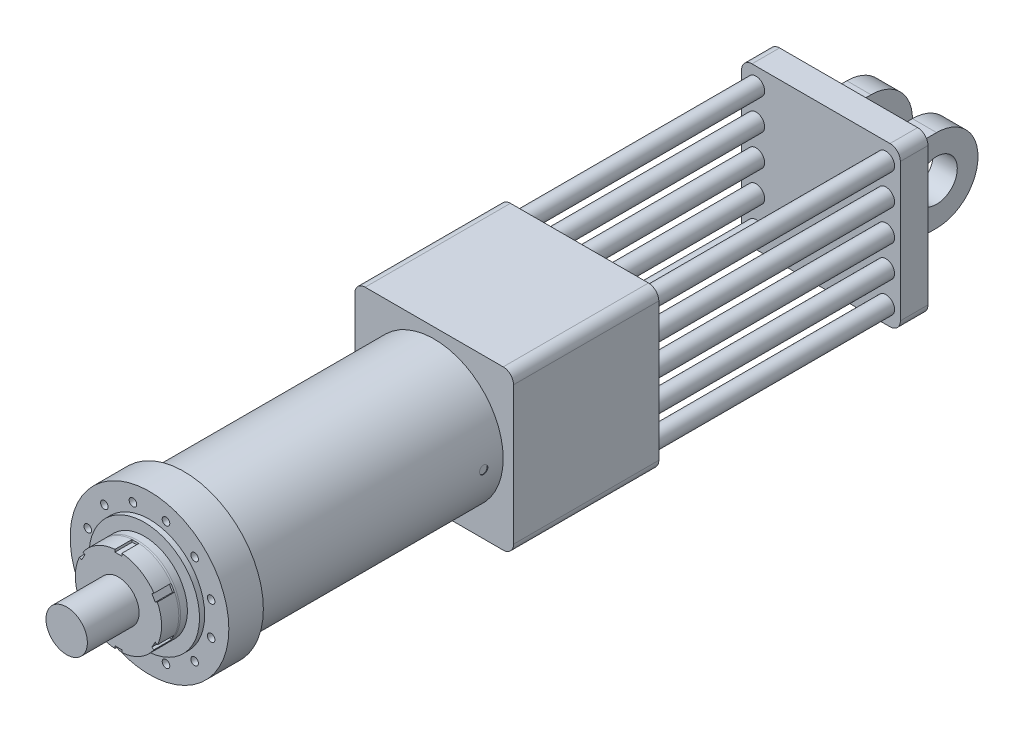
ISO-10303-21;
HEADER;
FILE_DESCRIPTION(('STEP AP214'),'2;1');
FILE_NAME('part.step','',(''),(''),'','','');
FILE_SCHEMA(('AUTOMOTIVE_DESIGN { 1 0 10303 214 1 1 1 1 }'));
ENDSEC;
DATA;
#1=APPLICATION_CONTEXT('core data for automotive mechanical design processes');
#2=APPLICATION_PROTOCOL_DEFINITION('international standard','automotive_design',2000,#1);
#3=PRODUCT_CONTEXT('',#1,'mechanical');
#4=PRODUCT('Part','Part','',(#3));
#5=PRODUCT_RELATED_PRODUCT_CATEGORY('part','',(#4));
#6=PRODUCT_DEFINITION_FORMATION('','',#4);
#7=PRODUCT_DEFINITION_CONTEXT('part definition',#1,'design');
#8=PRODUCT_DEFINITION('design','',#6,#7);
#9=PRODUCT_DEFINITION_SHAPE('','',#8);
#10=(LENGTH_UNIT() NAMED_UNIT(*) SI_UNIT(.MILLI.,.METRE.));
#11=(NAMED_UNIT(*) PLANE_ANGLE_UNIT() SI_UNIT($,.RADIAN.));
#12=(NAMED_UNIT(*) SI_UNIT($,.STERADIAN.) SOLID_ANGLE_UNIT());
#13=UNCERTAINTY_MEASURE_WITH_UNIT(LENGTH_MEASURE(1.E-05),#10,'distance_accuracy_value','');
#14=(GEOMETRIC_REPRESENTATION_CONTEXT(3) GLOBAL_UNCERTAINTY_ASSIGNED_CONTEXT((#13)) GLOBAL_UNIT_ASSIGNED_CONTEXT((#10,
#11,#12)) REPRESENTATION_CONTEXT('',''));
#15=CARTESIAN_POINT('',(0.,0.,0.));
#16=DIRECTION('',(0.,0.,1.));
#17=DIRECTION('',(1.,0.,0.));
#18=AXIS2_PLACEMENT_3D('',#15,#16,#17);
#19=CARTESIAN_POINT('',(0.,0.,-1201.));
#20=DIRECTION('',(0.,0.,-1.));
#21=DIRECTION('',(-1.,0.,0.));
#22=AXIS2_PLACEMENT_3D('',#19,#20,#21);
#23=PLANE('',#22);
#24=DIRECTION('',(1.,0.,0.));
#25=VECTOR('',#24,1.);
#26=CARTESIAN_POINT('',(0.,-140.,-1201.));
#27=LINE('',#26,#25);
#28=CARTESIAN_POINT('',(40.,-140.,-1201.));
#29=VERTEX_POINT('',#28);
#30=CARTESIAN_POINT('',(150.,-140.,-1201.));
#31=VERTEX_POINT('',#30);
#32=EDGE_CURVE('E1481',#29,#31,#27,.T.);
#33=ORIENTED_EDGE('',*,*,#32,.T.);
#34=DIRECTION('',(0.,1.,0.));
#35=VECTOR('',#34,1.);
#36=CARTESIAN_POINT('',(150.,0.,-1201.));
#37=LINE('',#36,#35);
#38=CARTESIAN_POINT('',(150.,140.,-1201.));
#39=VERTEX_POINT('',#38);
#40=EDGE_CURVE('E1484',#31,#39,#37,.T.);
#41=ORIENTED_EDGE('',*,*,#40,.T.);
#42=DIRECTION('',(-1.,0.,0.));
#43=VECTOR('',#42,1.);
#44=CARTESIAN_POINT('',(0.,140.,-1201.));
#45=LINE('',#44,#43);
#46=CARTESIAN_POINT('',(40.0000000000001,140.,-1201.));
#47=VERTEX_POINT('',#46);
#48=EDGE_CURVE('E1475',#39,#47,#45,.T.);
#49=ORIENTED_EDGE('',*,*,#48,.T.);
#50=DIRECTION('',(0.,-1.,0.));
#51=VECTOR('',#50,1.);
#52=CARTESIAN_POINT('',(40.,0.,-1201.));
#53=LINE('',#52,#51);
#54=EDGE_CURVE('E1478',#47,#29,#53,.T.);
#55=ORIENTED_EDGE('',*,*,#54,.T.);
#56=EDGE_LOOP('',(#33,#41,#49,#55));
#57=FACE_BOUND('',#56,.T.);
#58=DIRECTION('',(0.,-1.,0.));
#59=VECTOR('',#58,1.);
#60=CARTESIAN_POINT('',(230.,230.,-1201.));
#61=LINE('',#60,#59);
#62=CARTESIAN_POINT('',(230.,200.,-1201.));
#63=VERTEX_POINT('',#62);
#64=CARTESIAN_POINT('',(230.,-200.,-1201.));
#65=VERTEX_POINT('',#64);
#66=EDGE_CURVE('E456',#63,#65,#61,.T.);
#67=ORIENTED_EDGE('',*,*,#66,.T.);
#68=CARTESIAN_POINT('',(200.,-200.,-1201.));
#69=DIRECTION('',(0.,0.,-1.));
#70=DIRECTION('',(-1.,0.,0.));
#71=AXIS2_PLACEMENT_3D('',#68,#69,#70);
#72=CIRCLE('',#71,30.);
#73=CARTESIAN_POINT('',(200.,-230.,-1201.));
#74=VERTEX_POINT('',#73);
#75=EDGE_CURVE('E1397',#65,#74,#72,.T.);
#76=ORIENTED_EDGE('',*,*,#75,.T.);
#77=DIRECTION('',(-1.,0.,0.));
#78=VECTOR('',#77,1.);
#79=CARTESIAN_POINT('',(230.,-230.,-1201.));
#80=LINE('',#79,#78);
#81=CARTESIAN_POINT('',(-200.,-230.,-1201.));
#82=VERTEX_POINT('',#81);
#83=EDGE_CURVE('E460',#74,#82,#80,.T.);
#84=ORIENTED_EDGE('',*,*,#83,.T.);
#85=CARTESIAN_POINT('',(-200.,-200.,-1201.));
#86=DIRECTION('',(0.,0.,-1.));
#87=DIRECTION('',(-1.,0.,0.));
#88=AXIS2_PLACEMENT_3D('',#85,#86,#87);
#89=CIRCLE('',#88,30.);
#90=CARTESIAN_POINT('',(-230.,-200.,-1201.));
#91=VERTEX_POINT('',#90);
#92=EDGE_CURVE('E1391',#82,#91,#89,.T.);
#93=ORIENTED_EDGE('',*,*,#92,.T.);
#94=DIRECTION('',(0.,1.,0.));
#95=VECTOR('',#94,1.);
#96=CARTESIAN_POINT('',(-230.,230.,-1201.));
#97=LINE('',#96,#95);
#98=CARTESIAN_POINT('',(-230.,200.,-1201.));
#99=VERTEX_POINT('',#98);
#100=EDGE_CURVE('E447',#91,#99,#97,.T.);
#101=ORIENTED_EDGE('',*,*,#100,.T.);
#102=CARTESIAN_POINT('',(-200.,200.,-1201.));
#103=DIRECTION('',(0.,0.,-1.));
#104=DIRECTION('',(-1.,0.,0.));
#105=AXIS2_PLACEMENT_3D('',#102,#103,#104);
#106=CIRCLE('',#105,30.);
#107=CARTESIAN_POINT('',(-200.,230.,-1201.));
#108=VERTEX_POINT('',#107);
#109=EDGE_CURVE('E1388',#99,#108,#106,.T.);
#110=ORIENTED_EDGE('',*,*,#109,.T.);
#111=DIRECTION('',(1.,0.,0.));
#112=VECTOR('',#111,1.);
#113=CARTESIAN_POINT('',(230.,230.,-1201.));
#114=LINE('',#113,#112);
#115=CARTESIAN_POINT('',(200.,230.,-1201.));
#116=VERTEX_POINT('',#115);
#117=EDGE_CURVE('E451',#108,#116,#114,.T.);
#118=ORIENTED_EDGE('',*,*,#117,.T.);
#119=CARTESIAN_POINT('',(200.,200.,-1201.));
#120=DIRECTION('',(0.,0.,-1.));
#121=DIRECTION('',(-1.,0.,0.));
#122=AXIS2_PLACEMENT_3D('',#119,#120,#121);
#123=CIRCLE('',#122,30.);
#124=EDGE_CURVE('E1394',#116,#63,#123,.T.);
#125=ORIENTED_EDGE('',*,*,#124,.T.);
#126=EDGE_LOOP('',(#67,#76,#84,#93,#101,#110,#118,#125));
#127=FACE_BOUND('',#126,.T.);
#128=DIRECTION('',(1.,0.,0.));
#129=VECTOR('',#128,1.);
#130=CARTESIAN_POINT('',(0.,-140.,-1201.));
#131=LINE('',#130,#129);
#132=CARTESIAN_POINT('',(-150.,-140.,-1201.));
#133=VERTEX_POINT('',#132);
#134=CARTESIAN_POINT('',(-60.,-140.,-1201.));
#135=VERTEX_POINT('',#134);
#136=EDGE_CURVE('E1494',#133,#135,#131,.T.);
#137=ORIENTED_EDGE('',*,*,#136,.T.);
#138=DIRECTION('',(0.,-1.,0.));
#139=VECTOR('',#138,1.);
#140=CARTESIAN_POINT('',(-59.9999999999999,120.,-1201.));
#141=LINE('',#140,#139);
#142=CARTESIAN_POINT('',(-59.9999999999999,140.,-1201.));
#143=VERTEX_POINT('',#142);
#144=EDGE_CURVE('E1571',#143,#135,#141,.T.);
#145=ORIENTED_EDGE('',*,*,#144,.F.);
#146=DIRECTION('',(-1.,0.,0.));
#147=VECTOR('',#146,1.);
#148=CARTESIAN_POINT('',(0.,140.,-1201.));
#149=LINE('',#148,#147);
#150=CARTESIAN_POINT('',(-150.,140.,-1201.));
#151=VERTEX_POINT('',#150);
#152=EDGE_CURVE('E1488',#143,#151,#149,.T.);
#153=ORIENTED_EDGE('',*,*,#152,.T.);
#154=DIRECTION('',(0.,-1.,0.));
#155=VECTOR('',#154,1.);
#156=CARTESIAN_POINT('',(-150.,0.,-1201.));
#157=LINE('',#156,#155);
#158=EDGE_CURVE('E1491',#151,#133,#157,.T.);
#159=ORIENTED_EDGE('',*,*,#158,.T.);
#160=EDGE_LOOP('',(#137,#145,#153,#159));
#161=FACE_BOUND('',#160,.T.);
#162=ADVANCED_FACE('F39',(#57,#127,#161),#23,.T.);
#163=CARTESIAN_POINT('',(0.,0.,865.));
#164=DIRECTION('',(0.,0.,1.));
#165=DIRECTION('',(1.,0.,0.));
#166=AXIS2_PLACEMENT_3D('',#163,#164,#165);
#167=PLANE('',#166);
#168=DIRECTION('',(0.866025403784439,-0.5,0.));
#169=VECTOR('',#168,1.);
#170=CARTESIAN_POINT('',(112.906209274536,-53.6394249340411,865.));
#171=LINE('',#170,#169);
#172=CARTESIAN_POINT('',(106.757984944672,-50.0897459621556,865.));
#173=VERTEX_POINT('',#172);
#174=CARTESIAN_POINT('',(112.140218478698,-53.1971799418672,865.));
#175=VERTEX_POINT('',#174);
#176=EDGE_CURVE('E574',#173,#175,#171,.T.);
#177=ORIENTED_EDGE('',*,*,#176,.F.);
#178=DIRECTION('',(0.5,0.866025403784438,0.));
#179=VECTOR('',#178,1.);
#180=CARTESIAN_POINT('',(106.757984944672,-50.0897459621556,865.));
#181=LINE('',#180,#179);
#182=CARTESIAN_POINT('',(96.7579849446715,-67.4102540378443,865.));
#183=VERTEX_POINT('',#182);
#184=EDGE_CURVE('E736',#183,#173,#181,.T.);
#185=ORIENTED_EDGE('',*,*,#184,.F.);
#186=DIRECTION('',(-0.866025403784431,0.500000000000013,0.));
#187=VECTOR('',#186,1.);
#188=CARTESIAN_POINT('',(96.7579849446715,-67.4102540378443,865.));
#189=LINE('',#188,#187);
#190=CARTESIAN_POINT('',(102.140218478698,-70.5176880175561,865.));
#191=VERTEX_POINT('',#190);
#192=EDGE_CURVE('E568',#191,#183,#189,.T.);
#193=ORIENTED_EDGE('',*,*,#192,.F.);
#194=CARTESIAN_POINT('',(0.,0.,865.));
#195=DIRECTION('',(0.,0.,1.));
#196=DIRECTION('',(1.,0.,0.));
#197=AXIS2_PLACEMENT_3D('',#194,#195,#196);
#198=CIRCLE('',#197,124.118365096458);
#199=EDGE_CURVE('E1804',#191,#175,#198,.T.);
#200=ORIENTED_EDGE('',*,*,#199,.T.);
#201=EDGE_LOOP('',(#177,#185,#193,#200));
#202=FACE_BOUND('',#201,.T.);
#203=ADVANCED_FACE('F1073',(#202),#167,.T.);
#204=DIRECTION('',(0.,-1.,0.));
#205=VECTOR('',#204,1.);
#206=CARTESIAN_POINT('',(10.,-124.599357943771,865.));
#207=LINE('',#206,#205);
#208=CARTESIAN_POINT('',(10.,-117.5,865.));
#209=VERTEX_POINT('',#208);
#210=CARTESIAN_POINT('',(10.,-123.714867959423,865.));
#211=VERTEX_POINT('',#210);
#212=EDGE_CURVE('E725',#209,#211,#207,.T.);
#213=ORIENTED_EDGE('',*,*,#212,.F.);
#214=DIRECTION('',(1.,0.,0.));
#215=VECTOR('',#214,1.);
#216=CARTESIAN_POINT('',(10.,-117.5,865.));
#217=LINE('',#216,#215);
#218=CARTESIAN_POINT('',(-9.99999999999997,-117.5,865.));
#219=VERTEX_POINT('',#218);
#220=EDGE_CURVE('E719',#219,#209,#217,.T.);
#221=ORIENTED_EDGE('',*,*,#220,.F.);
#222=DIRECTION('',(0.,1.,0.));
#223=VECTOR('',#222,1.);
#224=CARTESIAN_POINT('',(-9.99999999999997,-117.5,865.));
#225=LINE('',#224,#223);
#226=CARTESIAN_POINT('',(-10.0000000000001,-123.714867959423,865.));
#227=VERTEX_POINT('',#226);
#228=EDGE_CURVE('E720',#227,#219,#225,.T.);
#229=ORIENTED_EDGE('',*,*,#228,.F.);
#230=EDGE_CURVE('E1860',#227,#211,#198,.T.);
#231=ORIENTED_EDGE('',*,*,#230,.T.);
#232=EDGE_LOOP('',(#213,#221,#229,#231));
#233=FACE_BOUND('',#232,.T.);
#234=ADVANCED_FACE('F1164',(#233),#167,.T.);
#235=DIRECTION('',(-0.866025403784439,-0.5,0.));
#236=VECTOR('',#235,1.);
#237=CARTESIAN_POINT('',(-102.906209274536,-70.95993300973,865.));
#238=LINE('',#237,#236);
#239=CARTESIAN_POINT('',(-96.7579849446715,-67.4102540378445,865.));
#240=VERTEX_POINT('',#239);
#241=CARTESIAN_POINT('',(-102.140218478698,-70.5176880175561,865.));
#242=VERTEX_POINT('',#241);
#243=EDGE_CURVE('E708',#240,#242,#238,.T.);
#244=ORIENTED_EDGE('',*,*,#243,.F.);
#245=DIRECTION('',(0.5,-0.866025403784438,0.));
#246=VECTOR('',#245,1.);
#247=CARTESIAN_POINT('',(-96.7579849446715,-67.4102540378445,865.));
#248=LINE('',#247,#246);
#249=CARTESIAN_POINT('',(-106.757984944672,-50.0897459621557,865.));
#250=VERTEX_POINT('',#249);
#251=EDGE_CURVE('E702',#250,#240,#248,.T.);
#252=ORIENTED_EDGE('',*,*,#251,.F.);
#253=DIRECTION('',(0.866025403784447,0.499999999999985,0.));
#254=VECTOR('',#253,1.);
#255=CARTESIAN_POINT('',(-106.757984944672,-50.0897459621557,865.));
#256=LINE('',#255,#254);
#257=CARTESIAN_POINT('',(-112.140218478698,-53.1971799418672,865.));
#258=VERTEX_POINT('',#257);
#259=EDGE_CURVE('E703',#258,#250,#256,.T.);
#260=ORIENTED_EDGE('',*,*,#259,.F.);
#261=EDGE_CURVE('E1867',#258,#242,#198,.T.);
#262=ORIENTED_EDGE('',*,*,#261,.T.);
#263=EDGE_LOOP('',(#244,#252,#260,#262));
#264=FACE_BOUND('',#263,.T.);
#265=ADVANCED_FACE('F1944',(#264),#167,.T.);
#266=DIRECTION('',(-0.86602540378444,0.499999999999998,0.));
#267=VECTOR('',#266,1.);
#268=CARTESIAN_POINT('',(-112.906209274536,53.6394249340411,865.));
#269=LINE('',#268,#267);
#270=CARTESIAN_POINT('',(-106.757984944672,50.0897459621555,865.));
#271=VERTEX_POINT('',#270);
#272=CARTESIAN_POINT('',(-112.140218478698,53.1971799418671,865.));
#273=VERTEX_POINT('',#272);
#274=EDGE_CURVE('E691',#271,#273,#269,.T.);
#275=ORIENTED_EDGE('',*,*,#274,.F.);
#276=DIRECTION('',(-0.500000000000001,-0.866025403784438,0.));
#277=VECTOR('',#276,1.);
#278=CARTESIAN_POINT('',(-106.757984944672,50.0897459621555,865.));
#279=LINE('',#278,#277);
#280=CARTESIAN_POINT('',(-96.7579849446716,67.4102540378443,865.));
#281=VERTEX_POINT('',#280);
#282=EDGE_CURVE('E685',#281,#271,#279,.T.);
#283=ORIENTED_EDGE('',*,*,#282,.F.);
#284=DIRECTION('',(0.866025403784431,-0.500000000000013,0.));
#285=VECTOR('',#284,1.);
#286=CARTESIAN_POINT('',(-96.7579849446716,67.4102540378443,865.));
#287=LINE('',#286,#285);
#288=CARTESIAN_POINT('',(-102.140218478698,70.517688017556,865.));
#289=VERTEX_POINT('',#288);
#290=EDGE_CURVE('E686',#289,#281,#287,.T.);
#291=ORIENTED_EDGE('',*,*,#290,.F.);
#292=EDGE_CURVE('E1878',#289,#273,#198,.T.);
#293=ORIENTED_EDGE('',*,*,#292,.T.);
#294=EDGE_LOOP('',(#275,#283,#291,#293));
#295=FACE_BOUND('',#294,.T.);
#296=ADVANCED_FACE('F1908',(#295),#167,.T.);
#297=DIRECTION('',(0.,1.,0.));
#298=VECTOR('',#297,1.);
#299=CARTESIAN_POINT('',(-10.,124.599357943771,865.));
#300=LINE('',#299,#298);
#301=CARTESIAN_POINT('',(-10.,117.5,865.));
#302=VERTEX_POINT('',#301);
#303=CARTESIAN_POINT('',(-10.,123.714867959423,865.));
#304=VERTEX_POINT('',#303);
#305=EDGE_CURVE('E674',#302,#304,#300,.T.);
#306=ORIENTED_EDGE('',*,*,#305,.F.);
#307=DIRECTION('',(-1.,0.,0.));
#308=VECTOR('',#307,1.);
#309=CARTESIAN_POINT('',(-10.,117.5,865.));
#310=LINE('',#309,#308);
#311=CARTESIAN_POINT('',(9.99999999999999,117.5,865.));
#312=VERTEX_POINT('',#311);
#313=EDGE_CURVE('E668',#312,#302,#310,.T.);
#314=ORIENTED_EDGE('',*,*,#313,.F.);
#315=DIRECTION('',(0.,-1.,0.));
#316=VECTOR('',#315,1.);
#317=CARTESIAN_POINT('',(9.99999999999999,117.5,865.));
#318=LINE('',#317,#316);
#319=CARTESIAN_POINT('',(9.99999999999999,123.714867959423,865.));
#320=VERTEX_POINT('',#319);
#321=EDGE_CURVE('E669',#320,#312,#318,.T.);
#322=ORIENTED_EDGE('',*,*,#321,.F.);
#323=EDGE_CURVE('E1889',#320,#304,#198,.T.);
#324=ORIENTED_EDGE('',*,*,#323,.T.);
#325=EDGE_LOOP('',(#306,#314,#322,#324));
#326=FACE_BOUND('',#325,.T.);
#327=ADVANCED_FACE('F1074',(#326),#167,.T.);
#328=CARTESIAN_POINT('',(0.,0.,725.));
#329=DIRECTION('',(0.,0.,-1.));
#330=DIRECTION('',(-1.,0.,0.));
#331=AXIS2_PLACEMENT_3D('',#328,#329,#330);
#332=CYLINDRICAL_SURFACE('',#331,200.);
#333=CARTESIAN_POINT('',(200.,0.,44.5));
#334=CARTESIAN_POINT('',(200.000000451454,-0.336818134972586,44.4999972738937));
#335=CARTESIAN_POINT('',(199.999147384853,-0.673592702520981,44.5141864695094));
#336=CARTESIAN_POINT('',(199.995759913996,-1.34485594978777,44.5708419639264));
#337=CARTESIAN_POINT('',(199.993225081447,-1.67934402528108,44.6133154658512));
#338=CARTESIAN_POINT('',(199.986541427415,-2.34388649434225,44.7263038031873));
#339=CARTESIAN_POINT('',(199.982390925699,-2.67393590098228,44.7968478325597));
#340=CARTESIAN_POINT('',(199.97259396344,-3.32690256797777,44.9654685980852));
#341=CARTESIAN_POINT('',(199.966947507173,-3.64981984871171,45.063545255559));
#342=CARTESIAN_POINT('',(199.95432206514,-4.28605714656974,45.2864689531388));
#343=CARTESIAN_POINT('',(199.947343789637,-4.59938217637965,45.411301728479));
#344=CARTESIAN_POINT('',(199.932250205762,-5.21439925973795,45.6868788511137));
#345=CARTESIAN_POINT('',(199.92413488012,-5.51609113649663,45.837623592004));
#346=CARTESIAN_POINT('',(199.906998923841,-6.10563167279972,46.1639107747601));
#347=CARTESIAN_POINT('',(199.897978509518,-6.39348361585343,46.3394472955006));
#348=CARTESIAN_POINT('',(199.879285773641,-6.95338726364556,46.7140984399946));
#349=CARTESIAN_POINT('',(199.869613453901,-7.22543901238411,46.9132129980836));
#350=CARTESIAN_POINT('',(199.84987810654,-7.75214646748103,47.3338690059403));
#351=CARTESIAN_POINT('',(199.839814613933,-8.00678041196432,47.555437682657));
#352=CARTESIAN_POINT('',(199.819593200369,-8.49648428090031,48.0192286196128));
#353=CARTESIAN_POINT('',(199.809435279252,-8.73155417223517,48.2614509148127));
#354=CARTESIAN_POINT('',(199.789312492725,-9.18047473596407,48.7648450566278));
#355=CARTESIAN_POINT('',(199.779347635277,-9.39432453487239,49.0260176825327));
#356=CARTESIAN_POINT('',(199.759894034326,-9.79927768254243,49.5654558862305));
#357=CARTESIAN_POINT('',(199.750405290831,-9.99038103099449,49.8437214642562));
#358=CARTESIAN_POINT('',(199.732166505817,-10.3486167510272,50.4155890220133));
#359=CARTESIAN_POINT('',(199.723417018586,-10.5157312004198,50.7092022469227));
#360=CARTESIAN_POINT('',(199.706913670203,-10.8246278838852,51.3094920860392));
#361=CARTESIAN_POINT('',(199.699159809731,-10.9664101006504,51.6161687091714));
#362=CARTESIAN_POINT('',(199.684868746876,-11.2236267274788,52.2404038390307));
#363=CARTESIAN_POINT('',(199.678331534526,-11.3390613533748,52.5579622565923));
#364=CARTESIAN_POINT('',(199.666660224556,-11.5427558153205,53.2017032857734));
#365=CARTESIAN_POINT('',(199.661526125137,-11.631015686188,53.5278858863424));
#366=CARTESIAN_POINT('',(199.652812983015,-11.7796353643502,54.1861499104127));
#367=CARTESIAN_POINT('',(199.649232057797,-11.8400289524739,54.5182236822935));
#368=CARTESIAN_POINT('',(199.643718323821,-11.9326397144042,55.1862908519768));
#369=CARTESIAN_POINT('',(199.641785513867,-11.9648569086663,55.5222842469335));
#370=CARTESIAN_POINT('',(199.639623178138,-12.0008826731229,56.1957928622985));
#371=CARTESIAN_POINT('',(199.639393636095,-12.0046915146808,56.5333080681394));
#372=CARTESIAN_POINT('',(199.640644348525,-11.9838738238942,57.207457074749));
#373=CARTESIAN_POINT('',(199.642124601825,-11.9592473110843,57.5440908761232));
#374=CARTESIAN_POINT('',(199.646749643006,-11.881786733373,58.2136429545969));
#375=CARTESIAN_POINT('',(199.649892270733,-11.8289892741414,58.5465654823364));
#376=CARTESIAN_POINT('',(199.657751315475,-11.6955888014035,59.2067729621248));
#377=CARTESIAN_POINT('',(199.662467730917,-11.6149858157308,59.5340579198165));
#378=CARTESIAN_POINT('',(199.673340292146,-11.4265512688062,60.1806698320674));
#379=CARTESIAN_POINT('',(199.679496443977,-11.3187195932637,60.4999967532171));
#380=CARTESIAN_POINT('',(199.693073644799,-11.0765982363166,61.1284294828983));
#381=CARTESIAN_POINT('',(199.700494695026,-10.9423085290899,61.4375352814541));
#382=CARTESIAN_POINT('',(199.716396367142,-10.6481322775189,62.0435365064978));
#383=CARTESIAN_POINT('',(199.724877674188,-10.4882291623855,62.340423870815));
#384=CARTESIAN_POINT('',(199.742655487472,-10.1440259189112,62.9196760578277));
#385=CARTESIAN_POINT('',(199.75195199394,-9.95972578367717,63.2020408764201));
#386=CARTESIAN_POINT('',(199.771096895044,-9.5680341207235,63.7502561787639));
#387=CARTESIAN_POINT('',(199.780945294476,-9.36064239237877,64.0161065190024));
#388=CARTESIAN_POINT('',(199.800915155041,-8.92423659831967,64.529413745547));
#389=CARTESIAN_POINT('',(199.811036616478,-8.69522250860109,64.7768706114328));
#390=CARTESIAN_POINT('',(199.831282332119,-8.2168118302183,65.2520193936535));
#391=CARTESIAN_POINT('',(199.841406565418,-7.96738357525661,65.4796794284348));
#392=CARTESIAN_POINT('',(199.861354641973,-7.45022594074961,65.9131810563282));
#393=CARTESIAN_POINT('',(199.871178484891,-7.18249654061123,66.1190226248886));
#394=CARTESIAN_POINT('',(199.890247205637,-6.63063236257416,66.5074255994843));
#395=CARTESIAN_POINT('',(199.899492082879,-6.34649756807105,66.6899869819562));
#396=CARTESIAN_POINT('',(199.917140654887,-5.76383629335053,67.0305297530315));
#397=CARTESIAN_POINT('',(199.92554435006,-5.46530982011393,67.1885111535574));
#398=CARTESIAN_POINT('',(199.94127250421,-4.85596814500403,67.4787734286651));
#399=CARTESIAN_POINT('',(199.94859691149,-4.54515235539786,67.6110530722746));
#400=CARTESIAN_POINT('',(199.961958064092,-3.91345386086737,67.8489554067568));
#401=CARTESIAN_POINT('',(199.967994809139,-3.5925711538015,67.9545780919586));
#402=CARTESIAN_POINT('',(199.978609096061,-2.94302558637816,68.138407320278));
#403=CARTESIAN_POINT('',(199.983186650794,-2.61436279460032,68.2166141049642));
#404=CARTESIAN_POINT('',(199.990752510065,-1.95159736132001,68.3450498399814));
#405=CARTESIAN_POINT('',(199.993740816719,-1.61749472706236,68.3952788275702));
#406=CARTESIAN_POINT('',(199.998039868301,-0.946756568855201,68.467340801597));
#407=CARTESIAN_POINT('',(199.999353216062,-0.610125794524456,68.489217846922));
#408=CARTESIAN_POINT('',(200.000273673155,0.0637847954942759,68.5045628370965));
#409=CARTESIAN_POINT('',(199.999880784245,0.40106461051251,68.4980308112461));
#410=CARTESIAN_POINT('',(199.997399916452,1.07386998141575,68.4566048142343));
#411=CARTESIAN_POINT('',(199.995311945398,1.4093955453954,68.4217109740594));
#412=CARTESIAN_POINT('',(199.98950012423,2.07630576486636,68.3238125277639));
#413=CARTESIAN_POINT('',(199.985776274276,2.4076904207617,68.2608079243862));
#414=CARTESIAN_POINT('',(199.976801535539,3.06372180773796,68.1071968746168));
#415=CARTESIAN_POINT('',(199.971551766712,3.38837329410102,68.0166106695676));
#416=CARTESIAN_POINT('',(199.959672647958,4.02888618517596,67.8084689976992));
#417=CARTESIAN_POINT('',(199.953043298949,4.34474759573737,67.6909135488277));
#418=CARTESIAN_POINT('',(199.938592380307,4.96544648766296,67.4296715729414));
#419=CARTESIAN_POINT('',(199.930770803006,5.27028389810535,67.2859848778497));
#420=CARTESIAN_POINT('',(199.914156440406,5.86677844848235,66.973503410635));
#421=CARTESIAN_POINT('',(199.905363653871,6.15843557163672,66.8047086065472));
#422=CARTESIAN_POINT('',(199.887043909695,6.72686049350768,66.4429862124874));
#423=CARTESIAN_POINT('',(199.877516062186,7.00360953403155,66.2500291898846));
#424=CARTESIAN_POINT('',(199.85800533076,7.53987480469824,65.8415150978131));
#425=CARTESIAN_POINT('',(199.84802244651,7.79939102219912,65.6259580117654));
#426=CARTESIAN_POINT('',(199.827884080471,8.29935868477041,65.1737683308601));
#427=CARTESIAN_POINT('',(199.817728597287,8.53980997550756,64.9371355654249));
#428=CARTESIAN_POINT('',(199.797532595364,8.99994549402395,64.4444693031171));
#429=CARTESIAN_POINT('',(199.787492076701,9.21962970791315,64.1884357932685));
#430=CARTESIAN_POINT('',(199.767797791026,9.63694312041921,63.6584379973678));
#431=CARTESIAN_POINT('',(199.758144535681,9.83454371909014,63.3844511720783));
#432=CARTESIAN_POINT('',(199.739512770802,10.205960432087,62.8207823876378));
#433=CARTESIAN_POINT('',(199.730534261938,10.3797765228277,62.5311004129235));
#434=CARTESIAN_POINT('',(199.713507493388,10.7023843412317,61.9380971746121));
#435=CARTESIAN_POINT('',(199.70545922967,10.8511761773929,61.6347759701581));
#436=CARTESIAN_POINT('',(199.690522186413,11.1226725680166,61.0166473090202));
#437=CARTESIAN_POINT('',(199.683633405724,11.245377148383,60.7018398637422));
#438=CARTESIAN_POINT('',(199.671215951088,11.463746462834,60.0631910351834));
#439=CARTESIAN_POINT('',(199.665686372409,11.5594291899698,59.7393558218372));
#440=CARTESIAN_POINT('',(199.656139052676,11.7231767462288,59.0847544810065));
#441=CARTESIAN_POINT('',(199.652121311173,11.7912415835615,58.7539883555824));
#442=CARTESIAN_POINT('',(199.645712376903,11.8992631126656,58.0878845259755));
#443=CARTESIAN_POINT('',(199.643321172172,11.9392200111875,57.7525468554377));
#444=CARTESIAN_POINT('',(199.640233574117,11.99073839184,57.079689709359));
#445=CARTESIAN_POINT('',(199.639537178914,12.0022999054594,56.7421702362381));
#446=CARTESIAN_POINT('',(199.639858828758,11.9969484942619,56.0678915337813));
#447=CARTESIAN_POINT('',(199.640874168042,11.9800805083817,55.731131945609));
#448=CARTESIAN_POINT('',(199.644585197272,11.9180771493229,55.0602348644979));
#449=CARTESIAN_POINT('',(199.647280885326,11.8729418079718,54.7260973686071));
#450=CARTESIAN_POINT('',(199.654275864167,11.754727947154,54.0628194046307));
#451=CARTESIAN_POINT('',(199.658575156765,11.6816493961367,53.7336789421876));
#452=CARTESIAN_POINT('',(199.668655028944,11.5080731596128,53.0827324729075));
#453=CARTESIAN_POINT('',(199.674435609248,11.4075754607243,52.7609264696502));
#454=CARTESIAN_POINT('',(199.687313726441,11.1798805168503,52.1269324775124));
#455=CARTESIAN_POINT('',(199.694411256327,11.0526834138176,51.814744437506));
#456=CARTESIAN_POINT('',(199.709721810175,10.7724967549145,51.2021943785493));
#457=CARTESIAN_POINT('',(199.71793483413,10.6195071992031,50.901832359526));
#458=CARTESIAN_POINT('',(199.735243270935,10.2888285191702,50.3150654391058));
#459=CARTESIAN_POINT('',(199.744338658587,10.1111401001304,50.028660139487));
#460=CARTESIAN_POINT('',(199.763154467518,9.73232068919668,49.4718189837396));
#461=CARTESIAN_POINT('',(199.772874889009,9.53118968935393,49.201383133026));
#462=CARTESIAN_POINT('',(199.792680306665,9.10659722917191,48.678005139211));
#463=CARTESIAN_POINT('',(199.802765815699,8.88310351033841,48.4250891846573));
#464=CARTESIAN_POINT('',(199.823002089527,8.41561396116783,47.9389745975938));
#465=CARTESIAN_POINT('',(199.833152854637,8.17161803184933,47.7057760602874));
#466=CARTESIAN_POINT('',(199.853234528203,7.66478752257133,47.2606924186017));
#467=CARTESIAN_POINT('',(199.863165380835,7.40194822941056,47.0488126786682));
#468=CARTESIAN_POINT('',(199.882523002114,6.8593497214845,46.6479393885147));
#469=CARTESIAN_POINT('',(199.891949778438,6.57959076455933,46.4589454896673));
#470=CARTESIAN_POINT('',(199.910042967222,6.00478830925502,46.1049735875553));
#471=CARTESIAN_POINT('',(199.918708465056,5.7097270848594,45.9400243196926));
#472=CARTESIAN_POINT('',(199.935020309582,5.10672265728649,45.6355873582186));
#473=CARTESIAN_POINT('',(199.942666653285,4.79877941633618,45.4960997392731));
#474=CARTESIAN_POINT('',(199.95671533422,4.17252410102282,45.243718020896));
#475=CARTESIAN_POINT('',(199.96311897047,3.85422326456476,45.1307961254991));
#476=CARTESIAN_POINT('',(199.974509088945,3.20932132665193,44.9321958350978));
#477=CARTESIAN_POINT('',(199.979495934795,2.88272237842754,44.8465104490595));
#478=CARTESIAN_POINT('',(199.989051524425,2.13414018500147,44.6835216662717));
#479=CARTESIAN_POINT('',(199.99314188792,1.71026312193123,44.6147621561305));
#480=CARTESIAN_POINT('',(199.998615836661,0.857567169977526,44.5230030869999));
#481=CARTESIAN_POINT('',(199.999999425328,0.428748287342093,44.5000034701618));
#482=CARTESIAN_POINT('',(200.,0.,44.5));
#483=B_SPLINE_CURVE_WITH_KNOTS('',3,(#333,#334,#335,#336,#337,#338,#339,#340,#341,#342,#343,
#344,#345,#346,#347,#348,#349,#350,#351,#352,#353,#354,#355,#356,#357,#358,#359,#360,#361,#362,
#363,#364,#365,#366,#367,#368,#369,#370,#371,#372,#373,#374,#375,#376,#377,#378,#379,#380,#381,
#382,#383,#384,#385,#386,#387,#388,#389,#390,#391,#392,#393,#394,#395,#396,#397,#398,#399,#400,
#401,#402,#403,#404,#405,#406,#407,#408,#409,#410,#411,#412,#413,#414,#415,#416,#417,#418,#419,
#420,#421,#422,#423,#424,#425,#426,#427,#428,#429,#430,#431,#432,#433,#434,#435,#436,#437,#438,
#439,#440,#441,#442,#443,#444,#445,#446,#447,#448,#449,#450,#451,#452,#453,#454,#455,#456,#457,
#458,#459,#460,#461,#462,#463,#464,#465,#466,#467,#468,#469,#470,#471,#472,#473,#474,#475,#476,
#477,#478,#479,#480,#481,#482),.UNSPECIFIED.,.T.,.F.,(4,2,2,2,2,2,2,2,2,2,2,2,2,2,2,2,2,2,2,2,2,
2,2,2,2,2,2,2,2,2,2,2,2,2,2,2,2,2,2,2,2,2,2,2,2,2,2,2,2,2,2,2,2,2,2,2,2,2,2,2,2,2,2,2,2,2,2,2,2,
2,2,2,2,2,4),(0.,1.01007974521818,2.02041682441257,3.03180743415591,4.04319515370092,
5.0540449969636,6.06491019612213,7.07553437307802,8.08615573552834,9.09801754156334,
10.1098810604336,11.1217862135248,12.1336913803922,13.1463486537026,14.1590066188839,
15.171656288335,16.1843046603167,17.1957222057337,18.207139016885,19.2185461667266,
20.2299526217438,21.2400480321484,22.250142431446,23.2602410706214,24.2703406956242,
25.2810964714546,26.2918525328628,27.3026173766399,28.3133833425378,29.3257480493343,
30.3381138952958,31.350480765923,32.3628471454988,33.3752619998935,34.3876770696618,
35.4000832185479,36.4124880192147,37.4233176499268,38.4341462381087,39.444970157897,
40.4557939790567,41.4658777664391,42.4759608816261,43.4860504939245,44.4961413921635,
45.5074749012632,46.5188091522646,47.5301515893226,48.5414947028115,49.5541327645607,
50.566771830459,51.5794065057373,52.5920401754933,53.6039979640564,54.6159554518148,
55.6279054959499,56.6398544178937,57.650205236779,58.6605549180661,59.6709057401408,
60.6812570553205,61.6916029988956,62.7019489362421,63.7122660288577,64.7225834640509,
65.7343799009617,66.7461812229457,67.75823651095,68.7702763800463,69.7835159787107,
70.7967585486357,71.8089361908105,72.8208538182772,74.1066233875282,75.3923913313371),.UNSPECIFIED.);
#484=CARTESIAN_POINT('',(200.,0.,44.5));
#485=VERTEX_POINT('',#484);
#486=EDGE_CURVE('E1356',#485,#485,#483,.T.);
#487=ORIENTED_EDGE('',*,*,#486,.T.);
#488=EDGE_LOOP('',(#487));
#489=FACE_BOUND('',#488,.T.);
#490=CARTESIAN_POINT('',(0.,0.,725.));
#491=DIRECTION('',(0.,0.,1.));
#492=DIRECTION('',(1.,0.,0.));
#493=AXIS2_PLACEMENT_3D('',#490,#491,#492);
#494=CIRCLE('',#493,200.);
#495=CARTESIAN_POINT('',(200.,0.,725.));
#496=VERTEX_POINT('',#495);
#497=EDGE_CURVE('E898',#496,#496,#494,.T.);
#498=ORIENTED_EDGE('',*,*,#497,.F.);
#499=EDGE_LOOP('',(#498));
#500=FACE_BOUND('',#499,.T.);
#501=CARTESIAN_POINT('',(0.,0.,0.));
#502=DIRECTION('',(0.,0.,1.));
#503=DIRECTION('',(1.,0.,0.));
#504=AXIS2_PLACEMENT_3D('',#501,#502,#503);
#505=CIRCLE('',#504,200.);
#506=CARTESIAN_POINT('',(200.,0.,0.));
#507=VERTEX_POINT('',#506);
#508=EDGE_CURVE('E869',#507,#507,#505,.T.);
#509=ORIENTED_EDGE('',*,*,#508,.T.);
#510=EDGE_LOOP('',(#509));
#511=FACE_BOUND('',#510,.T.);
#512=CARTESIAN_POINT('',(-200.,0.,682.5));
#513=CARTESIAN_POINT('',(-200.000000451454,0.336818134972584,682.500002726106));
#514=CARTESIAN_POINT('',(-199.999147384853,0.673592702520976,682.485813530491));
#515=CARTESIAN_POINT('',(-199.995759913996,1.34485594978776,682.429158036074));
#516=CARTESIAN_POINT('',(-199.993225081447,1.67934402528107,682.386684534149));
#517=CARTESIAN_POINT('',(-199.986541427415,2.34388649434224,682.273696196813));
#518=CARTESIAN_POINT('',(-199.982390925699,2.67393590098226,682.20315216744));
#519=CARTESIAN_POINT('',(-199.97259396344,3.32690256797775,682.034531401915));
#520=CARTESIAN_POINT('',(-199.966947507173,3.64981984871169,681.936454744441));
#521=CARTESIAN_POINT('',(-199.95432206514,4.28605714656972,681.713531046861));
#522=CARTESIAN_POINT('',(-199.947343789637,4.59938217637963,681.588698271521));
#523=CARTESIAN_POINT('',(-199.932250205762,5.21439925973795,681.313121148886));
#524=CARTESIAN_POINT('',(-199.92413488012,5.51609113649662,681.162376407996));
#525=CARTESIAN_POINT('',(-199.906998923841,6.10563167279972,680.83608922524));
#526=CARTESIAN_POINT('',(-199.897978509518,6.39348361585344,680.660552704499));
#527=CARTESIAN_POINT('',(-199.879285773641,6.95338726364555,680.285901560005));
#528=CARTESIAN_POINT('',(-199.869613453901,7.22543901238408,680.086787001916));
#529=CARTESIAN_POINT('',(-199.84987810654,7.752146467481,679.66613099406));
#530=CARTESIAN_POINT('',(-199.839814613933,8.00678041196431,679.444562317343));
#531=CARTESIAN_POINT('',(-199.819593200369,8.49648428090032,678.980771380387));
#532=CARTESIAN_POINT('',(-199.809435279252,8.73155417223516,678.738549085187));
#533=CARTESIAN_POINT('',(-199.789312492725,9.18047473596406,678.235154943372));
#534=CARTESIAN_POINT('',(-199.779347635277,9.39432453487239,677.973982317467));
#535=CARTESIAN_POINT('',(-199.759894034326,9.79927768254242,677.434544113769));
#536=CARTESIAN_POINT('',(-199.750405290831,9.99038103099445,677.156278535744));
#537=CARTESIAN_POINT('',(-199.732166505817,10.3486167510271,676.584410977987));
#538=CARTESIAN_POINT('',(-199.723417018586,10.5157312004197,676.290797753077));
#539=CARTESIAN_POINT('',(-199.706913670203,10.8246278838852,675.690507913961));
#540=CARTESIAN_POINT('',(-199.699159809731,10.9664101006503,675.383831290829));
#541=CARTESIAN_POINT('',(-199.684868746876,11.2236267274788,674.759596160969));
#542=CARTESIAN_POINT('',(-199.678331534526,11.3390613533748,674.442037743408));
#543=CARTESIAN_POINT('',(-199.666660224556,11.5427558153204,673.798296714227));
#544=CARTESIAN_POINT('',(-199.661526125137,11.631015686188,673.472114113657));
#545=CARTESIAN_POINT('',(-199.652812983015,11.7796353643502,672.813850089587));
#546=CARTESIAN_POINT('',(-199.649232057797,11.8400289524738,672.481776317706));
#547=CARTESIAN_POINT('',(-199.643718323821,11.9326397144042,671.813709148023));
#548=CARTESIAN_POINT('',(-199.641785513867,11.9648569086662,671.477715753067));
#549=CARTESIAN_POINT('',(-199.639623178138,12.0008826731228,670.804207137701));
#550=CARTESIAN_POINT('',(-199.639393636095,12.0046915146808,670.466691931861));
#551=CARTESIAN_POINT('',(-199.640644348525,11.9838738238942,669.792542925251));
#552=CARTESIAN_POINT('',(-199.642124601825,11.9592473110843,669.455909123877));
#553=CARTESIAN_POINT('',(-199.646749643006,11.881786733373,668.786357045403));
#554=CARTESIAN_POINT('',(-199.649892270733,11.8289892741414,668.453434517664));
#555=CARTESIAN_POINT('',(-199.657751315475,11.6955888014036,667.793227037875));
#556=CARTESIAN_POINT('',(-199.662467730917,11.6149858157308,667.465942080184));
#557=CARTESIAN_POINT('',(-199.673340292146,11.4265512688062,666.819330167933));
#558=CARTESIAN_POINT('',(-199.679496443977,11.3187195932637,666.500003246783));
#559=CARTESIAN_POINT('',(-199.693073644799,11.0765982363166,665.871570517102));
#560=CARTESIAN_POINT('',(-199.700494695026,10.9423085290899,665.562464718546));
#561=CARTESIAN_POINT('',(-199.716396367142,10.6481322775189,664.956463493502));
#562=CARTESIAN_POINT('',(-199.724877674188,10.4882291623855,664.659576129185));
#563=CARTESIAN_POINT('',(-199.742655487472,10.1440259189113,664.080323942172));
#564=CARTESIAN_POINT('',(-199.75195199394,9.95972578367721,663.79795912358));
#565=CARTESIAN_POINT('',(-199.771096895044,9.56803412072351,663.249743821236));
#566=CARTESIAN_POINT('',(-199.780945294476,9.36064239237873,662.983893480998));
#567=CARTESIAN_POINT('',(-199.800915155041,8.9242365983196,662.470586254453));
#568=CARTESIAN_POINT('',(-199.811036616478,8.69522250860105,662.223129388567));
#569=CARTESIAN_POINT('',(-199.831282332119,8.21681183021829,661.747980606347));
#570=CARTESIAN_POINT('',(-199.841406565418,7.96738357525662,661.520320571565));
#571=CARTESIAN_POINT('',(-199.861354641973,7.45022594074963,661.086818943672));
#572=CARTESIAN_POINT('',(-199.871178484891,7.18249654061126,660.880977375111));
#573=CARTESIAN_POINT('',(-199.890247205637,6.6306323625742,660.492574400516));
#574=CARTESIAN_POINT('',(-199.899492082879,6.34649756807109,660.310013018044));
#575=CARTESIAN_POINT('',(-199.917140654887,5.76383629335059,659.969470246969));
#576=CARTESIAN_POINT('',(-199.92554435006,5.46530982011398,659.811488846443));
#577=CARTESIAN_POINT('',(-199.94127250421,4.85596814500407,659.521226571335));
#578=CARTESIAN_POINT('',(-199.94859691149,4.54515235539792,659.388946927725));
#579=CARTESIAN_POINT('',(-199.961958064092,3.91345386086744,659.151044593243));
#580=CARTESIAN_POINT('',(-199.967994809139,3.59257115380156,659.045421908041));
#581=CARTESIAN_POINT('',(-199.978609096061,2.9430255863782,658.861592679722));
#582=CARTESIAN_POINT('',(-199.983186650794,2.61436279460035,658.783385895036));
#583=CARTESIAN_POINT('',(-199.990752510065,1.95159736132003,658.654950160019));
#584=CARTESIAN_POINT('',(-199.993740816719,1.61749472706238,658.60472117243));
#585=CARTESIAN_POINT('',(-199.998039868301,0.946756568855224,658.532659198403));
#586=CARTESIAN_POINT('',(-199.999353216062,0.610125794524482,658.510782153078));
#587=CARTESIAN_POINT('',(-200.000273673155,-0.0637847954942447,658.495437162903));
#588=CARTESIAN_POINT('',(-199.999880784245,-0.401064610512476,658.501969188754));
#589=CARTESIAN_POINT('',(-199.997399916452,-1.07386998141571,658.543395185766));
#590=CARTESIAN_POINT('',(-199.995311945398,-1.40939554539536,658.578289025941));
#591=CARTESIAN_POINT('',(-199.98950012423,-2.07630576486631,658.676187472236));
#592=CARTESIAN_POINT('',(-199.985776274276,-2.40769042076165,658.739192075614));
#593=CARTESIAN_POINT('',(-199.976801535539,-3.06372180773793,658.892803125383));
#594=CARTESIAN_POINT('',(-199.971551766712,-3.38837329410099,658.983389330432));
#595=CARTESIAN_POINT('',(-199.959672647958,-4.02888618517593,659.191531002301));
#596=CARTESIAN_POINT('',(-199.953043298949,-4.34474759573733,659.309086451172));
#597=CARTESIAN_POINT('',(-199.938592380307,-4.96544648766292,659.570328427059));
#598=CARTESIAN_POINT('',(-199.930770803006,-5.27028389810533,659.71401512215));
#599=CARTESIAN_POINT('',(-199.914156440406,-5.86677844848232,660.026496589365));
#600=CARTESIAN_POINT('',(-199.905363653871,-6.15843557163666,660.195291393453));
#601=CARTESIAN_POINT('',(-199.887043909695,-6.7268604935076,660.557013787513));
#602=CARTESIAN_POINT('',(-199.877516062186,-7.00360953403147,660.749970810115));
#603=CARTESIAN_POINT('',(-199.85800533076,-7.53987480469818,661.158484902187));
#604=CARTESIAN_POINT('',(-199.84802244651,-7.79939102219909,661.374041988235));
#605=CARTESIAN_POINT('',(-199.827884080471,-8.29935868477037,661.82623166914));
#606=CARTESIAN_POINT('',(-199.817728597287,-8.53980997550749,662.062864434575));
#607=CARTESIAN_POINT('',(-199.797532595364,-8.9999454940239,662.555530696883));
#608=CARTESIAN_POINT('',(-199.787492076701,-9.21962970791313,662.811564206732));
#609=CARTESIAN_POINT('',(-199.767797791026,-9.63694312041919,663.341562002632));
#610=CARTESIAN_POINT('',(-199.758144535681,-9.8345437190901,663.615548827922));
#611=CARTESIAN_POINT('',(-199.739512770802,-10.205960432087,664.179217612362));
#612=CARTESIAN_POINT('',(-199.730534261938,-10.3797765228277,664.468899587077));
#613=CARTESIAN_POINT('',(-199.713507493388,-10.7023843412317,665.061902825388));
#614=CARTESIAN_POINT('',(-199.70545922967,-10.8511761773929,665.365224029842));
#615=CARTESIAN_POINT('',(-199.690522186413,-11.1226725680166,665.98335269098));
#616=CARTESIAN_POINT('',(-199.683633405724,-11.245377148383,666.298160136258));
#617=CARTESIAN_POINT('',(-199.671215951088,-11.4637464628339,666.936808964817));
#618=CARTESIAN_POINT('',(-199.665686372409,-11.5594291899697,667.260644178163));
#619=CARTESIAN_POINT('',(-199.656139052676,-11.7231767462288,667.915245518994));
#620=CARTESIAN_POINT('',(-199.652121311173,-11.7912415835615,668.246011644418));
#621=CARTESIAN_POINT('',(-199.645712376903,-11.8992631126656,668.912115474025));
#622=CARTESIAN_POINT('',(-199.643321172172,-11.9392200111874,669.247453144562));
#623=CARTESIAN_POINT('',(-199.640233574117,-11.99073839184,669.920310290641));
#624=CARTESIAN_POINT('',(-199.639537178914,-12.0022999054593,670.257829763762));
#625=CARTESIAN_POINT('',(-199.639858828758,-11.9969484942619,670.932108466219));
#626=CARTESIAN_POINT('',(-199.640874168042,-11.9800805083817,671.268868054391));
#627=CARTESIAN_POINT('',(-199.644585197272,-11.9180771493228,671.939765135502));
#628=CARTESIAN_POINT('',(-199.647280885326,-11.8729418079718,672.273902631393));
#629=CARTESIAN_POINT('',(-199.654275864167,-11.754727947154,672.937180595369));
#630=CARTESIAN_POINT('',(-199.658575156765,-11.6816493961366,673.266321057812));
#631=CARTESIAN_POINT('',(-199.668655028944,-11.5080731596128,673.917267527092));
#632=CARTESIAN_POINT('',(-199.674435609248,-11.4075754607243,674.23907353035));
#633=CARTESIAN_POINT('',(-199.687313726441,-11.1798805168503,674.873067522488));
#634=CARTESIAN_POINT('',(-199.694411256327,-11.0526834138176,675.185255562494));
#635=CARTESIAN_POINT('',(-199.709721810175,-10.7724967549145,675.797805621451));
#636=CARTESIAN_POINT('',(-199.71793483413,-10.6195071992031,676.098167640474));
#637=CARTESIAN_POINT('',(-199.735243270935,-10.2888285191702,676.684934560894));
#638=CARTESIAN_POINT('',(-199.744338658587,-10.1111401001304,676.971339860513));
#639=CARTESIAN_POINT('',(-199.763154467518,-9.73232068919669,677.52818101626));
#640=CARTESIAN_POINT('',(-199.772874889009,-9.53118968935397,677.798616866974));
#641=CARTESIAN_POINT('',(-199.792680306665,-9.10659722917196,678.321994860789));
#642=CARTESIAN_POINT('',(-199.802765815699,-8.88310351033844,678.574910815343));
#643=CARTESIAN_POINT('',(-199.823002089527,-8.41561396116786,679.061025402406));
#644=CARTESIAN_POINT('',(-199.833152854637,-8.17161803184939,679.294223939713));
#645=CARTESIAN_POINT('',(-199.853234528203,-7.66478752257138,679.739307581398));
#646=CARTESIAN_POINT('',(-199.863165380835,-7.40194822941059,679.951187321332));
#647=CARTESIAN_POINT('',(-199.882523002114,-6.8593497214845,680.352060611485));
#648=CARTESIAN_POINT('',(-199.891949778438,-6.57959076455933,680.541054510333));
#649=CARTESIAN_POINT('',(-199.910042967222,-6.00478830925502,680.895026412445));
#650=CARTESIAN_POINT('',(-199.918708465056,-5.7097270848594,681.059975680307));
#651=CARTESIAN_POINT('',(-199.935020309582,-5.10672265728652,681.364412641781));
#652=CARTESIAN_POINT('',(-199.942666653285,-4.79877941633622,681.503900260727));
#653=CARTESIAN_POINT('',(-199.95671533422,-4.17252410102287,681.756281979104));
#654=CARTESIAN_POINT('',(-199.96311897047,-3.85422326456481,681.869203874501));
#655=CARTESIAN_POINT('',(-199.974509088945,-3.20932132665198,682.067804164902));
#656=CARTESIAN_POINT('',(-199.979495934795,-2.8827223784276,682.15348955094));
#657=CARTESIAN_POINT('',(-199.989051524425,-2.13414018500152,682.316478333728));
#658=CARTESIAN_POINT('',(-199.99314188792,-1.71026312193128,682.38523784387));
#659=CARTESIAN_POINT('',(-199.998615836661,-0.857567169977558,682.476996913));
#660=CARTESIAN_POINT('',(-199.999999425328,-0.428748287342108,682.499996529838));
#661=CARTESIAN_POINT('',(-200.,0.,682.5));
#662=B_SPLINE_CURVE_WITH_KNOTS('',3,(#512,#513,#514,#515,#516,#517,#518,#519,#520,#521,#522,
#523,#524,#525,#526,#527,#528,#529,#530,#531,#532,#533,#534,#535,#536,#537,#538,#539,#540,#541,
#542,#543,#544,#545,#546,#547,#548,#549,#550,#551,#552,#553,#554,#555,#556,#557,#558,#559,#560,
#561,#562,#563,#564,#565,#566,#567,#568,#569,#570,#571,#572,#573,#574,#575,#576,#577,#578,#579,
#580,#581,#582,#583,#584,#585,#586,#587,#588,#589,#590,#591,#592,#593,#594,#595,#596,#597,#598,
#599,#600,#601,#602,#603,#604,#605,#606,#607,#608,#609,#610,#611,#612,#613,#614,#615,#616,#617,
#618,#619,#620,#621,#622,#623,#624,#625,#626,#627,#628,#629,#630,#631,#632,#633,#634,#635,#636,
#637,#638,#639,#640,#641,#642,#643,#644,#645,#646,#647,#648,#649,#650,#651,#652,#653,#654,#655,
#656,#657,#658,#659,#660,#661),.UNSPECIFIED.,.T.,.F.,(4,2,2,2,2,2,2,2,2,2,2,2,2,2,2,2,2,2,2,2,2,
2,2,2,2,2,2,2,2,2,2,2,2,2,2,2,2,2,2,2,2,2,2,2,2,2,2,2,2,2,2,2,2,2,2,2,2,2,2,2,2,2,2,2,2,2,2,2,2,
2,2,2,2,2,4),(0.,1.01007974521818,2.02041682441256,3.03180743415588,4.0431951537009,
5.05404499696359,6.06491019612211,7.07553437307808,8.08615573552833,9.09801754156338,
10.1098810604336,11.1217862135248,12.1336913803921,13.1463486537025,14.1590066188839,
15.1716562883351,16.1843046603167,17.1957222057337,18.207139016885,19.2185461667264,
20.2299526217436,21.2400480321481,22.2501424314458,23.2602410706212,24.270340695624,
25.2810964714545,26.2918525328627,27.3026173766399,28.3133833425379,29.3257480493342,
30.3381138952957,31.3504807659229,32.3628471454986,33.3752619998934,34.3876770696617,
35.4000832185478,36.4124880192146,37.4233176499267,38.4341462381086,39.4449701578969,
40.4557939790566,41.465877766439,42.475960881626,43.4860504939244,44.4961413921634,
45.507474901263,46.5188091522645,47.5301515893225,48.5414947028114,49.5541327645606,
50.5667718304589,51.5794065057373,52.5920401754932,53.6039979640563,54.6159554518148,
55.6279054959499,56.6398544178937,57.650205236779,58.660554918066,59.6709057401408,
60.6812570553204,61.6916029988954,62.701948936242,63.7122660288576,64.7225834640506,
65.7343799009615,66.7461812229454,67.7582365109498,68.7702763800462,69.7835159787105,
70.7967585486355,71.8089361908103,72.8208538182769,74.106623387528,75.392391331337),.UNSPECIFIED.);
#663=CARTESIAN_POINT('',(-200.,0.,682.5));
#664=VERTEX_POINT('',#663);
#665=EDGE_CURVE('E1017',#664,#664,#662,.T.);
#666=ORIENTED_EDGE('',*,*,#665,.F.);
#667=EDGE_LOOP('',(#666));
#668=FACE_BOUND('',#667,.T.);
#669=CARTESIAN_POINT('',(-200.,0.,48.5));
#670=CARTESIAN_POINT('',(-200.000000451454,0.336818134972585,48.5000027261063));
#671=CARTESIAN_POINT('',(-199.999147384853,0.673592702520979,48.4858135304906));
#672=CARTESIAN_POINT('',(-199.995759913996,1.34485594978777,48.4291580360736));
#673=CARTESIAN_POINT('',(-199.993225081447,1.67934402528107,48.3866845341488));
#674=CARTESIAN_POINT('',(-199.986541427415,2.34388649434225,48.2736961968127));
#675=CARTESIAN_POINT('',(-199.982390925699,2.67393590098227,48.2031521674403));
#676=CARTESIAN_POINT('',(-199.97259396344,3.32690256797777,48.0345314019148));
#677=CARTESIAN_POINT('',(-199.966947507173,3.64981984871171,47.936454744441));
#678=CARTESIAN_POINT('',(-199.95432206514,4.28605714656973,47.7135310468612));
#679=CARTESIAN_POINT('',(-199.947343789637,4.59938217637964,47.588698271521));
#680=CARTESIAN_POINT('',(-199.932250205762,5.21439925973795,47.3131211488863));
#681=CARTESIAN_POINT('',(-199.92413488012,5.51609113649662,47.162376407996));
#682=CARTESIAN_POINT('',(-199.906998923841,6.10563167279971,46.8360892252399));
#683=CARTESIAN_POINT('',(-199.897978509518,6.39348361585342,46.6605527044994));
#684=CARTESIAN_POINT('',(-199.879285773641,6.95338726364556,46.2859015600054));
#685=CARTESIAN_POINT('',(-199.869613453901,7.22543901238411,46.0867870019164));
#686=CARTESIAN_POINT('',(-199.84987810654,7.75214646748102,45.6661309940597));
#687=CARTESIAN_POINT('',(-199.839814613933,8.00678041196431,45.4445623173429));
#688=CARTESIAN_POINT('',(-199.819593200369,8.4964842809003,44.9807713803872));
#689=CARTESIAN_POINT('',(-199.809435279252,8.73155417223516,44.7385490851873));
#690=CARTESIAN_POINT('',(-199.789312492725,9.18047473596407,44.2351549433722));
#691=CARTESIAN_POINT('',(-199.779347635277,9.39432453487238,43.9739823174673));
#692=CARTESIAN_POINT('',(-199.759894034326,9.79927768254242,43.4345441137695));
#693=CARTESIAN_POINT('',(-199.750405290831,9.99038103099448,43.1562785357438));
#694=CARTESIAN_POINT('',(-199.732166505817,10.3486167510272,42.5844109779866));
#695=CARTESIAN_POINT('',(-199.723417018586,10.5157312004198,42.2907977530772));
#696=CARTESIAN_POINT('',(-199.706913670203,10.8246278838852,41.6905079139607));
#697=CARTESIAN_POINT('',(-199.699159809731,10.9664101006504,41.3838312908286));
#698=CARTESIAN_POINT('',(-199.684868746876,11.2236267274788,40.7595961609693));
#699=CARTESIAN_POINT('',(-199.678331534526,11.3390613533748,40.4420377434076));
#700=CARTESIAN_POINT('',(-199.666660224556,11.5427558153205,39.7982967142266));
#701=CARTESIAN_POINT('',(-199.661526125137,11.631015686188,39.4721141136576));
#702=CARTESIAN_POINT('',(-199.652812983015,11.7796353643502,38.8138500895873));
#703=CARTESIAN_POINT('',(-199.649232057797,11.8400289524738,38.4817763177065));
#704=CARTESIAN_POINT('',(-199.643718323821,11.9326397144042,37.8137091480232));
#705=CARTESIAN_POINT('',(-199.641785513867,11.9648569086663,37.4777157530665));
#706=CARTESIAN_POINT('',(-199.639623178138,12.0008826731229,36.8042071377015));
#707=CARTESIAN_POINT('',(-199.639393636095,12.0046915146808,36.4666919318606));
#708=CARTESIAN_POINT('',(-199.640644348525,11.9838738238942,35.792542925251));
#709=CARTESIAN_POINT('',(-199.642124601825,11.9592473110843,35.4559091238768));
#710=CARTESIAN_POINT('',(-199.646749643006,11.881786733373,34.7863570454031));
#711=CARTESIAN_POINT('',(-199.649892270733,11.8289892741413,34.4534345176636));
#712=CARTESIAN_POINT('',(-199.657751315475,11.6955888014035,33.7932270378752));
#713=CARTESIAN_POINT('',(-199.662467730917,11.6149858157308,33.4659420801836));
#714=CARTESIAN_POINT('',(-199.673340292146,11.4265512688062,32.8193301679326));
#715=CARTESIAN_POINT('',(-199.679496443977,11.3187195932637,32.5000032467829));
#716=CARTESIAN_POINT('',(-199.693073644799,11.0765982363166,31.8715705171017));
#717=CARTESIAN_POINT('',(-199.700494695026,10.9423085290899,31.5624647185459));
#718=CARTESIAN_POINT('',(-199.716396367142,10.6481322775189,30.9564634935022));
#719=CARTESIAN_POINT('',(-199.724877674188,10.4882291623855,30.659576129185));
#720=CARTESIAN_POINT('',(-199.742655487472,10.1440259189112,30.0803239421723));
#721=CARTESIAN_POINT('',(-199.75195199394,9.95972578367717,29.7979591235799));
#722=CARTESIAN_POINT('',(-199.771096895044,9.5680341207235,29.2497438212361));
#723=CARTESIAN_POINT('',(-199.780945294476,9.36064239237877,28.9838934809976));
#724=CARTESIAN_POINT('',(-199.800915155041,8.92423659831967,28.470586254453));
#725=CARTESIAN_POINT('',(-199.811036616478,8.69522250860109,28.2231293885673));
#726=CARTESIAN_POINT('',(-199.831282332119,8.21681183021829,27.7479806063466));
#727=CARTESIAN_POINT('',(-199.841406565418,7.96738357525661,27.5203205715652));
#728=CARTESIAN_POINT('',(-199.861354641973,7.45022594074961,27.0868189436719));
#729=CARTESIAN_POINT('',(-199.871178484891,7.18249654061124,26.8809773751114));
#730=CARTESIAN_POINT('',(-199.890247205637,6.63063236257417,26.4925744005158));
#731=CARTESIAN_POINT('',(-199.899492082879,6.34649756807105,26.3100130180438));
#732=CARTESIAN_POINT('',(-199.917140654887,5.76383629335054,25.9694702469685));
#733=CARTESIAN_POINT('',(-199.92554435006,5.46530982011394,25.8114888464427));
#734=CARTESIAN_POINT('',(-199.94127250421,4.85596814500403,25.5212265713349));
#735=CARTESIAN_POINT('',(-199.94859691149,4.54515235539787,25.3889469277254));
#736=CARTESIAN_POINT('',(-199.961958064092,3.91345386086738,25.1510445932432));
#737=CARTESIAN_POINT('',(-199.967994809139,3.59257115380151,25.0454219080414));
#738=CARTESIAN_POINT('',(-199.978609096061,2.94302558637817,24.861592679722));
#739=CARTESIAN_POINT('',(-199.983186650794,2.61436279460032,24.7833858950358));
#740=CARTESIAN_POINT('',(-199.990752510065,1.95159736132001,24.6549501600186));
#741=CARTESIAN_POINT('',(-199.993740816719,1.61749472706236,24.6047211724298));
#742=CARTESIAN_POINT('',(-199.998039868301,0.946756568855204,24.532659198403));
#743=CARTESIAN_POINT('',(-199.999353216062,0.610125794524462,24.510782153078));
#744=CARTESIAN_POINT('',(-200.000273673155,-0.0637847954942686,24.4954371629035));
#745=CARTESIAN_POINT('',(-199.999880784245,-0.401064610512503,24.5019691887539));
#746=CARTESIAN_POINT('',(-199.997399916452,-1.07386998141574,24.5433951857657));
#747=CARTESIAN_POINT('',(-199.995311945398,-1.4093955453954,24.5782890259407));
#748=CARTESIAN_POINT('',(-199.98950012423,-2.07630576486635,24.6761874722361));
#749=CARTESIAN_POINT('',(-199.985776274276,-2.40769042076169,24.7391920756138));
#750=CARTESIAN_POINT('',(-199.976801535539,-3.06372180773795,24.8928031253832));
#751=CARTESIAN_POINT('',(-199.971551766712,-3.388373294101,24.9833893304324));
#752=CARTESIAN_POINT('',(-199.959672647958,-4.02888618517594,25.1915310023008));
#753=CARTESIAN_POINT('',(-199.953043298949,-4.34474759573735,25.3090864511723));
#754=CARTESIAN_POINT('',(-199.938592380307,-4.96544648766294,25.5703284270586));
#755=CARTESIAN_POINT('',(-199.930770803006,-5.27028389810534,25.7140151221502));
#756=CARTESIAN_POINT('',(-199.914156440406,-5.86677844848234,26.026496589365));
#757=CARTESIAN_POINT('',(-199.905363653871,-6.1584355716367,26.1952913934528));
#758=CARTESIAN_POINT('',(-199.887043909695,-6.72686049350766,26.5570137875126));
#759=CARTESIAN_POINT('',(-199.877516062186,-7.00360953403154,26.7499708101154));
#760=CARTESIAN_POINT('',(-199.85800533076,-7.53987480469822,27.1584849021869));
#761=CARTESIAN_POINT('',(-199.84802244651,-7.79939102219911,27.3740419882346));
#762=CARTESIAN_POINT('',(-199.827884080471,-8.29935868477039,27.8262316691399));
#763=CARTESIAN_POINT('',(-199.817728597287,-8.53980997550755,28.0628644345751));
#764=CARTESIAN_POINT('',(-199.797532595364,-8.99994549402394,28.5555306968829));
#765=CARTESIAN_POINT('',(-199.787492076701,-9.21962970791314,28.8115642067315));
#766=CARTESIAN_POINT('',(-199.767797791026,-9.63694312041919,29.3415620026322));
#767=CARTESIAN_POINT('',(-199.758144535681,-9.83454371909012,29.6155488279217));
#768=CARTESIAN_POINT('',(-199.739512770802,-10.205960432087,30.1792176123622));
#769=CARTESIAN_POINT('',(-199.730534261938,-10.3797765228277,30.4688995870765));
#770=CARTESIAN_POINT('',(-199.713507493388,-10.7023843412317,31.0619028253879));
#771=CARTESIAN_POINT('',(-199.70545922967,-10.8511761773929,31.3652240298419));
#772=CARTESIAN_POINT('',(-199.690522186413,-11.1226725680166,31.9833526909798));
#773=CARTESIAN_POINT('',(-199.683633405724,-11.245377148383,32.2981601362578));
#774=CARTESIAN_POINT('',(-199.671215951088,-11.463746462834,32.9368089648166));
#775=CARTESIAN_POINT('',(-199.665686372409,-11.5594291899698,33.2606441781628));
#776=CARTESIAN_POINT('',(-199.656139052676,-11.7231767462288,33.9152455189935));
#777=CARTESIAN_POINT('',(-199.652121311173,-11.7912415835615,34.2460116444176));
#778=CARTESIAN_POINT('',(-199.645712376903,-11.8992631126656,34.9121154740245));
#779=CARTESIAN_POINT('',(-199.643321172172,-11.9392200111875,35.2474531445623));
#780=CARTESIAN_POINT('',(-199.640233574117,-11.99073839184,35.920310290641));
#781=CARTESIAN_POINT('',(-199.639537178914,-12.0022999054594,36.2578297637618));
#782=CARTESIAN_POINT('',(-199.639858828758,-11.9969484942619,36.9321084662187));
#783=CARTESIAN_POINT('',(-199.640874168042,-11.9800805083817,37.268868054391));
#784=CARTESIAN_POINT('',(-199.644585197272,-11.9180771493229,37.9397651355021));
#785=CARTESIAN_POINT('',(-199.647280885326,-11.8729418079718,38.2739026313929));
#786=CARTESIAN_POINT('',(-199.654275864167,-11.754727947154,38.9371805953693));
#787=CARTESIAN_POINT('',(-199.658575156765,-11.6816493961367,39.2663210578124));
#788=CARTESIAN_POINT('',(-199.668655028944,-11.5080731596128,39.9172675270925));
#789=CARTESIAN_POINT('',(-199.674435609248,-11.4075754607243,40.2390735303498));
#790=CARTESIAN_POINT('',(-199.687313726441,-11.1798805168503,40.8730675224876));
#791=CARTESIAN_POINT('',(-199.694411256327,-11.0526834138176,41.185255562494));
#792=CARTESIAN_POINT('',(-199.709721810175,-10.7724967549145,41.7978056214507));
#793=CARTESIAN_POINT('',(-199.71793483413,-10.6195071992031,42.098167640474));
#794=CARTESIAN_POINT('',(-199.735243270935,-10.2888285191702,42.6849345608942));
#795=CARTESIAN_POINT('',(-199.744338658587,-10.1111401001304,42.971339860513));
#796=CARTESIAN_POINT('',(-199.763154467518,-9.73232068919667,43.5281810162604));
#797=CARTESIAN_POINT('',(-199.772874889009,-9.53118968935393,43.798616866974));
#798=CARTESIAN_POINT('',(-199.792680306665,-9.10659722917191,44.321994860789));
#799=CARTESIAN_POINT('',(-199.802765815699,-8.8831035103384,44.5749108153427));
#800=CARTESIAN_POINT('',(-199.823002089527,-8.41561396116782,45.0610254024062));
#801=CARTESIAN_POINT('',(-199.833152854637,-8.17161803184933,45.2942239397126));
#802=CARTESIAN_POINT('',(-199.853234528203,-7.66478752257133,45.7393075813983));
#803=CARTESIAN_POINT('',(-199.863165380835,-7.40194822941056,45.9511873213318));
#804=CARTESIAN_POINT('',(-199.882523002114,-6.8593497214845,46.3520606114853));
#805=CARTESIAN_POINT('',(-199.891949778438,-6.57959076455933,46.5410545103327));
#806=CARTESIAN_POINT('',(-199.910042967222,-6.00478830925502,46.8950264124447));
#807=CARTESIAN_POINT('',(-199.918708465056,-5.70972708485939,47.0599756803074));
#808=CARTESIAN_POINT('',(-199.935020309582,-5.10672265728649,47.3644126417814));
#809=CARTESIAN_POINT('',(-199.942666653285,-4.79877941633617,47.5039002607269));
#810=CARTESIAN_POINT('',(-199.95671533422,-4.17252410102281,47.756281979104));
#811=CARTESIAN_POINT('',(-199.96311897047,-3.85422326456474,47.8692038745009));
#812=CARTESIAN_POINT('',(-199.974509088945,-3.20932132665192,48.0678041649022));
#813=CARTESIAN_POINT('',(-199.979495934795,-2.88272237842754,48.1534895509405));
#814=CARTESIAN_POINT('',(-199.989051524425,-2.13414018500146,48.3164783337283));
#815=CARTESIAN_POINT('',(-199.99314188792,-1.71026312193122,48.3852378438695));
#816=CARTESIAN_POINT('',(-199.998615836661,-0.85756716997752,48.4769969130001));
#817=CARTESIAN_POINT('',(-199.999999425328,-0.42874828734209,48.4999965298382));
#818=CARTESIAN_POINT('',(-200.,0.,48.5));
#819=B_SPLINE_CURVE_WITH_KNOTS('',3,(#669,#670,#671,#672,#673,#674,#675,#676,#677,#678,#679,
#680,#681,#682,#683,#684,#685,#686,#687,#688,#689,#690,#691,#692,#693,#694,#695,#696,#697,#698,
#699,#700,#701,#702,#703,#704,#705,#706,#707,#708,#709,#710,#711,#712,#713,#714,#715,#716,#717,
#718,#719,#720,#721,#722,#723,#724,#725,#726,#727,#728,#729,#730,#731,#732,#733,#734,#735,#736,
#737,#738,#739,#740,#741,#742,#743,#744,#745,#746,#747,#748,#749,#750,#751,#752,#753,#754,#755,
#756,#757,#758,#759,#760,#761,#762,#763,#764,#765,#766,#767,#768,#769,#770,#771,#772,#773,#774,
#775,#776,#777,#778,#779,#780,#781,#782,#783,#784,#785,#786,#787,#788,#789,#790,#791,#792,#793,
#794,#795,#796,#797,#798,#799,#800,#801,#802,#803,#804,#805,#806,#807,#808,#809,#810,#811,#812,
#813,#814,#815,#816,#817,#818),.UNSPECIFIED.,.T.,.F.,(4,2,2,2,2,2,2,2,2,2,2,2,2,2,2,2,2,2,2,2,2,
2,2,2,2,2,2,2,2,2,2,2,2,2,2,2,2,2,2,2,2,2,2,2,2,2,2,2,2,2,2,2,2,2,2,2,2,2,2,2,2,2,2,2,2,2,2,2,2,
2,2,2,2,2,4),(0.,1.01007974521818,2.02041682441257,3.03180743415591,4.04319515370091,
5.05404499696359,6.06491019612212,7.07553437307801,8.08615573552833,9.09801754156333,
10.1098810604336,11.1217862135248,12.1336913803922,13.1463486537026,14.1590066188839,
15.171656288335,16.1843046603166,17.1957222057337,18.207139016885,19.2185461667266,
20.2299526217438,21.2400480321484,22.250142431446,23.2602410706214,24.2703406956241,
25.2810964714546,26.2918525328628,27.3026173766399,28.3133833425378,29.3257480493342,
30.3381138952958,31.350480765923,32.3628471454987,33.3752619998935,34.3876770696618,
35.4000832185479,36.4124880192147,37.4233176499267,38.4341462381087,39.444970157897,
40.4557939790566,41.4658777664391,42.475960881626,43.4860504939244,44.4961413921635,
45.5074749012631,46.5188091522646,47.5301515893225,48.5414947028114,49.5541327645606,
50.5667718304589,51.5794065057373,52.5920401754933,53.6039979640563,54.6159554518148,
55.6279054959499,56.6398544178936,57.6502052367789,58.660554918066,59.6709057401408,
60.6812570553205,61.6916029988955,62.7019489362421,63.7122660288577,64.7225834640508,
65.7343799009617,66.7461812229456,67.75823651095,68.7702763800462,69.7835159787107,
70.7967585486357,71.8089361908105,72.8208538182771,74.1066233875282,75.392391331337),.UNSPECIFIED.);
#820=CARTESIAN_POINT('',(-200.,0.,48.5));
#821=VERTEX_POINT('',#820);
#822=EDGE_CURVE('E1026',#821,#821,#819,.T.);
#823=ORIENTED_EDGE('',*,*,#822,.F.);
#824=EDGE_LOOP('',(#823));
#825=FACE_BOUND('',#824,.T.);
#826=ADVANCED_FACE('F1032',(#489,#500,#511,#668,#825),#332,.T.);
#827=CARTESIAN_POINT('',(0.,0.,725.));
#828=DIRECTION('',(0.,0.,1.));
#829=DIRECTION('',(1.,0.,0.));
#830=AXIS2_PLACEMENT_3D('',#827,#828,#829);
#831=PLANE('',#830);
#832=CARTESIAN_POINT('',(0.,0.,725.));
#833=DIRECTION('',(0.,0.,1.));
#834=DIRECTION('',(1.,0.,0.));
#835=AXIS2_PLACEMENT_3D('',#832,#833,#834);
#836=CIRCLE('',#835,230.);
#837=CARTESIAN_POINT('',(230.,0.,725.));
#838=VERTEX_POINT('',#837);
#839=EDGE_CURVE('E991',#838,#838,#836,.T.);
#840=ORIENTED_EDGE('',*,*,#839,.F.);
#841=EDGE_LOOP('',(#840));
#842=FACE_BOUND('',#841,.T.);
#843=ORIENTED_EDGE('',*,*,#497,.T.);
#844=EDGE_LOOP('',(#843));
#845=FACE_BOUND('',#844,.T.);
#846=ADVANCED_FACE('F1140',(#842,#845),#831,.F.);
#847=CARTESIAN_POINT('',(0.,0.,825.));
#848=DIRECTION('',(0.,0.,1.));
#849=DIRECTION('',(1.,0.,0.));
#850=AXIS2_PLACEMENT_3D('',#847,#848,#849);
#851=PLANE('',#850);
#852=CARTESIAN_POINT('',(0.,0.,825.));
#853=DIRECTION('',(0.,0.,1.));
#854=DIRECTION('',(1.,0.,0.));
#855=AXIS2_PLACEMENT_3D('',#852,#853,#854);
#856=CIRCLE('',#855,160.);
#857=CARTESIAN_POINT('',(160.,0.,825.));
#858=VERTEX_POINT('',#857);
#859=EDGE_CURVE('E889',#858,#858,#856,.T.);
#860=ORIENTED_EDGE('',*,*,#859,.F.);
#861=EDGE_LOOP('',(#860));
#862=FACE_BOUND('',#861,.T.);
#863=CARTESIAN_POINT('',(47.8815233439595,178.696277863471,825.));
#864=DIRECTION('',(0.,0.,1.));
#865=DIRECTION('',(1.,0.,0.));
#866=AXIS2_PLACEMENT_3D('',#863,#864,#865);
#867=CIRCLE('',#866,11.);
#868=CARTESIAN_POINT('',(58.8815233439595,178.696277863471,825.));
#869=VERTEX_POINT('',#868);
#870=EDGE_CURVE('E907',#869,#869,#867,.T.);
#871=ORIENTED_EDGE('',*,*,#870,.F.);
#872=EDGE_LOOP('',(#871));
#873=FACE_BOUND('',#872,.T.);
#874=CARTESIAN_POINT('',(-130.814754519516,130.814754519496,825.));
#875=DIRECTION('',(0.,0.,1.));
#876=DIRECTION('',(1.,0.,0.));
#877=AXIS2_PLACEMENT_3D('',#874,#875,#876);
#878=CIRCLE('',#877,11.);
#879=CARTESIAN_POINT('',(-119.814754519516,130.814754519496,825.));
#880=VERTEX_POINT('',#879);
#881=EDGE_CURVE('E923',#880,#880,#878,.T.);
#882=ORIENTED_EDGE('',*,*,#881,.F.);
#883=EDGE_LOOP('',(#882));
#884=FACE_BOUND('',#883,.T.);
#885=CARTESIAN_POINT('',(-178.696277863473,-47.8815233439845,825.));
#886=DIRECTION('',(0.,0.,1.));
#887=DIRECTION('',(1.,0.,0.));
#888=AXIS2_PLACEMENT_3D('',#885,#886,#887);
#889=CIRCLE('',#888,10.9999999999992);
#890=CARTESIAN_POINT('',(-167.696277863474,-47.8815233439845,825.));
#891=VERTEX_POINT('',#890);
#892=EDGE_CURVE('E939',#891,#891,#889,.T.);
#893=ORIENTED_EDGE('',*,*,#892,.F.);
#894=EDGE_LOOP('',(#893));
#895=FACE_BOUND('',#894,.T.);
#896=CARTESIAN_POINT('',(-47.8815233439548,-178.696277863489,825.));
#897=DIRECTION('',(0.,0.,1.));
#898=DIRECTION('',(1.,0.,0.));
#899=AXIS2_PLACEMENT_3D('',#896,#897,#898);
#900=CIRCLE('',#899,11.);
#901=CARTESIAN_POINT('',(-36.8815233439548,-178.696277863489,825.));
#902=VERTEX_POINT('',#901);
#903=EDGE_CURVE('E955',#902,#902,#900,.T.);
#904=ORIENTED_EDGE('',*,*,#903,.F.);
#905=EDGE_LOOP('',(#904));
#906=FACE_BOUND('',#905,.T.);
#907=CARTESIAN_POINT('',(130.81475451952,-130.814754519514,825.));
#908=DIRECTION('',(0.,0.,1.));
#909=DIRECTION('',(1.,0.,0.));
#910=AXIS2_PLACEMENT_3D('',#907,#908,#909);
#911=CIRCLE('',#910,11.);
#912=CARTESIAN_POINT('',(141.81475451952,-130.814754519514,825.));
#913=VERTEX_POINT('',#912);
#914=EDGE_CURVE('E971',#913,#913,#911,.T.);
#915=ORIENTED_EDGE('',*,*,#914,.F.);
#916=EDGE_LOOP('',(#915));
#917=FACE_BOUND('',#916,.T.);
#918=CARTESIAN_POINT('',(178.696277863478,47.8815233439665,825.));
#919=DIRECTION('',(0.,0.,1.));
#920=DIRECTION('',(1.,0.,0.));
#921=AXIS2_PLACEMENT_3D('',#918,#919,#920);
#922=CIRCLE('',#921,11.);
#923=CARTESIAN_POINT('',(189.696277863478,47.8815233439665,825.));
#924=VERTEX_POINT('',#923);
#925=EDGE_CURVE('E987',#924,#924,#922,.T.);
#926=ORIENTED_EDGE('',*,*,#925,.F.);
#927=EDGE_LOOP('',(#926));
#928=FACE_BOUND('',#927,.T.);
#929=CARTESIAN_POINT('',(0.,0.,825.));
#930=DIRECTION('',(0.,0.,1.));
#931=DIRECTION('',(1.,0.,0.));
#932=AXIS2_PLACEMENT_3D('',#929,#930,#931);
#933=CIRCLE('',#932,230.);
#934=CARTESIAN_POINT('',(230.,0.,825.));
#935=VERTEX_POINT('',#934);
#936=EDGE_CURVE('E995',#935,#935,#933,.T.);
#937=ORIENTED_EDGE('',*,*,#936,.T.);
#938=EDGE_LOOP('',(#937));
#939=FACE_BOUND('',#938,.T.);
#940=CARTESIAN_POINT('',(178.696277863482,-47.8815233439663,825.));
#941=DIRECTION('',(0.,0.,1.));
#942=DIRECTION('',(1.,0.,0.));
#943=AXIS2_PLACEMENT_3D('',#940,#941,#942);
#944=CIRCLE('',#943,11.);
#945=CARTESIAN_POINT('',(189.696277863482,-47.8815233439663,825.));
#946=VERTEX_POINT('',#945);
#947=EDGE_CURVE('E979',#946,#946,#944,.T.);
#948=ORIENTED_EDGE('',*,*,#947,.F.);
#949=EDGE_LOOP('',(#948));
#950=FACE_BOUND('',#949,.T.);
#951=CARTESIAN_POINT('',(47.8815233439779,-178.696277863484,825.));
#952=DIRECTION('',(0.,0.,1.));
#953=DIRECTION('',(1.,0.,0.));
#954=AXIS2_PLACEMENT_3D('',#951,#952,#953);
#955=CIRCLE('',#954,11.);
#956=CARTESIAN_POINT('',(58.8815233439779,-178.696277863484,825.));
#957=VERTEX_POINT('',#956);
#958=EDGE_CURVE('E963',#957,#957,#955,.T.);
#959=ORIENTED_EDGE('',*,*,#958,.F.);
#960=EDGE_LOOP('',(#959));
#961=FACE_BOUND('',#960,.T.);
#962=CARTESIAN_POINT('',(-130.814754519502,-130.814754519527,825.));
#963=DIRECTION('',(0.,0.,1.));
#964=DIRECTION('',(1.,0.,0.));
#965=AXIS2_PLACEMENT_3D('',#962,#963,#964);
#966=CIRCLE('',#965,11.);
#967=CARTESIAN_POINT('',(-119.814754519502,-130.814754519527,825.));
#968=VERTEX_POINT('',#967);
#969=EDGE_CURVE('E947',#968,#968,#966,.T.);
#970=ORIENTED_EDGE('',*,*,#969,.F.);
#971=EDGE_LOOP('',(#970));
#972=FACE_BOUND('',#971,.T.);
#973=CARTESIAN_POINT('',(-178.696277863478,47.8815233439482,825.));
#974=DIRECTION('',(0.,0.,1.));
#975=DIRECTION('',(1.,0.,0.));
#976=AXIS2_PLACEMENT_3D('',#973,#974,#975);
#977=CIRCLE('',#976,11.);
#978=CARTESIAN_POINT('',(-167.696277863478,47.8815233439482,825.));
#979=VERTEX_POINT('',#978);
#980=EDGE_CURVE('E931',#979,#979,#977,.T.);
#981=ORIENTED_EDGE('',*,*,#980,.F.);
#982=EDGE_LOOP('',(#981));
#983=FACE_BOUND('',#982,.T.);
#984=CARTESIAN_POINT('',(-47.8815233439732,178.696277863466,825.));
#985=DIRECTION('',(0.,0.,1.));
#986=DIRECTION('',(1.,0.,0.));
#987=AXIS2_PLACEMENT_3D('',#984,#985,#986);
#988=CIRCLE('',#987,11.);
#989=CARTESIAN_POINT('',(-36.8815233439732,178.696277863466,825.));
#990=VERTEX_POINT('',#989);
#991=EDGE_CURVE('E915',#990,#990,#988,.T.);
#992=ORIENTED_EDGE('',*,*,#991,.F.);
#993=EDGE_LOOP('',(#992));
#994=FACE_BOUND('',#993,.T.);
#995=CARTESIAN_POINT('',(130.814754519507,130.814754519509,825.));
#996=DIRECTION('',(0.,0.,1.));
#997=DIRECTION('',(1.,0.,0.));
#998=AXIS2_PLACEMENT_3D('',#995,#996,#997);
#999=CIRCLE('',#998,11.);
#1000=CARTESIAN_POINT('',(141.814754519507,130.814754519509,825.));
#1001=VERTEX_POINT('',#1000);
#1002=EDGE_CURVE('E899',#1001,#1001,#999,.T.);
#1003=ORIENTED_EDGE('',*,*,#1002,.F.);
#1004=EDGE_LOOP('',(#1003));
#1005=FACE_BOUND('',#1004,.T.);
#1006=ADVANCED_FACE('F1137',(#862,#873,#884,#895,#906,#917,#928,#939,#950,#961,#972,#983,#994,
#1005),#851,.T.);
#1007=CARTESIAN_POINT('',(0.,0.,825.));
#1008=DIRECTION('',(0.,0.,-1.));
#1009=DIRECTION('',(-1.,0.,0.));
#1010=AXIS2_PLACEMENT_3D('',#1007,#1008,#1009);
#1011=CYLINDRICAL_SURFACE('',#1010,230.);
#1012=ORIENTED_EDGE('',*,*,#936,.F.);
#1013=EDGE_LOOP('',(#1012));
#1014=FACE_BOUND('',#1013,.T.);
#1015=ORIENTED_EDGE('',*,*,#839,.T.);
#1016=EDGE_LOOP('',(#1015));
#1017=FACE_BOUND('',#1016,.T.);
#1018=ADVANCED_FACE('F1135',(#1014,#1017),#1011,.T.);
#1019=CARTESIAN_POINT('',(178.696277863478,47.8815233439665,825.));
#1020=DIRECTION('',(0.,0.,-1.));
#1021=DIRECTION('',(-1.,0.,0.));
#1022=AXIS2_PLACEMENT_3D('',#1019,#1020,#1021);
#1023=CYLINDRICAL_SURFACE('',#1022,11.);
#1024=ORIENTED_EDGE('',*,*,#925,.T.);
#1025=EDGE_LOOP('',(#1024));
#1026=FACE_BOUND('',#1025,.T.);
#1027=CARTESIAN_POINT('',(178.696277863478,47.8815233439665,725.));
#1028=DIRECTION('',(0.,0.,1.));
#1029=DIRECTION('',(1.,0.,0.));
#1030=AXIS2_PLACEMENT_3D('',#1027,#1028,#1029);
#1031=CIRCLE('',#1030,11.);
#1032=CARTESIAN_POINT('',(189.696277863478,47.8815233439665,725.));
#1033=VERTEX_POINT('',#1032);
#1034=EDGE_CURVE('E983',#1033,#1033,#1031,.T.);
#1035=ORIENTED_EDGE('',*,*,#1034,.F.);
#1036=EDGE_LOOP('',(#1035));
#1037=FACE_BOUND('',#1036,.T.);
#1038=ADVANCED_FACE('F1131',(#1026,#1037),#1023,.F.);
#1039=CARTESIAN_POINT('',(178.696277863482,-47.8815233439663,825.));
#1040=DIRECTION('',(0.,0.,-1.));
#1041=DIRECTION('',(-1.,0.,0.));
#1042=AXIS2_PLACEMENT_3D('',#1039,#1040,#1041);
#1043=CYLINDRICAL_SURFACE('',#1042,11.);
#1044=ORIENTED_EDGE('',*,*,#947,.T.);
#1045=EDGE_LOOP('',(#1044));
#1046=FACE_BOUND('',#1045,.T.);
#1047=CARTESIAN_POINT('',(178.696277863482,-47.8815233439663,725.));
#1048=DIRECTION('',(0.,0.,1.));
#1049=DIRECTION('',(1.,0.,0.));
#1050=AXIS2_PLACEMENT_3D('',#1047,#1048,#1049);
#1051=CIRCLE('',#1050,11.);
#1052=CARTESIAN_POINT('',(189.696277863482,-47.8815233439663,725.));
#1053=VERTEX_POINT('',#1052);
#1054=EDGE_CURVE('E975',#1053,#1053,#1051,.T.);
#1055=ORIENTED_EDGE('',*,*,#1054,.F.);
#1056=EDGE_LOOP('',(#1055));
#1057=FACE_BOUND('',#1056,.T.);
#1058=ADVANCED_FACE('F1127',(#1046,#1057),#1043,.F.);
#1059=CARTESIAN_POINT('',(130.81475451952,-130.814754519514,825.));
#1060=DIRECTION('',(0.,0.,-1.));
#1061=DIRECTION('',(-1.,0.,0.));
#1062=AXIS2_PLACEMENT_3D('',#1059,#1060,#1061);
#1063=CYLINDRICAL_SURFACE('',#1062,11.);
#1064=ORIENTED_EDGE('',*,*,#914,.T.);
#1065=EDGE_LOOP('',(#1064));
#1066=FACE_BOUND('',#1065,.T.);
#1067=CARTESIAN_POINT('',(130.81475451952,-130.814754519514,725.));
#1068=DIRECTION('',(0.,0.,1.));
#1069=DIRECTION('',(1.,0.,0.));
#1070=AXIS2_PLACEMENT_3D('',#1067,#1068,#1069);
#1071=CIRCLE('',#1070,11.);
#1072=CARTESIAN_POINT('',(141.81475451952,-130.814754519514,725.));
#1073=VERTEX_POINT('',#1072);
#1074=EDGE_CURVE('E967',#1073,#1073,#1071,.T.);
#1075=ORIENTED_EDGE('',*,*,#1074,.F.);
#1076=EDGE_LOOP('',(#1075));
#1077=FACE_BOUND('',#1076,.T.);
#1078=ADVANCED_FACE('F1123',(#1066,#1077),#1063,.F.);
#1079=CARTESIAN_POINT('',(47.8815233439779,-178.696277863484,825.));
#1080=DIRECTION('',(0.,0.,-1.));
#1081=DIRECTION('',(-1.,0.,0.));
#1082=AXIS2_PLACEMENT_3D('',#1079,#1080,#1081);
#1083=CYLINDRICAL_SURFACE('',#1082,11.);
#1084=ORIENTED_EDGE('',*,*,#958,.T.);
#1085=EDGE_LOOP('',(#1084));
#1086=FACE_BOUND('',#1085,.T.);
#1087=CARTESIAN_POINT('',(47.8815233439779,-178.696277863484,725.));
#1088=DIRECTION('',(0.,0.,1.));
#1089=DIRECTION('',(1.,0.,0.));
#1090=AXIS2_PLACEMENT_3D('',#1087,#1088,#1089);
#1091=CIRCLE('',#1090,11.);
#1092=CARTESIAN_POINT('',(58.8815233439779,-178.696277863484,725.));
#1093=VERTEX_POINT('',#1092);
#1094=EDGE_CURVE('E959',#1093,#1093,#1091,.T.);
#1095=ORIENTED_EDGE('',*,*,#1094,.F.);
#1096=EDGE_LOOP('',(#1095));
#1097=FACE_BOUND('',#1096,.T.);
#1098=ADVANCED_FACE('F1119',(#1086,#1097),#1083,.F.);
#1099=CARTESIAN_POINT('',(-47.8815233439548,-178.696277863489,825.));
#1100=DIRECTION('',(0.,0.,-1.));
#1101=DIRECTION('',(-1.,0.,0.));
#1102=AXIS2_PLACEMENT_3D('',#1099,#1100,#1101);
#1103=CYLINDRICAL_SURFACE('',#1102,11.);
#1104=ORIENTED_EDGE('',*,*,#903,.T.);
#1105=EDGE_LOOP('',(#1104));
#1106=FACE_BOUND('',#1105,.T.);
#1107=CARTESIAN_POINT('',(-47.8815233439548,-178.696277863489,725.));
#1108=DIRECTION('',(0.,0.,1.));
#1109=DIRECTION('',(1.,0.,0.));
#1110=AXIS2_PLACEMENT_3D('',#1107,#1108,#1109);
#1111=CIRCLE('',#1110,11.);
#1112=CARTESIAN_POINT('',(-36.8815233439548,-178.696277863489,725.));
#1113=VERTEX_POINT('',#1112);
#1114=EDGE_CURVE('E951',#1113,#1113,#1111,.T.);
#1115=ORIENTED_EDGE('',*,*,#1114,.F.);
#1116=EDGE_LOOP('',(#1115));
#1117=FACE_BOUND('',#1116,.T.);
#1118=ADVANCED_FACE('F1115',(#1106,#1117),#1103,.F.);
#1119=CARTESIAN_POINT('',(-130.814754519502,-130.814754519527,825.));
#1120=DIRECTION('',(0.,0.,-1.));
#1121=DIRECTION('',(-1.,0.,0.));
#1122=AXIS2_PLACEMENT_3D('',#1119,#1120,#1121);
#1123=CYLINDRICAL_SURFACE('',#1122,11.);
#1124=ORIENTED_EDGE('',*,*,#969,.T.);
#1125=EDGE_LOOP('',(#1124));
#1126=FACE_BOUND('',#1125,.T.);
#1127=CARTESIAN_POINT('',(-130.814754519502,-130.814754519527,725.));
#1128=DIRECTION('',(0.,0.,1.));
#1129=DIRECTION('',(1.,0.,0.));
#1130=AXIS2_PLACEMENT_3D('',#1127,#1128,#1129);
#1131=CIRCLE('',#1130,11.);
#1132=CARTESIAN_POINT('',(-119.814754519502,-130.814754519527,725.));
#1133=VERTEX_POINT('',#1132);
#1134=EDGE_CURVE('E943',#1133,#1133,#1131,.T.);
#1135=ORIENTED_EDGE('',*,*,#1134,.F.);
#1136=EDGE_LOOP('',(#1135));
#1137=FACE_BOUND('',#1136,.T.);
#1138=ADVANCED_FACE('F1111',(#1126,#1137),#1123,.F.);
#1139=CARTESIAN_POINT('',(-178.696277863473,-47.8815233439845,825.));
#1140=DIRECTION('',(0.,0.,-1.));
#1141=DIRECTION('',(-1.,0.,0.));
#1142=AXIS2_PLACEMENT_3D('',#1139,#1140,#1141);
#1143=CYLINDRICAL_SURFACE('',#1142,10.9999999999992);
#1144=ORIENTED_EDGE('',*,*,#892,.T.);
#1145=EDGE_LOOP('',(#1144));
#1146=FACE_BOUND('',#1145,.T.);
#1147=CARTESIAN_POINT('',(-178.696277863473,-47.8815233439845,725.));
#1148=DIRECTION('',(0.,0.,1.));
#1149=DIRECTION('',(1.,0.,0.));
#1150=AXIS2_PLACEMENT_3D('',#1147,#1148,#1149);
#1151=CIRCLE('',#1150,10.9999999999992);
#1152=CARTESIAN_POINT('',(-167.696277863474,-47.8815233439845,725.));
#1153=VERTEX_POINT('',#1152);
#1154=EDGE_CURVE('E935',#1153,#1153,#1151,.T.);
#1155=ORIENTED_EDGE('',*,*,#1154,.F.);
#1156=EDGE_LOOP('',(#1155));
#1157=FACE_BOUND('',#1156,.T.);
#1158=ADVANCED_FACE('F1107',(#1146,#1157),#1143,.F.);
#1159=CARTESIAN_POINT('',(-178.696277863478,47.8815233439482,825.));
#1160=DIRECTION('',(0.,0.,-1.));
#1161=DIRECTION('',(-1.,0.,0.));
#1162=AXIS2_PLACEMENT_3D('',#1159,#1160,#1161);
#1163=CYLINDRICAL_SURFACE('',#1162,11.);
#1164=ORIENTED_EDGE('',*,*,#980,.T.);
#1165=EDGE_LOOP('',(#1164));
#1166=FACE_BOUND('',#1165,.T.);
#1167=CARTESIAN_POINT('',(-178.696277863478,47.8815233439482,725.));
#1168=DIRECTION('',(0.,0.,1.));
#1169=DIRECTION('',(1.,0.,0.));
#1170=AXIS2_PLACEMENT_3D('',#1167,#1168,#1169);
#1171=CIRCLE('',#1170,11.);
#1172=CARTESIAN_POINT('',(-167.696277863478,47.8815233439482,725.));
#1173=VERTEX_POINT('',#1172);
#1174=EDGE_CURVE('E927',#1173,#1173,#1171,.T.);
#1175=ORIENTED_EDGE('',*,*,#1174,.F.);
#1176=EDGE_LOOP('',(#1175));
#1177=FACE_BOUND('',#1176,.T.);
#1178=ADVANCED_FACE('F1103',(#1166,#1177),#1163,.F.);
#1179=CARTESIAN_POINT('',(-130.814754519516,130.814754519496,825.));
#1180=DIRECTION('',(0.,0.,-1.));
#1181=DIRECTION('',(-1.,0.,0.));
#1182=AXIS2_PLACEMENT_3D('',#1179,#1180,#1181);
#1183=CYLINDRICAL_SURFACE('',#1182,11.);
#1184=ORIENTED_EDGE('',*,*,#881,.T.);
#1185=EDGE_LOOP('',(#1184));
#1186=FACE_BOUND('',#1185,.T.);
#1187=CARTESIAN_POINT('',(-130.814754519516,130.814754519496,725.));
#1188=DIRECTION('',(0.,0.,1.));
#1189=DIRECTION('',(1.,0.,0.));
#1190=AXIS2_PLACEMENT_3D('',#1187,#1188,#1189);
#1191=CIRCLE('',#1190,11.);
#1192=CARTESIAN_POINT('',(-119.814754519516,130.814754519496,725.));
#1193=VERTEX_POINT('',#1192);
#1194=EDGE_CURVE('E919',#1193,#1193,#1191,.T.);
#1195=ORIENTED_EDGE('',*,*,#1194,.F.);
#1196=EDGE_LOOP('',(#1195));
#1197=FACE_BOUND('',#1196,.T.);
#1198=ADVANCED_FACE('F1099',(#1186,#1197),#1183,.F.);
#1199=CARTESIAN_POINT('',(-47.8815233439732,178.696277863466,825.));
#1200=DIRECTION('',(0.,0.,-1.));
#1201=DIRECTION('',(-1.,0.,0.));
#1202=AXIS2_PLACEMENT_3D('',#1199,#1200,#1201);
#1203=CYLINDRICAL_SURFACE('',#1202,11.);
#1204=ORIENTED_EDGE('',*,*,#991,.T.);
#1205=EDGE_LOOP('',(#1204));
#1206=FACE_BOUND('',#1205,.T.);
#1207=CARTESIAN_POINT('',(-47.8815233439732,178.696277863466,725.));
#1208=DIRECTION('',(0.,0.,1.));
#1209=DIRECTION('',(1.,0.,0.));
#1210=AXIS2_PLACEMENT_3D('',#1207,#1208,#1209);
#1211=CIRCLE('',#1210,11.);
#1212=CARTESIAN_POINT('',(-36.8815233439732,178.696277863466,725.));
#1213=VERTEX_POINT('',#1212);
#1214=EDGE_CURVE('E911',#1213,#1213,#1211,.T.);
#1215=ORIENTED_EDGE('',*,*,#1214,.F.);
#1216=EDGE_LOOP('',(#1215));
#1217=FACE_BOUND('',#1216,.T.);
#1218=ADVANCED_FACE('F1095',(#1206,#1217),#1203,.F.);
#1219=CARTESIAN_POINT('',(47.8815233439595,178.696277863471,825.));
#1220=DIRECTION('',(0.,0.,-1.));
#1221=DIRECTION('',(-1.,0.,0.));
#1222=AXIS2_PLACEMENT_3D('',#1219,#1220,#1221);
#1223=CYLINDRICAL_SURFACE('',#1222,11.);
#1224=ORIENTED_EDGE('',*,*,#870,.T.);
#1225=EDGE_LOOP('',(#1224));
#1226=FACE_BOUND('',#1225,.T.);
#1227=CARTESIAN_POINT('',(47.8815233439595,178.696277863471,725.));
#1228=DIRECTION('',(0.,0.,1.));
#1229=DIRECTION('',(1.,0.,0.));
#1230=AXIS2_PLACEMENT_3D('',#1227,#1228,#1229);
#1231=CIRCLE('',#1230,11.);
#1232=CARTESIAN_POINT('',(58.8815233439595,178.696277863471,725.));
#1233=VERTEX_POINT('',#1232);
#1234=EDGE_CURVE('E903',#1233,#1233,#1231,.T.);
#1235=ORIENTED_EDGE('',*,*,#1234,.F.);
#1236=EDGE_LOOP('',(#1235));
#1237=FACE_BOUND('',#1236,.T.);
#1238=ADVANCED_FACE('F1091',(#1226,#1237),#1223,.F.);
#1239=CARTESIAN_POINT('',(130.814754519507,130.814754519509,825.));
#1240=DIRECTION('',(0.,0.,-1.));
#1241=DIRECTION('',(-1.,0.,0.));
#1242=AXIS2_PLACEMENT_3D('',#1239,#1240,#1241);
#1243=CYLINDRICAL_SURFACE('',#1242,11.);
#1244=ORIENTED_EDGE('',*,*,#1002,.T.);
#1245=EDGE_LOOP('',(#1244));
#1246=FACE_BOUND('',#1245,.T.);
#1247=CARTESIAN_POINT('',(130.814754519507,130.814754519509,725.));
#1248=DIRECTION('',(0.,0.,1.));
#1249=DIRECTION('',(1.,0.,0.));
#1250=AXIS2_PLACEMENT_3D('',#1247,#1248,#1249);
#1251=CIRCLE('',#1250,11.);
#1252=CARTESIAN_POINT('',(141.814754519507,130.814754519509,725.));
#1253=VERTEX_POINT('',#1252);
#1254=EDGE_CURVE('E894',#1253,#1253,#1251,.T.);
#1255=ORIENTED_EDGE('',*,*,#1254,.F.);
#1256=EDGE_LOOP('',(#1255));
#1257=FACE_BOUND('',#1256,.T.);
#1258=ADVANCED_FACE('F1087',(#1246,#1257),#1243,.F.);
#1259=CARTESIAN_POINT('',(0.,0.,725.));
#1260=DIRECTION('',(0.,0.,1.));
#1261=DIRECTION('',(1.,0.,0.));
#1262=AXIS2_PLACEMENT_3D('',#1259,#1260,#1261);
#1263=PLANE('',#1262);
#1264=ORIENTED_EDGE('',*,*,#1234,.T.);
#1265=EDGE_LOOP('',(#1264));
#1266=FACE_BOUND('',#1265,.T.);
#1267=ADVANCED_FACE('F1090',(#1266),#1263,.T.);
#1268=ORIENTED_EDGE('',*,*,#1214,.T.);
#1269=EDGE_LOOP('',(#1268));
#1270=FACE_BOUND('',#1269,.T.);
#1271=ADVANCED_FACE('F2576',(#1270),#1263,.T.);
#1272=ORIENTED_EDGE('',*,*,#1194,.T.);
#1273=EDGE_LOOP('',(#1272));
#1274=FACE_BOUND('',#1273,.T.);
#1275=ADVANCED_FACE('F2567',(#1274),#1263,.T.);
#1276=ORIENTED_EDGE('',*,*,#1174,.T.);
#1277=EDGE_LOOP('',(#1276));
#1278=FACE_BOUND('',#1277,.T.);
#1279=ADVANCED_FACE('F2558',(#1278),#1263,.T.);
#1280=ORIENTED_EDGE('',*,*,#1154,.T.);
#1281=EDGE_LOOP('',(#1280));
#1282=FACE_BOUND('',#1281,.T.);
#1283=ADVANCED_FACE('F2549',(#1282),#1263,.T.);
#1284=ORIENTED_EDGE('',*,*,#1134,.T.);
#1285=EDGE_LOOP('',(#1284));
#1286=FACE_BOUND('',#1285,.T.);
#1287=ADVANCED_FACE('F2540',(#1286),#1263,.T.);
#1288=ORIENTED_EDGE('',*,*,#1114,.T.);
#1289=EDGE_LOOP('',(#1288));
#1290=FACE_BOUND('',#1289,.T.);
#1291=ADVANCED_FACE('F2531',(#1290),#1263,.T.);
#1292=ORIENTED_EDGE('',*,*,#1094,.T.);
#1293=EDGE_LOOP('',(#1292));
#1294=FACE_BOUND('',#1293,.T.);
#1295=ADVANCED_FACE('F2522',(#1294),#1263,.T.);
#1296=ORIENTED_EDGE('',*,*,#1074,.T.);
#1297=EDGE_LOOP('',(#1296));
#1298=FACE_BOUND('',#1297,.T.);
#1299=ADVANCED_FACE('F1156',(#1298),#1263,.T.);
#1300=ORIENTED_EDGE('',*,*,#1054,.T.);
#1301=EDGE_LOOP('',(#1300));
#1302=FACE_BOUND('',#1301,.T.);
#1303=ADVANCED_FACE('F1149',(#1302),#1263,.T.);
#1304=ORIENTED_EDGE('',*,*,#1034,.T.);
#1305=EDGE_LOOP('',(#1304));
#1306=FACE_BOUND('',#1305,.T.);
#1307=ADVANCED_FACE('F1147',(#1306),#1263,.T.);
#1308=ORIENTED_EDGE('',*,*,#1254,.T.);
#1309=EDGE_LOOP('',(#1308));
#1310=FACE_BOUND('',#1309,.T.);
#1311=ADVANCED_FACE('F1085',(#1310),#1263,.T.);
#1312=CARTESIAN_POINT('',(0.,0.,840.));
#1313=DIRECTION('',(0.,0.,-1.));
#1314=DIRECTION('',(-1.,0.,0.));
#1315=AXIS2_PLACEMENT_3D('',#1312,#1313,#1314);
#1316=CYLINDRICAL_SURFACE('',#1315,160.);
#1317=CARTESIAN_POINT('',(0.,0.,840.));
#1318=DIRECTION('',(0.,0.,1.));
#1319=DIRECTION('',(1.,0.,0.));
#1320=AXIS2_PLACEMENT_3D('',#1317,#1318,#1319);
#1321=CIRCLE('',#1320,160.);
#1322=CARTESIAN_POINT('',(160.,0.,840.));
#1323=VERTEX_POINT('',#1322);
#1324=EDGE_CURVE('E890',#1323,#1323,#1321,.T.);
#1325=ORIENTED_EDGE('',*,*,#1324,.F.);
#1326=EDGE_LOOP('',(#1325));
#1327=FACE_BOUND('',#1326,.T.);
#1328=ORIENTED_EDGE('',*,*,#859,.T.);
#1329=EDGE_LOOP('',(#1328));
#1330=FACE_BOUND('',#1329,.T.);
#1331=ADVANCED_FACE('F1081',(#1327,#1330),#1316,.T.);
#1332=CARTESIAN_POINT('',(0.,0.,840.));
#1333=DIRECTION('',(0.,0.,1.));
#1334=DIRECTION('',(1.,0.,0.));
#1335=AXIS2_PLACEMENT_3D('',#1332,#1333,#1334);
#1336=PLANE('',#1335);
#1337=CARTESIAN_POINT('',(0.,0.,840.));
#1338=DIRECTION('',(0.,0.,1.));
#1339=DIRECTION('',(1.,0.,0.));
#1340=AXIS2_PLACEMENT_3D('',#1337,#1338,#1339);
#1341=CIRCLE('',#1340,125.);
#1342=CARTESIAN_POINT('',(125.,0.,840.));
#1343=VERTEX_POINT('',#1342);
#1344=EDGE_CURVE('E884',#1343,#1343,#1341,.T.);
#1345=ORIENTED_EDGE('',*,*,#1344,.F.);
#1346=EDGE_LOOP('',(#1345));
#1347=FACE_BOUND('',#1346,.T.);
#1348=ORIENTED_EDGE('',*,*,#1324,.T.);
#1349=EDGE_LOOP('',(#1348));
#1350=FACE_BOUND('',#1349,.T.);
#1351=ADVANCED_FACE('F1077',(#1347,#1350),#1336,.T.);
#1352=CARTESIAN_POINT('',(0.,0.,865.));
#1353=DIRECTION('',(0.,0.,-1.));
#1354=DIRECTION('',(-1.,0.,0.));
#1355=AXIS2_PLACEMENT_3D('',#1352,#1353,#1354);
#1356=CYLINDRICAL_SURFACE('',#1355,125.);
#1357=CARTESIAN_POINT('',(0.,0.,860.));
#1358=DIRECTION('',(0.,0.,1.));
#1359=DIRECTION('',(1.,0.,0.));
#1360=AXIS2_PLACEMENT_3D('',#1357,#1358,#1359);
#1361=CIRCLE('',#1360,125.);
#1362=CARTESIAN_POINT('',(125.,0.,860.));
#1363=VERTEX_POINT('',#1362);
#1364=EDGE_CURVE('E1012',#1363,#1363,#1361,.F.);
#1365=ORIENTED_EDGE('',*,*,#1364,.T.);
#1366=EDGE_LOOP('',(#1365));
#1367=FACE_BOUND('',#1366,.T.);
#1368=ORIENTED_EDGE('',*,*,#1344,.T.);
#1369=EDGE_LOOP('',(#1368));
#1370=FACE_BOUND('',#1369,.T.);
#1371=ADVANCED_FACE('F1071',(#1367,#1370),#1356,.T.);
#1372=DIRECTION('',(0.866025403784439,0.5,0.));
#1373=VECTOR('',#1372,1.);
#1374=CARTESIAN_POINT('',(102.906209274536,70.95993300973,865.));
#1375=LINE('',#1374,#1373);
#1376=CARTESIAN_POINT('',(96.7579849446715,67.4102540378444,865.));
#1377=VERTEX_POINT('',#1376);
#1378=CARTESIAN_POINT('',(102.140218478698,70.5176880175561,865.));
#1379=VERTEX_POINT('',#1378);
#1380=EDGE_CURVE('E657',#1377,#1379,#1375,.T.);
#1381=ORIENTED_EDGE('',*,*,#1380,.F.);
#1382=DIRECTION('',(-0.499999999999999,0.866025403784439,0.));
#1383=VECTOR('',#1382,1.);
#1384=CARTESIAN_POINT('',(96.7579849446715,67.4102540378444,865.));
#1385=LINE('',#1384,#1383);
#1386=CARTESIAN_POINT('',(106.757984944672,50.0897459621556,865.));
#1387=VERTEX_POINT('',#1386);
#1388=EDGE_CURVE('E651',#1387,#1377,#1385,.T.);
#1389=ORIENTED_EDGE('',*,*,#1388,.F.);
#1390=DIRECTION('',(-0.866025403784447,-0.499999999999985,0.));
#1391=VECTOR('',#1390,1.);
#1392=CARTESIAN_POINT('',(106.757984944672,50.0897459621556,865.));
#1393=LINE('',#1392,#1391);
#1394=CARTESIAN_POINT('',(112.140218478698,53.1971799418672,865.));
#1395=VERTEX_POINT('',#1394);
#1396=EDGE_CURVE('E652',#1395,#1387,#1393,.T.);
#1397=ORIENTED_EDGE('',*,*,#1396,.F.);
#1398=EDGE_CURVE('E1008',#1395,#1379,#198,.T.);
#1399=ORIENTED_EDGE('',*,*,#1398,.T.);
#1400=EDGE_LOOP('',(#1381,#1389,#1397,#1399));
#1401=FACE_BOUND('',#1400,.T.);
#1402=ADVANCED_FACE('F1068',(#1401),#167,.T.);
#1403=CARTESIAN_POINT('',(0.,0.,865.));
#1404=DIRECTION('',(0.,0.,-1.));
#1405=DIRECTION('',(-1.,0.,0.));
#1406=AXIS2_PLACEMENT_3D('',#1403,#1404,#1405);
#1407=CONICAL_SURFACE('',#1406,124.118365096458,0.174532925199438);
#1408=ORIENTED_EDGE('',*,*,#1364,.F.);
#1409=EDGE_LOOP('',(#1408));
#1410=FACE_BOUND('',#1409,.T.);
#1411=ORIENTED_EDGE('',*,*,#1398,.F.);
#1412=EDGE_CURVE('E888',#175,#1395,#198,.T.);
#1413=ORIENTED_EDGE('',*,*,#1412,.F.);
#1414=ORIENTED_EDGE('',*,*,#199,.F.);
#1415=EDGE_CURVE('E1856',#211,#191,#198,.T.);
#1416=ORIENTED_EDGE('',*,*,#1415,.F.);
#1417=ORIENTED_EDGE('',*,*,#230,.F.);
#1418=EDGE_CURVE('E1863',#242,#227,#198,.T.);
#1419=ORIENTED_EDGE('',*,*,#1418,.F.);
#1420=ORIENTED_EDGE('',*,*,#261,.F.);
#1421=EDGE_CURVE('E1873',#273,#258,#198,.T.);
#1422=ORIENTED_EDGE('',*,*,#1421,.F.);
#1423=ORIENTED_EDGE('',*,*,#292,.F.);
#1424=EDGE_CURVE('E1884',#304,#289,#198,.T.);
#1425=ORIENTED_EDGE('',*,*,#1424,.F.);
#1426=ORIENTED_EDGE('',*,*,#323,.F.);
#1427=EDGE_CURVE('E1013',#1379,#320,#198,.T.);
#1428=ORIENTED_EDGE('',*,*,#1427,.F.);
#1429=EDGE_LOOP('',(#1411,#1413,#1414,#1416,#1417,#1419,#1420,#1422,#1423,#1425,#1426,#1428));
#1430=FACE_BOUND('',#1429,.T.);
#1431=ADVANCED_FACE('F1066',(#1410,#1430),#1407,.T.);
#1432=CARTESIAN_POINT('',(-230.,230.,-421.));
#1433=DIRECTION('',(1.,0.,0.));
#1434=DIRECTION('',(0.,1.,0.));
#1435=AXIS2_PLACEMENT_3D('',#1432,#1433,#1434);
#1436=PLANE('',#1435);
#1437=DIRECTION('',(0.,1.,0.));
#1438=VECTOR('',#1437,1.);
#1439=CARTESIAN_POINT('',(-230.,230.,-421.));
#1440=LINE('',#1439,#1438);
#1441=CARTESIAN_POINT('',(-230.,-200.,-421.));
#1442=VERTEX_POINT('',#1441);
#1443=CARTESIAN_POINT('',(-230.,200.,-421.));
#1444=VERTEX_POINT('',#1443);
#1445=EDGE_CURVE('E852',#1442,#1444,#1440,.T.);
#1446=ORIENTED_EDGE('',*,*,#1445,.F.);
#1447=DIRECTION('',(0.,0.,1.));
#1448=VECTOR('',#1447,1.);
#1449=CARTESIAN_POINT('',(-230.,-200.,-421.));
#1450=LINE('',#1449,#1448);
#1451=CARTESIAN_POINT('',(-230.,-200.,0.));
#1452=VERTEX_POINT('',#1451);
#1453=EDGE_CURVE('E1462',#1442,#1452,#1450,.T.);
#1454=ORIENTED_EDGE('',*,*,#1453,.T.);
#1455=DIRECTION('',(0.,1.,0.));
#1456=VECTOR('',#1455,1.);
#1457=CARTESIAN_POINT('',(-230.,230.,0.));
#1458=LINE('',#1457,#1456);
#1459=CARTESIAN_POINT('',(-230.,200.,0.));
#1460=VERTEX_POINT('',#1459);
#1461=EDGE_CURVE('E848',#1452,#1460,#1458,.T.);
#1462=ORIENTED_EDGE('',*,*,#1461,.T.);
#1463=DIRECTION('',(0.,0.,1.));
#1464=VECTOR('',#1463,1.);
#1465=CARTESIAN_POINT('',(-230.,200.,-421.));
#1466=LINE('',#1465,#1464);
#1467=EDGE_CURVE('E1459',#1460,#1444,#1466,.F.);
#1468=ORIENTED_EDGE('',*,*,#1467,.T.);
#1469=EDGE_LOOP('',(#1446,#1454,#1462,#1468));
#1470=FACE_BOUND('',#1469,.T.);
#1471=ADVANCED_FACE('F1062',(#1470),#1436,.F.);
#1472=CARTESIAN_POINT('',(230.,230.,-421.));
#1473=DIRECTION('',(0.,-1.,0.));
#1474=DIRECTION('',(0.,0.,-1.));
#1475=AXIS2_PLACEMENT_3D('',#1472,#1473,#1474);
#1476=PLANE('',#1475);
#1477=DIRECTION('',(1.,0.,0.));
#1478=VECTOR('',#1477,1.);
#1479=CARTESIAN_POINT('',(230.,230.,0.));
#1480=LINE('',#1479,#1478);
#1481=CARTESIAN_POINT('',(-200.,230.,0.));
#1482=VERTEX_POINT('',#1481);
#1483=CARTESIAN_POINT('',(200.,230.,0.));
#1484=VERTEX_POINT('',#1483);
#1485=EDGE_CURVE('E873',#1482,#1484,#1480,.T.);
#1486=ORIENTED_EDGE('',*,*,#1485,.T.);
#1487=DIRECTION('',(0.,0.,1.));
#1488=VECTOR('',#1487,1.);
#1489=CARTESIAN_POINT('',(200.,230.,-421.));
#1490=LINE('',#1489,#1488);
#1491=CARTESIAN_POINT('',(200.,230.,-421.));
#1492=VERTEX_POINT('',#1491);
#1493=EDGE_CURVE('E1449',#1484,#1492,#1490,.F.);
#1494=ORIENTED_EDGE('',*,*,#1493,.T.);
#1495=DIRECTION('',(1.,0.,0.));
#1496=VECTOR('',#1495,1.);
#1497=CARTESIAN_POINT('',(230.,230.,-421.));
#1498=LINE('',#1497,#1496);
#1499=CARTESIAN_POINT('',(-200.,230.,-421.));
#1500=VERTEX_POINT('',#1499);
#1501=EDGE_CURVE('E856',#1500,#1492,#1498,.T.);
#1502=ORIENTED_EDGE('',*,*,#1501,.F.);
#1503=DIRECTION('',(0.,0.,1.));
#1504=VECTOR('',#1503,1.);
#1505=CARTESIAN_POINT('',(-200.,230.,-421.));
#1506=LINE('',#1505,#1504);
#1507=EDGE_CURVE('E1445',#1500,#1482,#1506,.T.);
#1508=ORIENTED_EDGE('',*,*,#1507,.T.);
#1509=EDGE_LOOP('',(#1486,#1494,#1502,#1508));
#1510=FACE_BOUND('',#1509,.T.);
#1511=ADVANCED_FACE('F1058',(#1510),#1476,.F.);
#1512=CARTESIAN_POINT('',(230.,230.,-421.));
#1513=DIRECTION('',(-1.,0.,0.));
#1514=DIRECTION('',(0.,-1.,0.));
#1515=AXIS2_PLACEMENT_3D('',#1512,#1513,#1514);
#1516=PLANE('',#1515);
#1517=DIRECTION('',(0.,-1.,0.));
#1518=VECTOR('',#1517,1.);
#1519=CARTESIAN_POINT('',(230.,230.,0.));
#1520=LINE('',#1519,#1518);
#1521=CARTESIAN_POINT('',(230.,200.,0.));
#1522=VERTEX_POINT('',#1521);
#1523=CARTESIAN_POINT('',(230.,-200.,0.));
#1524=VERTEX_POINT('',#1523);
#1525=EDGE_CURVE('E877',#1522,#1524,#1520,.T.);
#1526=ORIENTED_EDGE('',*,*,#1525,.T.);
#1527=DIRECTION('',(0.,0.,1.));
#1528=VECTOR('',#1527,1.);
#1529=CARTESIAN_POINT('',(230.,-200.,-421.));
#1530=LINE('',#1529,#1528);
#1531=CARTESIAN_POINT('',(230.,-200.,-421.));
#1532=VERTEX_POINT('',#1531);
#1533=EDGE_CURVE('E1423',#1524,#1532,#1530,.F.);
#1534=ORIENTED_EDGE('',*,*,#1533,.T.);
#1535=DIRECTION('',(0.,-1.,0.));
#1536=VECTOR('',#1535,1.);
#1537=CARTESIAN_POINT('',(230.,230.,-421.));
#1538=LINE('',#1537,#1536);
#1539=CARTESIAN_POINT('',(230.,200.,-421.));
#1540=VERTEX_POINT('',#1539);
#1541=EDGE_CURVE('E861',#1540,#1532,#1538,.T.);
#1542=ORIENTED_EDGE('',*,*,#1541,.F.);
#1543=DIRECTION('',(0.,0.,1.));
#1544=VECTOR('',#1543,1.);
#1545=CARTESIAN_POINT('',(230.,200.,-421.));
#1546=LINE('',#1545,#1544);
#1547=EDGE_CURVE('E1419',#1540,#1522,#1546,.T.);
#1548=ORIENTED_EDGE('',*,*,#1547,.T.);
#1549=EDGE_LOOP('',(#1526,#1534,#1542,#1548));
#1550=FACE_BOUND('',#1549,.T.);
#1551=ADVANCED_FACE('F1054',(#1550),#1516,.F.);
#1552=CARTESIAN_POINT('',(230.,-230.,-421.));
#1553=DIRECTION('',(0.,1.,0.));
#1554=DIRECTION('',(0.,0.,1.));
#1555=AXIS2_PLACEMENT_3D('',#1552,#1553,#1554);
#1556=PLANE('',#1555);
#1557=DIRECTION('',(-1.,0.,0.));
#1558=VECTOR('',#1557,1.);
#1559=CARTESIAN_POINT('',(230.,-230.,-421.));
#1560=LINE('',#1559,#1558);
#1561=CARTESIAN_POINT('',(200.,-230.,-421.));
#1562=VERTEX_POINT('',#1561);
#1563=CARTESIAN_POINT('',(-200.,-230.,-421.));
#1564=VERTEX_POINT('',#1563);
#1565=EDGE_CURVE('E865',#1562,#1564,#1560,.T.);
#1566=ORIENTED_EDGE('',*,*,#1565,.F.);
#1567=DIRECTION('',(0.,0.,1.));
#1568=VECTOR('',#1567,1.);
#1569=CARTESIAN_POINT('',(200.,-230.,-421.));
#1570=LINE('',#1569,#1568);
#1571=CARTESIAN_POINT('',(200.,-230.,0.));
#1572=VERTEX_POINT('',#1571);
#1573=EDGE_CURVE('E1403',#1562,#1572,#1570,.T.);
#1574=ORIENTED_EDGE('',*,*,#1573,.T.);
#1575=DIRECTION('',(-1.,0.,0.));
#1576=VECTOR('',#1575,1.);
#1577=CARTESIAN_POINT('',(230.,-230.,0.));
#1578=LINE('',#1577,#1576);
#1579=CARTESIAN_POINT('',(-200.,-230.,0.));
#1580=VERTEX_POINT('',#1579);
#1581=EDGE_CURVE('E857',#1572,#1580,#1578,.T.);
#1582=ORIENTED_EDGE('',*,*,#1581,.T.);
#1583=DIRECTION('',(0.,0.,1.));
#1584=VECTOR('',#1583,1.);
#1585=CARTESIAN_POINT('',(-200.,-230.,-421.));
#1586=LINE('',#1585,#1584);
#1587=EDGE_CURVE('E1400',#1580,#1564,#1586,.F.);
#1588=ORIENTED_EDGE('',*,*,#1587,.T.);
#1589=EDGE_LOOP('',(#1566,#1574,#1582,#1588));
#1590=FACE_BOUND('',#1589,.T.);
#1591=ADVANCED_FACE('F1047',(#1590),#1556,.F.);
#1592=CARTESIAN_POINT('',(0.,0.,-421.));
#1593=DIRECTION('',(0.,0.,-1.));
#1594=DIRECTION('',(-1.,0.,0.));
#1595=AXIS2_PLACEMENT_3D('',#1592,#1593,#1594);
#1596=PLANE('',#1595);
#1597=CARTESIAN_POINT('',(-188.269799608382,180.,-421.));
#1598=DIRECTION('',(0.,0.,-1.));
#1599=DIRECTION('',(1.,0.,0.));
#1600=AXIS2_PLACEMENT_3D('',#1597,#1598,#1599);
#1601=CIRCLE('',#1600,25.);
#1602=CARTESIAN_POINT('',(-163.269799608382,180.,-421.));
#1603=VERTEX_POINT('',#1602);
#1604=EDGE_CURVE('E464',#1603,#1603,#1601,.T.);
#1605=ORIENTED_EDGE('',*,*,#1604,.F.);
#1606=EDGE_LOOP('',(#1605));
#1607=FACE_BOUND('',#1606,.T.);
#1608=CARTESIAN_POINT('',(-188.269799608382,90.,-421.));
#1609=DIRECTION('',(0.,0.,-1.));
#1610=DIRECTION('',(1.,0.,0.));
#1611=AXIS2_PLACEMENT_3D('',#1608,#1609,#1610);
#1612=CIRCLE('',#1611,25.);
#1613=CARTESIAN_POINT('',(-163.269799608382,90.,-421.));
#1614=VERTEX_POINT('',#1613);
#1615=EDGE_CURVE('E483',#1614,#1614,#1612,.T.);
#1616=ORIENTED_EDGE('',*,*,#1615,.F.);
#1617=EDGE_LOOP('',(#1616));
#1618=FACE_BOUND('',#1617,.T.);
#1619=CARTESIAN_POINT('',(-188.269799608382,0.,-421.));
#1620=DIRECTION('',(0.,0.,-1.));
#1621=DIRECTION('',(1.,0.,0.));
#1622=AXIS2_PLACEMENT_3D('',#1619,#1620,#1621);
#1623=CIRCLE('',#1622,25.);
#1624=CARTESIAN_POINT('',(-163.269799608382,0.,-421.));
#1625=VERTEX_POINT('',#1624);
#1626=EDGE_CURVE('E491',#1625,#1625,#1623,.T.);
#1627=ORIENTED_EDGE('',*,*,#1626,.F.);
#1628=EDGE_LOOP('',(#1627));
#1629=FACE_BOUND('',#1628,.T.);
#1630=CARTESIAN_POINT('',(-188.269799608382,-90.,-421.));
#1631=DIRECTION('',(0.,0.,-1.));
#1632=DIRECTION('',(1.,0.,0.));
#1633=AXIS2_PLACEMENT_3D('',#1630,#1631,#1632);
#1634=CIRCLE('',#1633,25.);
#1635=CARTESIAN_POINT('',(-163.269799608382,-90.,-421.));
#1636=VERTEX_POINT('',#1635);
#1637=EDGE_CURVE('E499',#1636,#1636,#1634,.T.);
#1638=ORIENTED_EDGE('',*,*,#1637,.F.);
#1639=EDGE_LOOP('',(#1638));
#1640=FACE_BOUND('',#1639,.T.);
#1641=CARTESIAN_POINT('',(-188.269799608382,-180.,-421.));
#1642=DIRECTION('',(0.,0.,-1.));
#1643=DIRECTION('',(1.,0.,0.));
#1644=AXIS2_PLACEMENT_3D('',#1641,#1642,#1643);
#1645=CIRCLE('',#1644,25.);
#1646=CARTESIAN_POINT('',(-163.269799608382,-180.,-421.));
#1647=VERTEX_POINT('',#1646);
#1648=EDGE_CURVE('E507',#1647,#1647,#1645,.T.);
#1649=ORIENTED_EDGE('',*,*,#1648,.F.);
#1650=EDGE_LOOP('',(#1649));
#1651=FACE_BOUND('',#1650,.T.);
#1652=CARTESIAN_POINT('',(188.269799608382,-180.,-421.));
#1653=DIRECTION('',(0.,0.,-1.));
#1654=DIRECTION('',(-1.,0.,0.));
#1655=AXIS2_PLACEMENT_3D('',#1652,#1653,#1654);
#1656=CIRCLE('',#1655,25.);
#1657=CARTESIAN_POINT('',(163.269799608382,-180.,-421.));
#1658=VERTEX_POINT('',#1657);
#1659=EDGE_CURVE('E515',#1658,#1658,#1656,.T.);
#1660=ORIENTED_EDGE('',*,*,#1659,.F.);
#1661=EDGE_LOOP('',(#1660));
#1662=FACE_BOUND('',#1661,.T.);
#1663=CARTESIAN_POINT('',(188.269799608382,-90.,-421.));
#1664=DIRECTION('',(0.,0.,-1.));
#1665=DIRECTION('',(-1.,0.,0.));
#1666=AXIS2_PLACEMENT_3D('',#1663,#1664,#1665);
#1667=CIRCLE('',#1666,25.);
#1668=CARTESIAN_POINT('',(163.269799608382,-90.,-421.));
#1669=VERTEX_POINT('',#1668);
#1670=EDGE_CURVE('E523',#1669,#1669,#1667,.T.);
#1671=ORIENTED_EDGE('',*,*,#1670,.F.);
#1672=EDGE_LOOP('',(#1671));
#1673=FACE_BOUND('',#1672,.T.);
#1674=CARTESIAN_POINT('',(188.269799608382,0.,-421.));
#1675=DIRECTION('',(0.,0.,-1.));
#1676=DIRECTION('',(-1.,0.,0.));
#1677=AXIS2_PLACEMENT_3D('',#1674,#1675,#1676);
#1678=CIRCLE('',#1677,25.);
#1679=CARTESIAN_POINT('',(163.269799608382,0.,-421.));
#1680=VERTEX_POINT('',#1679);
#1681=EDGE_CURVE('E531',#1680,#1680,#1678,.T.);
#1682=ORIENTED_EDGE('',*,*,#1681,.F.);
#1683=EDGE_LOOP('',(#1682));
#1684=FACE_BOUND('',#1683,.T.);
#1685=CARTESIAN_POINT('',(188.269799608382,90.,-421.));
#1686=DIRECTION('',(0.,0.,-1.));
#1687=DIRECTION('',(-1.,0.,0.));
#1688=AXIS2_PLACEMENT_3D('',#1685,#1686,#1687);
#1689=CIRCLE('',#1688,25.);
#1690=CARTESIAN_POINT('',(163.269799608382,90.,-421.));
#1691=VERTEX_POINT('',#1690);
#1692=EDGE_CURVE('E539',#1691,#1691,#1689,.T.);
#1693=ORIENTED_EDGE('',*,*,#1692,.F.);
#1694=EDGE_LOOP('',(#1693));
#1695=FACE_BOUND('',#1694,.T.);
#1696=CARTESIAN_POINT('',(188.269799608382,180.,-421.));
#1697=DIRECTION('',(0.,0.,-1.));
#1698=DIRECTION('',(-1.,0.,0.));
#1699=AXIS2_PLACEMENT_3D('',#1696,#1697,#1698);
#1700=CIRCLE('',#1699,25.);
#1701=CARTESIAN_POINT('',(163.269799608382,180.,-421.));
#1702=VERTEX_POINT('',#1701);
#1703=EDGE_CURVE('E547',#1702,#1702,#1700,.T.);
#1704=ORIENTED_EDGE('',*,*,#1703,.F.);
#1705=EDGE_LOOP('',(#1704));
#1706=FACE_BOUND('',#1705,.T.);
#1707=ORIENTED_EDGE('',*,*,#1541,.T.);
#1708=CARTESIAN_POINT('',(200.,-200.,-421.));
#1709=DIRECTION('',(0.,0.,-1.));
#1710=DIRECTION('',(-1.,0.,0.));
#1711=AXIS2_PLACEMENT_3D('',#1708,#1709,#1710);
#1712=CIRCLE('',#1711,30.);
#1713=EDGE_CURVE('E1435',#1532,#1562,#1712,.T.);
#1714=ORIENTED_EDGE('',*,*,#1713,.T.);
#1715=ORIENTED_EDGE('',*,*,#1565,.T.);
#1716=CARTESIAN_POINT('',(-200.,-200.,-421.));
#1717=DIRECTION('',(0.,0.,-1.));
#1718=DIRECTION('',(-1.,0.,0.));
#1719=AXIS2_PLACEMENT_3D('',#1716,#1717,#1718);
#1720=CIRCLE('',#1719,30.);
#1721=EDGE_CURVE('E1429',#1564,#1442,#1720,.T.);
#1722=ORIENTED_EDGE('',*,*,#1721,.T.);
#1723=ORIENTED_EDGE('',*,*,#1445,.T.);
#1724=CARTESIAN_POINT('',(-200.,200.,-421.));
#1725=DIRECTION('',(0.,0.,-1.));
#1726=DIRECTION('',(-1.,0.,0.));
#1727=AXIS2_PLACEMENT_3D('',#1724,#1725,#1726);
#1728=CIRCLE('',#1727,30.);
#1729=EDGE_CURVE('E1426',#1444,#1500,#1728,.T.);
#1730=ORIENTED_EDGE('',*,*,#1729,.T.);
#1731=ORIENTED_EDGE('',*,*,#1501,.T.);
#1732=CARTESIAN_POINT('',(200.,200.,-421.));
#1733=DIRECTION('',(0.,0.,-1.));
#1734=DIRECTION('',(-1.,0.,0.));
#1735=AXIS2_PLACEMENT_3D('',#1732,#1733,#1734);
#1736=CIRCLE('',#1735,30.);
#1737=EDGE_CURVE('E1432',#1492,#1540,#1736,.T.);
#1738=ORIENTED_EDGE('',*,*,#1737,.T.);
#1739=EDGE_LOOP('',(#1707,#1714,#1715,#1722,#1723,#1730,#1731,#1738));
#1740=FACE_BOUND('',#1739,.T.);
#1741=ADVANCED_FACE('F1044',(#1607,#1618,#1629,#1640,#1651,#1662,#1673,#1684,#1695,#1706,#1740),
#1596,.T.);
#1742=CARTESIAN_POINT('',(0.,0.,0.));
#1743=DIRECTION('',(0.,0.,-1.));
#1744=DIRECTION('',(-1.,0.,0.));
#1745=AXIS2_PLACEMENT_3D('',#1742,#1743,#1744);
#1746=PLANE('',#1745);
#1747=ORIENTED_EDGE('',*,*,#508,.F.);
#1748=EDGE_LOOP('',(#1747));
#1749=FACE_BOUND('',#1748,.T.);
#1750=ORIENTED_EDGE('',*,*,#1581,.F.);
#1751=CARTESIAN_POINT('',(200.,-200.,0.));
#1752=DIRECTION('',(0.,0.,-1.));
#1753=DIRECTION('',(-1.,0.,0.));
#1754=AXIS2_PLACEMENT_3D('',#1751,#1752,#1753);
#1755=CIRCLE('',#1754,30.);
#1756=EDGE_CURVE('E1416',#1572,#1524,#1755,.F.);
#1757=ORIENTED_EDGE('',*,*,#1756,.T.);
#1758=ORIENTED_EDGE('',*,*,#1525,.F.);
#1759=CARTESIAN_POINT('',(200.,200.,0.));
#1760=DIRECTION('',(0.,0.,-1.));
#1761=DIRECTION('',(-1.,0.,0.));
#1762=AXIS2_PLACEMENT_3D('',#1759,#1760,#1761);
#1763=CIRCLE('',#1762,30.);
#1764=EDGE_CURVE('E1413',#1522,#1484,#1763,.F.);
#1765=ORIENTED_EDGE('',*,*,#1764,.T.);
#1766=ORIENTED_EDGE('',*,*,#1485,.F.);
#1767=CARTESIAN_POINT('',(-200.,200.,0.));
#1768=DIRECTION('',(0.,0.,-1.));
#1769=DIRECTION('',(-1.,0.,0.));
#1770=AXIS2_PLACEMENT_3D('',#1767,#1768,#1769);
#1771=CIRCLE('',#1770,30.);
#1772=EDGE_CURVE('E1407',#1482,#1460,#1771,.F.);
#1773=ORIENTED_EDGE('',*,*,#1772,.T.);
#1774=ORIENTED_EDGE('',*,*,#1461,.F.);
#1775=CARTESIAN_POINT('',(-200.,-200.,0.));
#1776=DIRECTION('',(0.,0.,-1.));
#1777=DIRECTION('',(-1.,0.,0.));
#1778=AXIS2_PLACEMENT_3D('',#1775,#1776,#1777);
#1779=CIRCLE('',#1778,30.);
#1780=EDGE_CURVE('E1410',#1452,#1580,#1779,.F.);
#1781=ORIENTED_EDGE('',*,*,#1780,.T.);
#1782=EDGE_LOOP('',(#1750,#1757,#1758,#1765,#1766,#1773,#1774,#1781));
#1783=FACE_BOUND('',#1782,.T.);
#1784=ADVANCED_FACE('F1042',(#1749,#1783),#1746,.F.);
#1785=CARTESIAN_POINT('',(-198.,0.,670.5));
#1786=DIRECTION('',(-1.,0.,0.));
#1787=DIRECTION('',(0.,0.,1.));
#1788=AXIS2_PLACEMENT_3D('',#1785,#1786,#1787);
#1789=CYLINDRICAL_SURFACE('',#1788,12.);
#1790=CARTESIAN_POINT('',(-198.,0.,670.5));
#1791=DIRECTION('',(1.,0.,0.));
#1792=DIRECTION('',(0.,0.,-1.));
#1793=AXIS2_PLACEMENT_3D('',#1790,#1791,#1792);
#1794=CIRCLE('',#1793,12.);
#1795=CARTESIAN_POINT('',(-198.,0.,658.5));
#1796=VERTEX_POINT('',#1795);
#1797=EDGE_CURVE('E843',#1796,#1796,#1794,.T.);
#1798=ORIENTED_EDGE('',*,*,#1797,.T.);
#1799=EDGE_LOOP('',(#1798));
#1800=FACE_BOUND('',#1799,.T.);
#1801=ORIENTED_EDGE('',*,*,#665,.T.);
#1802=EDGE_LOOP('',(#1801));
#1803=FACE_BOUND('',#1802,.T.);
#1804=ADVANCED_FACE('F1036',(#1800,#1803),#1789,.F.);
#1805=CARTESIAN_POINT('',(-198.,0.,670.5));
#1806=DIRECTION('',(1.,0.,0.));
#1807=DIRECTION('',(0.,0.,-1.));
#1808=AXIS2_PLACEMENT_3D('',#1805,#1806,#1807);
#1809=PLANE('',#1808);
#1810=ORIENTED_EDGE('',*,*,#1797,.F.);
#1811=EDGE_LOOP('',(#1810));
#1812=FACE_BOUND('',#1811,.T.);
#1813=ADVANCED_FACE('F1041',(#1812),#1809,.F.);
#1814=CARTESIAN_POINT('',(-198.,0.,36.5));
#1815=DIRECTION('',(-1.,0.,0.));
#1816=DIRECTION('',(0.,0.,1.));
#1817=AXIS2_PLACEMENT_3D('',#1814,#1815,#1816);
#1818=CYLINDRICAL_SURFACE('',#1817,12.);
#1819=CARTESIAN_POINT('',(-198.,0.,36.5));
#1820=DIRECTION('',(1.,0.,0.));
#1821=DIRECTION('',(0.,0.,-1.));
#1822=AXIS2_PLACEMENT_3D('',#1819,#1820,#1821);
#1823=CIRCLE('',#1822,12.);
#1824=CARTESIAN_POINT('',(-198.,0.,24.5));
#1825=VERTEX_POINT('',#1824);
#1826=EDGE_CURVE('E844',#1825,#1825,#1823,.T.);
#1827=ORIENTED_EDGE('',*,*,#1826,.T.);
#1828=EDGE_LOOP('',(#1827));
#1829=FACE_BOUND('',#1828,.T.);
#1830=ORIENTED_EDGE('',*,*,#822,.T.);
#1831=EDGE_LOOP('',(#1830));
#1832=FACE_BOUND('',#1831,.T.);
#1833=ADVANCED_FACE('F1901',(#1829,#1832),#1818,.F.);
#1834=CARTESIAN_POINT('',(-198.,0.,36.5));
#1835=DIRECTION('',(1.,0.,0.));
#1836=DIRECTION('',(0.,0.,-1.));
#1837=AXIS2_PLACEMENT_3D('',#1834,#1835,#1836);
#1838=PLANE('',#1837);
#1839=ORIENTED_EDGE('',*,*,#1826,.F.);
#1840=EDGE_LOOP('',(#1839));
#1841=FACE_BOUND('',#1840,.T.);
#1842=ADVANCED_FACE('F1354',(#1841),#1838,.F.);
#1843=CARTESIAN_POINT('',(198.,0.,56.5));
#1844=DIRECTION('',(1.,0.,0.));
#1845=DIRECTION('',(0.,0.,-1.));
#1846=AXIS2_PLACEMENT_3D('',#1843,#1844,#1845);
#1847=CYLINDRICAL_SURFACE('',#1846,12.);
#1848=CARTESIAN_POINT('',(198.,0.,56.5));
#1849=DIRECTION('',(1.,0.,0.));
#1850=DIRECTION('',(0.,0.,-1.));
#1851=AXIS2_PLACEMENT_3D('',#1848,#1849,#1850);
#1852=CIRCLE('',#1851,12.);
#1853=CARTESIAN_POINT('',(198.,0.,44.5));
#1854=VERTEX_POINT('',#1853);
#1855=EDGE_CURVE('E839',#1854,#1854,#1852,.T.);
#1856=ORIENTED_EDGE('',*,*,#1855,.F.);
#1857=EDGE_LOOP('',(#1856));
#1858=FACE_BOUND('',#1857,.T.);
#1859=ORIENTED_EDGE('',*,*,#486,.F.);
#1860=EDGE_LOOP('',(#1859));
#1861=FACE_BOUND('',#1860,.T.);
#1862=ADVANCED_FACE('F1349',(#1858,#1861),#1847,.F.);
#1863=CARTESIAN_POINT('',(198.,0.,56.5));
#1864=DIRECTION('',(1.,0.,0.));
#1865=DIRECTION('',(0.,0.,-1.));
#1866=AXIS2_PLACEMENT_3D('',#1863,#1864,#1865);
#1867=PLANE('',#1866);
#1868=ORIENTED_EDGE('',*,*,#1855,.T.);
#1869=EDGE_LOOP('',(#1868));
#1870=FACE_BOUND('',#1869,.T.);
#1871=ADVANCED_FACE('F1249',(#1870),#1867,.T.);
#1872=CARTESIAN_POINT('',(0.,0.,865.));
#1873=DIRECTION('',(0.,0.,1.));
#1874=DIRECTION('',(1.,0.,0.));
#1875=AXIS2_PLACEMENT_3D('',#1872,#1873,#1874);
#1876=PLANE('',#1875);
#1877=CARTESIAN_POINT('',(102.906209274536,70.95993300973,865.));
#1878=VERTEX_POINT('',#1877);
#1879=EDGE_CURVE('E656',#1379,#1878,#1375,.T.);
#1880=ORIENTED_EDGE('',*,*,#1879,.F.);
#1881=ORIENTED_EDGE('',*,*,#1427,.T.);
#1882=CARTESIAN_POINT('',(9.99999999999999,124.599357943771,865.));
#1883=VERTEX_POINT('',#1882);
#1884=EDGE_CURVE('E664',#1883,#320,#318,.T.);
#1885=ORIENTED_EDGE('',*,*,#1884,.F.);
#1886=CARTESIAN_POINT('',(0.,0.,865.));
#1887=DIRECTION('',(0.,0.,1.));
#1888=DIRECTION('',(1.,0.,0.));
#1889=AXIS2_PLACEMENT_3D('',#1886,#1887,#1888);
#1890=CIRCLE('',#1889,125.);
#1891=EDGE_CURVE('E661',#1878,#1883,#1890,.T.);
#1892=ORIENTED_EDGE('',*,*,#1891,.F.);
#1893=EDGE_LOOP('',(#1880,#1881,#1885,#1892));
#1894=FACE_BOUND('',#1893,.T.);
#1895=ADVANCED_FACE('F1245',(#1894),#1876,.F.);
#1896=CARTESIAN_POINT('',(-10.,124.599357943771,865.));
#1897=VERTEX_POINT('',#1896);
#1898=EDGE_CURVE('E673',#304,#1897,#300,.T.);
#1899=ORIENTED_EDGE('',*,*,#1898,.F.);
#1900=ORIENTED_EDGE('',*,*,#1424,.T.);
#1901=CARTESIAN_POINT('',(-102.906209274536,70.95993300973,865.));
#1902=VERTEX_POINT('',#1901);
#1903=EDGE_CURVE('E681',#1902,#289,#287,.T.);
#1904=ORIENTED_EDGE('',*,*,#1903,.F.);
#1905=CARTESIAN_POINT('',(0.,0.,865.));
#1906=DIRECTION('',(0.,0.,1.));
#1907=DIRECTION('',(1.,0.,0.));
#1908=AXIS2_PLACEMENT_3D('',#1905,#1906,#1907);
#1909=CIRCLE('',#1908,125.);
#1910=EDGE_CURVE('E678',#1897,#1902,#1909,.T.);
#1911=ORIENTED_EDGE('',*,*,#1910,.F.);
#1912=EDGE_LOOP('',(#1899,#1900,#1904,#1911));
#1913=FACE_BOUND('',#1912,.T.);
#1914=ADVANCED_FACE('F1248',(#1913),#1876,.F.);
#1915=CARTESIAN_POINT('',(-112.906209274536,53.6394249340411,865.));
#1916=VERTEX_POINT('',#1915);
#1917=EDGE_CURVE('E690',#273,#1916,#269,.T.);
#1918=ORIENTED_EDGE('',*,*,#1917,.F.);
#1919=ORIENTED_EDGE('',*,*,#1421,.T.);
#1920=CARTESIAN_POINT('',(-112.906209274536,-53.6394249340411,865.));
#1921=VERTEX_POINT('',#1920);
#1922=EDGE_CURVE('E698',#1921,#258,#256,.T.);
#1923=ORIENTED_EDGE('',*,*,#1922,.F.);
#1924=CARTESIAN_POINT('',(0.,0.,865.));
#1925=DIRECTION('',(0.,0.,1.));
#1926=DIRECTION('',(1.,0.,0.));
#1927=AXIS2_PLACEMENT_3D('',#1924,#1925,#1926);
#1928=CIRCLE('',#1927,125.);
#1929=EDGE_CURVE('E695',#1916,#1921,#1928,.T.);
#1930=ORIENTED_EDGE('',*,*,#1929,.F.);
#1931=EDGE_LOOP('',(#1918,#1919,#1923,#1930));
#1932=FACE_BOUND('',#1931,.T.);
#1933=ADVANCED_FACE('F2014',(#1932),#1876,.F.);
#1934=CARTESIAN_POINT('',(-102.906209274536,-70.95993300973,865.));
#1935=VERTEX_POINT('',#1934);
#1936=EDGE_CURVE('E707',#242,#1935,#238,.T.);
#1937=ORIENTED_EDGE('',*,*,#1936,.F.);
#1938=ORIENTED_EDGE('',*,*,#1418,.T.);
#1939=CARTESIAN_POINT('',(-10.0000000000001,-124.599357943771,865.));
#1940=VERTEX_POINT('',#1939);
#1941=EDGE_CURVE('E715',#1940,#227,#225,.T.);
#1942=ORIENTED_EDGE('',*,*,#1941,.F.);
#1943=CARTESIAN_POINT('',(0.,0.,865.));
#1944=DIRECTION('',(0.,0.,1.));
#1945=DIRECTION('',(1.,0.,0.));
#1946=AXIS2_PLACEMENT_3D('',#1943,#1944,#1945);
#1947=CIRCLE('',#1946,125.);
#1948=EDGE_CURVE('E712',#1935,#1940,#1947,.T.);
#1949=ORIENTED_EDGE('',*,*,#1948,.F.);
#1950=EDGE_LOOP('',(#1937,#1938,#1942,#1949));
#1951=FACE_BOUND('',#1950,.T.);
#1952=ADVANCED_FACE('F2022',(#1951),#1876,.F.);
#1953=CARTESIAN_POINT('',(10.,-124.599357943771,865.));
#1954=VERTEX_POINT('',#1953);
#1955=EDGE_CURVE('E724',#211,#1954,#207,.T.);
#1956=ORIENTED_EDGE('',*,*,#1955,.F.);
#1957=ORIENTED_EDGE('',*,*,#1415,.T.);
#1958=CARTESIAN_POINT('',(102.906209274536,-70.9599330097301,865.));
#1959=VERTEX_POINT('',#1958);
#1960=EDGE_CURVE('E732',#1959,#191,#189,.T.);
#1961=ORIENTED_EDGE('',*,*,#1960,.F.);
#1962=CARTESIAN_POINT('',(0.,0.,865.));
#1963=DIRECTION('',(0.,0.,1.));
#1964=DIRECTION('',(1.,0.,0.));
#1965=AXIS2_PLACEMENT_3D('',#1962,#1963,#1964);
#1966=CIRCLE('',#1965,125.);
#1967=EDGE_CURVE('E729',#1954,#1959,#1966,.T.);
#1968=ORIENTED_EDGE('',*,*,#1967,.F.);
#1969=EDGE_LOOP('',(#1956,#1957,#1961,#1968));
#1970=FACE_BOUND('',#1969,.T.);
#1971=ADVANCED_FACE('F1855',(#1970),#1876,.F.);
#1972=CARTESIAN_POINT('',(112.906209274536,-53.6394249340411,865.));
#1973=VERTEX_POINT('',#1972);
#1974=EDGE_CURVE('E740',#175,#1973,#171,.T.);
#1975=ORIENTED_EDGE('',*,*,#1974,.F.);
#1976=ORIENTED_EDGE('',*,*,#1412,.T.);
#1977=CARTESIAN_POINT('',(112.906209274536,53.6394249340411,865.));
#1978=VERTEX_POINT('',#1977);
#1979=EDGE_CURVE('E647',#1978,#1395,#1393,.T.);
#1980=ORIENTED_EDGE('',*,*,#1979,.F.);
#1981=CARTESIAN_POINT('',(0.,0.,865.));
#1982=DIRECTION('',(0.,0.,1.));
#1983=DIRECTION('',(1.,0.,0.));
#1984=AXIS2_PLACEMENT_3D('',#1981,#1982,#1983);
#1985=CIRCLE('',#1984,125.);
#1986=EDGE_CURVE('E562',#1973,#1978,#1985,.T.);
#1987=ORIENTED_EDGE('',*,*,#1986,.F.);
#1988=EDGE_LOOP('',(#1975,#1976,#1980,#1987));
#1989=FACE_BOUND('',#1988,.T.);
#1990=ADVANCED_FACE('F1251',(#1989),#1876,.F.);
#1991=CARTESIAN_POINT('',(0.,0.,915.));
#1992=DIRECTION('',(0.,0.,-1.));
#1993=DIRECTION('',(-1.,0.,0.));
#1994=AXIS2_PLACEMENT_3D('',#1991,#1992,#1993);
#1995=CYLINDRICAL_SURFACE('',#1994,125.);
#1996=ORIENTED_EDGE('',*,*,#1986,.T.);
#1997=DIRECTION('',(0.,0.,-1.));
#1998=VECTOR('',#1997,1.);
#1999=CARTESIAN_POINT('',(112.906209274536,53.6394249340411,915.));
#2000=LINE('',#1999,#1998);
#2001=CARTESIAN_POINT('',(112.906209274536,53.6394249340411,915.));
#2002=VERTEX_POINT('',#2001);
#2003=EDGE_CURVE('E835',#2002,#1978,#2000,.T.);
#2004=ORIENTED_EDGE('',*,*,#2003,.F.);
#2005=CARTESIAN_POINT('',(0.,0.,915.));
#2006=DIRECTION('',(0.,0.,1.));
#2007=DIRECTION('',(1.,0.,0.));
#2008=AXIS2_PLACEMENT_3D('',#2005,#2006,#2007);
#2009=CIRCLE('',#2008,125.);
#2010=CARTESIAN_POINT('',(112.906209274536,-53.6394249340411,915.));
#2011=VERTEX_POINT('',#2010);
#2012=EDGE_CURVE('E569',#2011,#2002,#2009,.T.);
#2013=ORIENTED_EDGE('',*,*,#2012,.F.);
#2014=DIRECTION('',(0.,0.,-1.));
#2015=VECTOR('',#2014,1.);
#2016=CARTESIAN_POINT('',(112.906209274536,-53.6394249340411,915.));
#2017=LINE('',#2016,#2015);
#2018=EDGE_CURVE('E643',#2011,#1973,#2017,.T.);
#2019=ORIENTED_EDGE('',*,*,#2018,.T.);
#2020=EDGE_LOOP('',(#1996,#2004,#2013,#2019));
#2021=FACE_BOUND('',#2020,.T.);
#2022=ADVANCED_FACE('F1342',(#2021),#1995,.T.);
#2023=CARTESIAN_POINT('',(106.757984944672,50.0897459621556,915.));
#2024=DIRECTION('',(0.499999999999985,-0.866025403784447,0.));
#2025=DIRECTION('',(0.866025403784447,0.499999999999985,0.));
#2026=AXIS2_PLACEMENT_3D('',#2023,#2024,#2025);
#2027=PLANE('',#2026);
#2028=ORIENTED_EDGE('',*,*,#1979,.T.);
#2029=ORIENTED_EDGE('',*,*,#1396,.T.);
#2030=DIRECTION('',(0.,0.,-1.));
#2031=VECTOR('',#2030,1.);
#2032=CARTESIAN_POINT('',(106.757984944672,50.0897459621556,915.));
#2033=LINE('',#2032,#2031);
#2034=CARTESIAN_POINT('',(106.757984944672,50.0897459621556,915.));
#2035=VERTEX_POINT('',#2034);
#2036=EDGE_CURVE('E831',#2035,#1387,#2033,.T.);
#2037=ORIENTED_EDGE('',*,*,#2036,.F.);
#2038=DIRECTION('',(-0.866025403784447,-0.499999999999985,0.));
#2039=VECTOR('',#2038,1.);
#2040=CARTESIAN_POINT('',(106.757984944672,50.0897459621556,915.));
#2041=LINE('',#2040,#2039);
#2042=EDGE_CURVE('E573',#2002,#2035,#2041,.T.);
#2043=ORIENTED_EDGE('',*,*,#2042,.F.);
#2044=ORIENTED_EDGE('',*,*,#2003,.T.);
#2045=EDGE_LOOP('',(#2028,#2029,#2037,#2043,#2044));
#2046=FACE_BOUND('',#2045,.T.);
#2047=ADVANCED_FACE('F1338',(#2046),#2027,.F.);
#2048=CARTESIAN_POINT('',(96.7579849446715,67.4102540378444,915.));
#2049=DIRECTION('',(-0.866025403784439,-0.499999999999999,0.));
#2050=DIRECTION('',(0.499999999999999,-0.866025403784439,0.));
#2051=AXIS2_PLACEMENT_3D('',#2048,#2049,#2050);
#2052=PLANE('',#2051);
#2053=ORIENTED_EDGE('',*,*,#1388,.T.);
#2054=DIRECTION('',(0.,0.,-1.));
#2055=VECTOR('',#2054,1.);
#2056=CARTESIAN_POINT('',(96.7579849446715,67.4102540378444,915.));
#2057=LINE('',#2056,#2055);
#2058=CARTESIAN_POINT('',(96.7579849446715,67.4102540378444,915.));
#2059=VERTEX_POINT('',#2058);
#2060=EDGE_CURVE('E827',#2059,#1377,#2057,.T.);
#2061=ORIENTED_EDGE('',*,*,#2060,.F.);
#2062=DIRECTION('',(-0.499999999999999,0.866025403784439,0.));
#2063=VECTOR('',#2062,1.);
#2064=CARTESIAN_POINT('',(96.7579849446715,67.4102540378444,915.));
#2065=LINE('',#2064,#2063);
#2066=EDGE_CURVE('E577',#2035,#2059,#2065,.T.);
#2067=ORIENTED_EDGE('',*,*,#2066,.F.);
#2068=ORIENTED_EDGE('',*,*,#2036,.T.);
#2069=EDGE_LOOP('',(#2053,#2061,#2067,#2068));
#2070=FACE_BOUND('',#2069,.T.);
#2071=ADVANCED_FACE('F1334',(#2070),#2052,.F.);
#2072=CARTESIAN_POINT('',(102.906209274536,70.95993300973,915.));
#2073=DIRECTION('',(-0.5,0.866025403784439,0.));
#2074=DIRECTION('',(-0.866025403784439,-0.5,0.));
#2075=AXIS2_PLACEMENT_3D('',#2072,#2073,#2074);
#2076=PLANE('',#2075);
#2077=ORIENTED_EDGE('',*,*,#1380,.T.);
#2078=ORIENTED_EDGE('',*,*,#1879,.T.);
#2079=DIRECTION('',(0.,0.,-1.));
#2080=VECTOR('',#2079,1.);
#2081=CARTESIAN_POINT('',(102.906209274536,70.95993300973,915.));
#2082=LINE('',#2081,#2080);
#2083=CARTESIAN_POINT('',(102.906209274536,70.95993300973,915.));
#2084=VERTEX_POINT('',#2083);
#2085=EDGE_CURVE('E823',#2084,#1878,#2082,.T.);
#2086=ORIENTED_EDGE('',*,*,#2085,.F.);
#2087=DIRECTION('',(0.866025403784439,0.5,0.));
#2088=VECTOR('',#2087,1.);
#2089=CARTESIAN_POINT('',(102.906209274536,70.95993300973,915.));
#2090=LINE('',#2089,#2088);
#2091=EDGE_CURVE('E580',#2059,#2084,#2090,.T.);
#2092=ORIENTED_EDGE('',*,*,#2091,.F.);
#2093=ORIENTED_EDGE('',*,*,#2060,.T.);
#2094=EDGE_LOOP('',(#2077,#2078,#2086,#2092,#2093));
#2095=FACE_BOUND('',#2094,.T.);
#2096=ADVANCED_FACE('F1330',(#2095),#2076,.F.);
#2097=CARTESIAN_POINT('',(0.,0.,915.));
#2098=DIRECTION('',(0.,0.,-1.));
#2099=DIRECTION('',(-1.,0.,0.));
#2100=AXIS2_PLACEMENT_3D('',#2097,#2098,#2099);
#2101=CYLINDRICAL_SURFACE('',#2100,125.);
#2102=ORIENTED_EDGE('',*,*,#1891,.T.);
#2103=DIRECTION('',(0.,0.,-1.));
#2104=VECTOR('',#2103,1.);
#2105=CARTESIAN_POINT('',(9.99999999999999,124.599357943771,915.));
#2106=LINE('',#2105,#2104);
#2107=CARTESIAN_POINT('',(9.99999999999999,124.599357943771,915.));
#2108=VERTEX_POINT('',#2107);
#2109=EDGE_CURVE('E819',#2108,#1883,#2106,.T.);
#2110=ORIENTED_EDGE('',*,*,#2109,.F.);
#2111=CARTESIAN_POINT('',(0.,0.,915.));
#2112=DIRECTION('',(0.,0.,1.));
#2113=DIRECTION('',(1.,0.,0.));
#2114=AXIS2_PLACEMENT_3D('',#2111,#2112,#2113);
#2115=CIRCLE('',#2114,125.);
#2116=EDGE_CURVE('E583',#2084,#2108,#2115,.T.);
#2117=ORIENTED_EDGE('',*,*,#2116,.F.);
#2118=ORIENTED_EDGE('',*,*,#2085,.T.);
#2119=EDGE_LOOP('',(#2102,#2110,#2117,#2118));
#2120=FACE_BOUND('',#2119,.T.);
#2121=ADVANCED_FACE('F1326',(#2120),#2101,.T.);
#2122=CARTESIAN_POINT('',(9.99999999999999,117.5,915.));
#2123=DIRECTION('',(1.,0.,0.));
#2124=DIRECTION('',(0.,0.,-1.));
#2125=AXIS2_PLACEMENT_3D('',#2122,#2123,#2124);
#2126=PLANE('',#2125);
#2127=ORIENTED_EDGE('',*,*,#1884,.T.);
#2128=ORIENTED_EDGE('',*,*,#321,.T.);
#2129=DIRECTION('',(0.,0.,-1.));
#2130=VECTOR('',#2129,1.);
#2131=CARTESIAN_POINT('',(9.99999999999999,117.5,915.));
#2132=LINE('',#2131,#2130);
#2133=CARTESIAN_POINT('',(9.99999999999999,117.5,915.));
#2134=VERTEX_POINT('',#2133);
#2135=EDGE_CURVE('E815',#2134,#312,#2132,.T.);
#2136=ORIENTED_EDGE('',*,*,#2135,.F.);
#2137=DIRECTION('',(0.,-1.,0.));
#2138=VECTOR('',#2137,1.);
#2139=CARTESIAN_POINT('',(9.99999999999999,117.5,915.));
#2140=LINE('',#2139,#2138);
#2141=EDGE_CURVE('E586',#2108,#2134,#2140,.T.);
#2142=ORIENTED_EDGE('',*,*,#2141,.F.);
#2143=ORIENTED_EDGE('',*,*,#2109,.T.);
#2144=EDGE_LOOP('',(#2127,#2128,#2136,#2142,#2143));
#2145=FACE_BOUND('',#2144,.T.);
#2146=ADVANCED_FACE('F1322',(#2145),#2126,.F.);
#2147=CARTESIAN_POINT('',(-10.,117.5,915.));
#2148=DIRECTION('',(0.,-1.,0.));
#2149=DIRECTION('',(1.,0.,0.));
#2150=AXIS2_PLACEMENT_3D('',#2147,#2148,#2149);
#2151=PLANE('',#2150);
#2152=ORIENTED_EDGE('',*,*,#313,.T.);
#2153=DIRECTION('',(0.,0.,-1.));
#2154=VECTOR('',#2153,1.);
#2155=CARTESIAN_POINT('',(-10.,117.5,915.));
#2156=LINE('',#2155,#2154);
#2157=CARTESIAN_POINT('',(-10.,117.5,915.));
#2158=VERTEX_POINT('',#2157);
#2159=EDGE_CURVE('E811',#2158,#302,#2156,.T.);
#2160=ORIENTED_EDGE('',*,*,#2159,.F.);
#2161=DIRECTION('',(-1.,0.,0.));
#2162=VECTOR('',#2161,1.);
#2163=CARTESIAN_POINT('',(-10.,117.5,915.));
#2164=LINE('',#2163,#2162);
#2165=EDGE_CURVE('E589',#2134,#2158,#2164,.T.);
#2166=ORIENTED_EDGE('',*,*,#2165,.F.);
#2167=ORIENTED_EDGE('',*,*,#2135,.T.);
#2168=EDGE_LOOP('',(#2152,#2160,#2166,#2167));
#2169=FACE_BOUND('',#2168,.T.);
#2170=ADVANCED_FACE('F1318',(#2169),#2151,.F.);
#2171=CARTESIAN_POINT('',(-10.,124.599357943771,915.));
#2172=DIRECTION('',(-1.,0.,0.));
#2173=DIRECTION('',(0.,-1.,0.));
#2174=AXIS2_PLACEMENT_3D('',#2171,#2172,#2173);
#2175=PLANE('',#2174);
#2176=ORIENTED_EDGE('',*,*,#305,.T.);
#2177=ORIENTED_EDGE('',*,*,#1898,.T.);
#2178=DIRECTION('',(0.,0.,-1.));
#2179=VECTOR('',#2178,1.);
#2180=CARTESIAN_POINT('',(-10.,124.599357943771,915.));
#2181=LINE('',#2180,#2179);
#2182=CARTESIAN_POINT('',(-10.,124.599357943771,915.));
#2183=VERTEX_POINT('',#2182);
#2184=EDGE_CURVE('E807',#2183,#1897,#2181,.T.);
#2185=ORIENTED_EDGE('',*,*,#2184,.F.);
#2186=DIRECTION('',(0.,1.,0.));
#2187=VECTOR('',#2186,1.);
#2188=CARTESIAN_POINT('',(-10.,124.599357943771,915.));
#2189=LINE('',#2188,#2187);
#2190=EDGE_CURVE('E592',#2158,#2183,#2189,.T.);
#2191=ORIENTED_EDGE('',*,*,#2190,.F.);
#2192=ORIENTED_EDGE('',*,*,#2159,.T.);
#2193=EDGE_LOOP('',(#2176,#2177,#2185,#2191,#2192));
#2194=FACE_BOUND('',#2193,.T.);
#2195=ADVANCED_FACE('F1314',(#2194),#2175,.F.);
#2196=CARTESIAN_POINT('',(0.,0.,915.));
#2197=DIRECTION('',(0.,0.,-1.));
#2198=DIRECTION('',(-1.,0.,0.));
#2199=AXIS2_PLACEMENT_3D('',#2196,#2197,#2198);
#2200=CYLINDRICAL_SURFACE('',#2199,125.);
#2201=ORIENTED_EDGE('',*,*,#1910,.T.);
#2202=DIRECTION('',(0.,0.,-1.));
#2203=VECTOR('',#2202,1.);
#2204=CARTESIAN_POINT('',(-102.906209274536,70.95993300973,915.));
#2205=LINE('',#2204,#2203);
#2206=CARTESIAN_POINT('',(-102.906209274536,70.95993300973,915.));
#2207=VERTEX_POINT('',#2206);
#2208=EDGE_CURVE('E803',#2207,#1902,#2205,.T.);
#2209=ORIENTED_EDGE('',*,*,#2208,.F.);
#2210=CARTESIAN_POINT('',(0.,0.,915.));
#2211=DIRECTION('',(0.,0.,1.));
#2212=DIRECTION('',(1.,0.,0.));
#2213=AXIS2_PLACEMENT_3D('',#2210,#2211,#2212);
#2214=CIRCLE('',#2213,125.);
#2215=EDGE_CURVE('E595',#2183,#2207,#2214,.T.);
#2216=ORIENTED_EDGE('',*,*,#2215,.F.);
#2217=ORIENTED_EDGE('',*,*,#2184,.T.);
#2218=EDGE_LOOP('',(#2201,#2209,#2216,#2217));
#2219=FACE_BOUND('',#2218,.T.);
#2220=ADVANCED_FACE('F1310',(#2219),#2200,.T.);
#2221=CARTESIAN_POINT('',(-96.7579849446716,67.4102540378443,915.));
#2222=DIRECTION('',(0.500000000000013,0.866025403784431,0.));
#2223=DIRECTION('',(-0.866025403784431,0.500000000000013,0.));
#2224=AXIS2_PLACEMENT_3D('',#2221,#2222,#2223);
#2225=PLANE('',#2224);
#2226=ORIENTED_EDGE('',*,*,#1903,.T.);
#2227=ORIENTED_EDGE('',*,*,#290,.T.);
#2228=DIRECTION('',(0.,0.,-1.));
#2229=VECTOR('',#2228,1.);
#2230=CARTESIAN_POINT('',(-96.7579849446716,67.4102540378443,915.));
#2231=LINE('',#2230,#2229);
#2232=CARTESIAN_POINT('',(-96.7579849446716,67.4102540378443,915.));
#2233=VERTEX_POINT('',#2232);
#2234=EDGE_CURVE('E799',#2233,#281,#2231,.T.);
#2235=ORIENTED_EDGE('',*,*,#2234,.F.);
#2236=DIRECTION('',(0.866025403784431,-0.500000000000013,0.));
#2237=VECTOR('',#2236,1.);
#2238=CARTESIAN_POINT('',(-96.7579849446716,67.4102540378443,915.));
#2239=LINE('',#2238,#2237);
#2240=EDGE_CURVE('E598',#2207,#2233,#2239,.T.);
#2241=ORIENTED_EDGE('',*,*,#2240,.F.);
#2242=ORIENTED_EDGE('',*,*,#2208,.T.);
#2243=EDGE_LOOP('',(#2226,#2227,#2235,#2241,#2242));
#2244=FACE_BOUND('',#2243,.T.);
#2245=ADVANCED_FACE('F1306',(#2244),#2225,.F.);
#2246=CARTESIAN_POINT('',(-106.757984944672,50.0897459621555,915.));
#2247=DIRECTION('',(0.866025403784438,-0.500000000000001,0.));
#2248=DIRECTION('',(0.500000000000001,0.866025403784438,0.));
#2249=AXIS2_PLACEMENT_3D('',#2246,#2247,#2248);
#2250=PLANE('',#2249);
#2251=ORIENTED_EDGE('',*,*,#282,.T.);
#2252=DIRECTION('',(0.,0.,-1.));
#2253=VECTOR('',#2252,1.);
#2254=CARTESIAN_POINT('',(-106.757984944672,50.0897459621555,915.));
#2255=LINE('',#2254,#2253);
#2256=CARTESIAN_POINT('',(-106.757984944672,50.0897459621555,915.));
#2257=VERTEX_POINT('',#2256);
#2258=EDGE_CURVE('E795',#2257,#271,#2255,.T.);
#2259=ORIENTED_EDGE('',*,*,#2258,.F.);
#2260=DIRECTION('',(-0.500000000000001,-0.866025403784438,0.));
#2261=VECTOR('',#2260,1.);
#2262=CARTESIAN_POINT('',(-106.757984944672,50.0897459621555,915.));
#2263=LINE('',#2262,#2261);
#2264=EDGE_CURVE('E601',#2233,#2257,#2263,.T.);
#2265=ORIENTED_EDGE('',*,*,#2264,.F.);
#2266=ORIENTED_EDGE('',*,*,#2234,.T.);
#2267=EDGE_LOOP('',(#2251,#2259,#2265,#2266));
#2268=FACE_BOUND('',#2267,.T.);
#2269=ADVANCED_FACE('F1302',(#2268),#2250,.F.);
#2270=CARTESIAN_POINT('',(-112.906209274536,53.6394249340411,915.));
#2271=DIRECTION('',(-0.499999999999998,-0.86602540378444,0.));
#2272=DIRECTION('',(0.86602540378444,-0.499999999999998,0.));
#2273=AXIS2_PLACEMENT_3D('',#2270,#2271,#2272);
#2274=PLANE('',#2273);
#2275=ORIENTED_EDGE('',*,*,#274,.T.);
#2276=ORIENTED_EDGE('',*,*,#1917,.T.);
#2277=DIRECTION('',(0.,0.,-1.));
#2278=VECTOR('',#2277,1.);
#2279=CARTESIAN_POINT('',(-112.906209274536,53.6394249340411,915.));
#2280=LINE('',#2279,#2278);
#2281=CARTESIAN_POINT('',(-112.906209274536,53.6394249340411,915.));
#2282=VERTEX_POINT('',#2281);
#2283=EDGE_CURVE('E791',#2282,#1916,#2280,.T.);
#2284=ORIENTED_EDGE('',*,*,#2283,.F.);
#2285=DIRECTION('',(-0.86602540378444,0.499999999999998,0.));
#2286=VECTOR('',#2285,1.);
#2287=CARTESIAN_POINT('',(-112.906209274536,53.6394249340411,915.));
#2288=LINE('',#2287,#2286);
#2289=EDGE_CURVE('E604',#2257,#2282,#2288,.T.);
#2290=ORIENTED_EDGE('',*,*,#2289,.F.);
#2291=ORIENTED_EDGE('',*,*,#2258,.T.);
#2292=EDGE_LOOP('',(#2275,#2276,#2284,#2290,#2291));
#2293=FACE_BOUND('',#2292,.T.);
#2294=ADVANCED_FACE('F1298',(#2293),#2274,.F.);
#2295=CARTESIAN_POINT('',(0.,0.,915.));
#2296=DIRECTION('',(0.,0.,-1.));
#2297=DIRECTION('',(-1.,0.,0.));
#2298=AXIS2_PLACEMENT_3D('',#2295,#2296,#2297);
#2299=CYLINDRICAL_SURFACE('',#2298,125.);
#2300=ORIENTED_EDGE('',*,*,#1929,.T.);
#2301=DIRECTION('',(0.,0.,-1.));
#2302=VECTOR('',#2301,1.);
#2303=CARTESIAN_POINT('',(-112.906209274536,-53.6394249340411,915.));
#2304=LINE('',#2303,#2302);
#2305=CARTESIAN_POINT('',(-112.906209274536,-53.6394249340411,915.));
#2306=VERTEX_POINT('',#2305);
#2307=EDGE_CURVE('E787',#2306,#1921,#2304,.T.);
#2308=ORIENTED_EDGE('',*,*,#2307,.F.);
#2309=CARTESIAN_POINT('',(0.,0.,915.));
#2310=DIRECTION('',(0.,0.,1.));
#2311=DIRECTION('',(1.,0.,0.));
#2312=AXIS2_PLACEMENT_3D('',#2309,#2310,#2311);
#2313=CIRCLE('',#2312,125.);
#2314=EDGE_CURVE('E607',#2282,#2306,#2313,.T.);
#2315=ORIENTED_EDGE('',*,*,#2314,.F.);
#2316=ORIENTED_EDGE('',*,*,#2283,.T.);
#2317=EDGE_LOOP('',(#2300,#2308,#2315,#2316));
#2318=FACE_BOUND('',#2317,.T.);
#2319=ADVANCED_FACE('F1294',(#2318),#2299,.T.);
#2320=CARTESIAN_POINT('',(-106.757984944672,-50.0897459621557,915.));
#2321=DIRECTION('',(-0.499999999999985,0.866025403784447,0.));
#2322=DIRECTION('',(-0.866025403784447,-0.499999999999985,0.));
#2323=AXIS2_PLACEMENT_3D('',#2320,#2321,#2322);
#2324=PLANE('',#2323);
#2325=ORIENTED_EDGE('',*,*,#1922,.T.);
#2326=ORIENTED_EDGE('',*,*,#259,.T.);
#2327=DIRECTION('',(0.,0.,-1.));
#2328=VECTOR('',#2327,1.);
#2329=CARTESIAN_POINT('',(-106.757984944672,-50.0897459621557,915.));
#2330=LINE('',#2329,#2328);
#2331=CARTESIAN_POINT('',(-106.757984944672,-50.0897459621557,915.));
#2332=VERTEX_POINT('',#2331);
#2333=EDGE_CURVE('E783',#2332,#250,#2330,.T.);
#2334=ORIENTED_EDGE('',*,*,#2333,.F.);
#2335=DIRECTION('',(0.866025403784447,0.499999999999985,0.));
#2336=VECTOR('',#2335,1.);
#2337=CARTESIAN_POINT('',(-106.757984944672,-50.0897459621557,915.));
#2338=LINE('',#2337,#2336);
#2339=EDGE_CURVE('E610',#2306,#2332,#2338,.T.);
#2340=ORIENTED_EDGE('',*,*,#2339,.F.);
#2341=ORIENTED_EDGE('',*,*,#2307,.T.);
#2342=EDGE_LOOP('',(#2325,#2326,#2334,#2340,#2341));
#2343=FACE_BOUND('',#2342,.T.);
#2344=ADVANCED_FACE('F1290',(#2343),#2324,.F.);
#2345=CARTESIAN_POINT('',(-96.7579849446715,-67.4102540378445,915.));
#2346=DIRECTION('',(0.866025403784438,0.5,0.));
#2347=DIRECTION('',(-0.5,0.866025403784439,0.));
#2348=AXIS2_PLACEMENT_3D('',#2345,#2346,#2347);
#2349=PLANE('',#2348);
#2350=ORIENTED_EDGE('',*,*,#251,.T.);
#2351=DIRECTION('',(0.,0.,-1.));
#2352=VECTOR('',#2351,1.);
#2353=CARTESIAN_POINT('',(-96.7579849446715,-67.4102540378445,915.));
#2354=LINE('',#2353,#2352);
#2355=CARTESIAN_POINT('',(-96.7579849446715,-67.4102540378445,915.));
#2356=VERTEX_POINT('',#2355);
#2357=EDGE_CURVE('E779',#2356,#240,#2354,.T.);
#2358=ORIENTED_EDGE('',*,*,#2357,.F.);
#2359=DIRECTION('',(0.5,-0.866025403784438,0.));
#2360=VECTOR('',#2359,1.);
#2361=CARTESIAN_POINT('',(-96.7579849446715,-67.4102540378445,915.));
#2362=LINE('',#2361,#2360);
#2363=EDGE_CURVE('E613',#2332,#2356,#2362,.T.);
#2364=ORIENTED_EDGE('',*,*,#2363,.F.);
#2365=ORIENTED_EDGE('',*,*,#2333,.T.);
#2366=EDGE_LOOP('',(#2350,#2358,#2364,#2365));
#2367=FACE_BOUND('',#2366,.T.);
#2368=ADVANCED_FACE('F1286',(#2367),#2349,.F.);
#2369=CARTESIAN_POINT('',(-102.906209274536,-70.95993300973,915.));
#2370=DIRECTION('',(0.5,-0.866025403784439,0.));
#2371=DIRECTION('',(0.866025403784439,0.5,0.));
#2372=AXIS2_PLACEMENT_3D('',#2369,#2370,#2371);
#2373=PLANE('',#2372);
#2374=ORIENTED_EDGE('',*,*,#243,.T.);
#2375=ORIENTED_EDGE('',*,*,#1936,.T.);
#2376=DIRECTION('',(0.,0.,-1.));
#2377=VECTOR('',#2376,1.);
#2378=CARTESIAN_POINT('',(-102.906209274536,-70.95993300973,915.));
#2379=LINE('',#2378,#2377);
#2380=CARTESIAN_POINT('',(-102.906209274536,-70.95993300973,915.));
#2381=VERTEX_POINT('',#2380);
#2382=EDGE_CURVE('E775',#2381,#1935,#2379,.T.);
#2383=ORIENTED_EDGE('',*,*,#2382,.F.);
#2384=DIRECTION('',(-0.866025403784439,-0.5,0.));
#2385=VECTOR('',#2384,1.);
#2386=CARTESIAN_POINT('',(-102.906209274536,-70.95993300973,915.));
#2387=LINE('',#2386,#2385);
#2388=EDGE_CURVE('E616',#2356,#2381,#2387,.T.);
#2389=ORIENTED_EDGE('',*,*,#2388,.F.);
#2390=ORIENTED_EDGE('',*,*,#2357,.T.);
#2391=EDGE_LOOP('',(#2374,#2375,#2383,#2389,#2390));
#2392=FACE_BOUND('',#2391,.T.);
#2393=ADVANCED_FACE('F1282',(#2392),#2373,.F.);
#2394=CARTESIAN_POINT('',(0.,0.,915.));
#2395=DIRECTION('',(0.,0.,-1.));
#2396=DIRECTION('',(-1.,0.,0.));
#2397=AXIS2_PLACEMENT_3D('',#2394,#2395,#2396);
#2398=CYLINDRICAL_SURFACE('',#2397,125.);
#2399=ORIENTED_EDGE('',*,*,#1948,.T.);
#2400=DIRECTION('',(0.,0.,-1.));
#2401=VECTOR('',#2400,1.);
#2402=CARTESIAN_POINT('',(-10.0000000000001,-124.599357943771,915.));
#2403=LINE('',#2402,#2401);
#2404=CARTESIAN_POINT('',(-10.0000000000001,-124.599357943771,915.));
#2405=VERTEX_POINT('',#2404);
#2406=EDGE_CURVE('E771',#2405,#1940,#2403,.T.);
#2407=ORIENTED_EDGE('',*,*,#2406,.F.);
#2408=CARTESIAN_POINT('',(0.,0.,915.));
#2409=DIRECTION('',(0.,0.,1.));
#2410=DIRECTION('',(1.,0.,0.));
#2411=AXIS2_PLACEMENT_3D('',#2408,#2409,#2410);
#2412=CIRCLE('',#2411,125.);
#2413=EDGE_CURVE('E619',#2381,#2405,#2412,.T.);
#2414=ORIENTED_EDGE('',*,*,#2413,.F.);
#2415=ORIENTED_EDGE('',*,*,#2382,.T.);
#2416=EDGE_LOOP('',(#2399,#2407,#2414,#2415));
#2417=FACE_BOUND('',#2416,.T.);
#2418=ADVANCED_FACE('F1278',(#2417),#2398,.T.);
#2419=CARTESIAN_POINT('',(-9.99999999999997,-117.5,915.));
#2420=DIRECTION('',(-1.,0.,0.));
#2421=DIRECTION('',(0.,-1.,0.));
#2422=AXIS2_PLACEMENT_3D('',#2419,#2420,#2421);
#2423=PLANE('',#2422);
#2424=ORIENTED_EDGE('',*,*,#1941,.T.);
#2425=ORIENTED_EDGE('',*,*,#228,.T.);
#2426=DIRECTION('',(0.,0.,-1.));
#2427=VECTOR('',#2426,1.);
#2428=CARTESIAN_POINT('',(-9.99999999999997,-117.5,915.));
#2429=LINE('',#2428,#2427);
#2430=CARTESIAN_POINT('',(-9.99999999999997,-117.5,915.));
#2431=VERTEX_POINT('',#2430);
#2432=EDGE_CURVE('E767',#2431,#219,#2429,.T.);
#2433=ORIENTED_EDGE('',*,*,#2432,.F.);
#2434=DIRECTION('',(0.,1.,0.));
#2435=VECTOR('',#2434,1.);
#2436=CARTESIAN_POINT('',(-9.99999999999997,-117.5,915.));
#2437=LINE('',#2436,#2435);
#2438=EDGE_CURVE('E622',#2405,#2431,#2437,.T.);
#2439=ORIENTED_EDGE('',*,*,#2438,.F.);
#2440=ORIENTED_EDGE('',*,*,#2406,.T.);
#2441=EDGE_LOOP('',(#2424,#2425,#2433,#2439,#2440));
#2442=FACE_BOUND('',#2441,.T.);
#2443=ADVANCED_FACE('F1274',(#2442),#2423,.F.);
#2444=CARTESIAN_POINT('',(10.,-117.5,915.));
#2445=DIRECTION('',(0.,1.,0.));
#2446=DIRECTION('',(-1.,0.,0.));
#2447=AXIS2_PLACEMENT_3D('',#2444,#2445,#2446);
#2448=PLANE('',#2447);
#2449=ORIENTED_EDGE('',*,*,#220,.T.);
#2450=DIRECTION('',(0.,0.,-1.));
#2451=VECTOR('',#2450,1.);
#2452=CARTESIAN_POINT('',(10.,-117.5,915.));
#2453=LINE('',#2452,#2451);
#2454=CARTESIAN_POINT('',(10.,-117.5,915.));
#2455=VERTEX_POINT('',#2454);
#2456=EDGE_CURVE('E763',#2455,#209,#2453,.T.);
#2457=ORIENTED_EDGE('',*,*,#2456,.F.);
#2458=DIRECTION('',(1.,0.,0.));
#2459=VECTOR('',#2458,1.);
#2460=CARTESIAN_POINT('',(10.,-117.5,915.));
#2461=LINE('',#2460,#2459);
#2462=EDGE_CURVE('E625',#2431,#2455,#2461,.T.);
#2463=ORIENTED_EDGE('',*,*,#2462,.F.);
#2464=ORIENTED_EDGE('',*,*,#2432,.T.);
#2465=EDGE_LOOP('',(#2449,#2457,#2463,#2464));
#2466=FACE_BOUND('',#2465,.T.);
#2467=ADVANCED_FACE('F1270',(#2466),#2448,.F.);
#2468=CARTESIAN_POINT('',(10.,-124.599357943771,915.));
#2469=DIRECTION('',(1.,0.,0.));
#2470=DIRECTION('',(0.,1.,0.));
#2471=AXIS2_PLACEMENT_3D('',#2468,#2469,#2470);
#2472=PLANE('',#2471);
#2473=ORIENTED_EDGE('',*,*,#212,.T.);
#2474=ORIENTED_EDGE('',*,*,#1955,.T.);
#2475=DIRECTION('',(0.,0.,-1.));
#2476=VECTOR('',#2475,1.);
#2477=CARTESIAN_POINT('',(10.,-124.599357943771,915.));
#2478=LINE('',#2477,#2476);
#2479=CARTESIAN_POINT('',(10.,-124.599357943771,915.));
#2480=VERTEX_POINT('',#2479);
#2481=EDGE_CURVE('E759',#2480,#1954,#2478,.T.);
#2482=ORIENTED_EDGE('',*,*,#2481,.F.);
#2483=DIRECTION('',(0.,-1.,0.));
#2484=VECTOR('',#2483,1.);
#2485=CARTESIAN_POINT('',(10.,-124.599357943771,915.));
#2486=LINE('',#2485,#2484);
#2487=EDGE_CURVE('E628',#2455,#2480,#2486,.T.);
#2488=ORIENTED_EDGE('',*,*,#2487,.F.);
#2489=ORIENTED_EDGE('',*,*,#2456,.T.);
#2490=EDGE_LOOP('',(#2473,#2474,#2482,#2488,#2489));
#2491=FACE_BOUND('',#2490,.T.);
#2492=ADVANCED_FACE('F1266',(#2491),#2472,.F.);
#2493=CARTESIAN_POINT('',(0.,0.,915.));
#2494=DIRECTION('',(0.,0.,-1.));
#2495=DIRECTION('',(-1.,0.,0.));
#2496=AXIS2_PLACEMENT_3D('',#2493,#2494,#2495);
#2497=CYLINDRICAL_SURFACE('',#2496,125.);
#2498=ORIENTED_EDGE('',*,*,#1967,.T.);
#2499=DIRECTION('',(0.,0.,-1.));
#2500=VECTOR('',#2499,1.);
#2501=CARTESIAN_POINT('',(102.906209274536,-70.9599330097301,915.));
#2502=LINE('',#2501,#2500);
#2503=CARTESIAN_POINT('',(102.906209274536,-70.9599330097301,915.));
#2504=VERTEX_POINT('',#2503);
#2505=EDGE_CURVE('E755',#2504,#1959,#2502,.T.);
#2506=ORIENTED_EDGE('',*,*,#2505,.F.);
#2507=CARTESIAN_POINT('',(0.,0.,915.));
#2508=DIRECTION('',(0.,0.,1.));
#2509=DIRECTION('',(1.,0.,0.));
#2510=AXIS2_PLACEMENT_3D('',#2507,#2508,#2509);
#2511=CIRCLE('',#2510,125.);
#2512=EDGE_CURVE('E631',#2480,#2504,#2511,.T.);
#2513=ORIENTED_EDGE('',*,*,#2512,.F.);
#2514=ORIENTED_EDGE('',*,*,#2481,.T.);
#2515=EDGE_LOOP('',(#2498,#2506,#2513,#2514));
#2516=FACE_BOUND('',#2515,.T.);
#2517=ADVANCED_FACE('F1262',(#2516),#2497,.T.);
#2518=CARTESIAN_POINT('',(96.7579849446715,-67.4102540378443,915.));
#2519=DIRECTION('',(-0.500000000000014,-0.866025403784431,0.));
#2520=DIRECTION('',(0.866025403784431,-0.500000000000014,0.));
#2521=AXIS2_PLACEMENT_3D('',#2518,#2519,#2520);
#2522=PLANE('',#2521);
#2523=ORIENTED_EDGE('',*,*,#1960,.T.);
#2524=ORIENTED_EDGE('',*,*,#192,.T.);
#2525=DIRECTION('',(0.,0.,-1.));
#2526=VECTOR('',#2525,1.);
#2527=CARTESIAN_POINT('',(96.7579849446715,-67.4102540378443,915.));
#2528=LINE('',#2527,#2526);
#2529=CARTESIAN_POINT('',(96.7579849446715,-67.4102540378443,915.));
#2530=VERTEX_POINT('',#2529);
#2531=EDGE_CURVE('E751',#2530,#183,#2528,.T.);
#2532=ORIENTED_EDGE('',*,*,#2531,.F.);
#2533=DIRECTION('',(-0.866025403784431,0.500000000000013,0.));
#2534=VECTOR('',#2533,1.);
#2535=CARTESIAN_POINT('',(96.7579849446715,-67.4102540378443,915.));
#2536=LINE('',#2535,#2534);
#2537=EDGE_CURVE('E634',#2504,#2530,#2536,.T.);
#2538=ORIENTED_EDGE('',*,*,#2537,.F.);
#2539=ORIENTED_EDGE('',*,*,#2505,.T.);
#2540=EDGE_LOOP('',(#2523,#2524,#2532,#2538,#2539));
#2541=FACE_BOUND('',#2540,.T.);
#2542=ADVANCED_FACE('F1258',(#2541),#2522,.F.);
#2543=CARTESIAN_POINT('',(106.757984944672,-50.0897459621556,915.));
#2544=DIRECTION('',(-0.866025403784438,0.5,0.));
#2545=DIRECTION('',(-0.5,-0.866025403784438,0.));
#2546=AXIS2_PLACEMENT_3D('',#2543,#2544,#2545);
#2547=PLANE('',#2546);
#2548=ORIENTED_EDGE('',*,*,#184,.T.);
#2549=DIRECTION('',(0.,0.,-1.));
#2550=VECTOR('',#2549,1.);
#2551=CARTESIAN_POINT('',(106.757984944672,-50.0897459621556,915.));
#2552=LINE('',#2551,#2550);
#2553=CARTESIAN_POINT('',(106.757984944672,-50.0897459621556,915.));
#2554=VERTEX_POINT('',#2553);
#2555=EDGE_CURVE('E747',#2554,#173,#2552,.T.);
#2556=ORIENTED_EDGE('',*,*,#2555,.F.);
#2557=DIRECTION('',(0.5,0.866025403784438,0.));
#2558=VECTOR('',#2557,1.);
#2559=CARTESIAN_POINT('',(106.757984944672,-50.0897459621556,915.));
#2560=LINE('',#2559,#2558);
#2561=EDGE_CURVE('E637',#2530,#2554,#2560,.T.);
#2562=ORIENTED_EDGE('',*,*,#2561,.F.);
#2563=ORIENTED_EDGE('',*,*,#2531,.T.);
#2564=EDGE_LOOP('',(#2548,#2556,#2562,#2563));
#2565=FACE_BOUND('',#2564,.T.);
#2566=ADVANCED_FACE('F1254',(#2565),#2547,.F.);
#2567=CARTESIAN_POINT('',(112.906209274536,-53.6394249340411,915.));
#2568=DIRECTION('',(0.5,0.866025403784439,0.));
#2569=DIRECTION('',(-0.866025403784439,0.5,0.));
#2570=AXIS2_PLACEMENT_3D('',#2567,#2568,#2569);
#2571=PLANE('',#2570);
#2572=ORIENTED_EDGE('',*,*,#176,.T.);
#2573=ORIENTED_EDGE('',*,*,#1974,.T.);
#2574=ORIENTED_EDGE('',*,*,#2018,.F.);
#2575=DIRECTION('',(0.866025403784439,-0.5,0.));
#2576=VECTOR('',#2575,1.);
#2577=CARTESIAN_POINT('',(112.906209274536,-53.6394249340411,915.));
#2578=LINE('',#2577,#2576);
#2579=EDGE_CURVE('E640',#2554,#2011,#2578,.T.);
#2580=ORIENTED_EDGE('',*,*,#2579,.F.);
#2581=ORIENTED_EDGE('',*,*,#2555,.T.);
#2582=EDGE_LOOP('',(#2572,#2573,#2574,#2580,#2581));
#2583=FACE_BOUND('',#2582,.T.);
#2584=ADVANCED_FACE('F1243',(#2583),#2571,.F.);
#2585=CARTESIAN_POINT('',(0.,0.,915.));
#2586=DIRECTION('',(0.,0.,1.));
#2587=DIRECTION('',(1.,0.,0.));
#2588=AXIS2_PLACEMENT_3D('',#2585,#2586,#2587);
#2589=PLANE('',#2588);
#2590=CARTESIAN_POINT('',(0.,0.,915.));
#2591=DIRECTION('',(0.,0.,1.));
#2592=DIRECTION('',(1.,0.,0.));
#2593=AXIS2_PLACEMENT_3D('',#2590,#2591,#2592);
#2594=CIRCLE('',#2593,60.);
#2595=CARTESIAN_POINT('',(60.,0.,915.));
#2596=VERTEX_POINT('',#2595);
#2597=EDGE_CURVE('E563',#2596,#2596,#2594,.T.);
#2598=ORIENTED_EDGE('',*,*,#2597,.F.);
#2599=EDGE_LOOP('',(#2598));
#2600=FACE_BOUND('',#2599,.T.);
#2601=ORIENTED_EDGE('',*,*,#2012,.T.);
#2602=ORIENTED_EDGE('',*,*,#2042,.T.);
#2603=ORIENTED_EDGE('',*,*,#2066,.T.);
#2604=ORIENTED_EDGE('',*,*,#2091,.T.);
#2605=ORIENTED_EDGE('',*,*,#2116,.T.);
#2606=ORIENTED_EDGE('',*,*,#2141,.T.);
#2607=ORIENTED_EDGE('',*,*,#2165,.T.);
#2608=ORIENTED_EDGE('',*,*,#2190,.T.);
#2609=ORIENTED_EDGE('',*,*,#2215,.T.);
#2610=ORIENTED_EDGE('',*,*,#2240,.T.);
#2611=ORIENTED_EDGE('',*,*,#2264,.T.);
#2612=ORIENTED_EDGE('',*,*,#2289,.T.);
#2613=ORIENTED_EDGE('',*,*,#2314,.T.);
#2614=ORIENTED_EDGE('',*,*,#2339,.T.);
#2615=ORIENTED_EDGE('',*,*,#2363,.T.);
#2616=ORIENTED_EDGE('',*,*,#2388,.T.);
#2617=ORIENTED_EDGE('',*,*,#2413,.T.);
#2618=ORIENTED_EDGE('',*,*,#2438,.T.);
#2619=ORIENTED_EDGE('',*,*,#2462,.T.);
#2620=ORIENTED_EDGE('',*,*,#2487,.T.);
#2621=ORIENTED_EDGE('',*,*,#2512,.T.);
#2622=ORIENTED_EDGE('',*,*,#2537,.T.);
#2623=ORIENTED_EDGE('',*,*,#2561,.T.);
#2624=ORIENTED_EDGE('',*,*,#2579,.T.);
#2625=EDGE_LOOP('',(#2601,#2602,#2603,#2604,#2605,#2606,#2607,#2608,#2609,#2610,#2611,#2612,
#2613,#2614,#2615,#2616,#2617,#2618,#2619,#2620,#2621,#2622,#2623,#2624));
#2626=FACE_BOUND('',#2625,.T.);
#2627=ADVANCED_FACE('F1239',(#2600,#2626),#2589,.T.);
#2628=CARTESIAN_POINT('',(0.,0.,1065.));
#2629=DIRECTION('',(0.,0.,-1.));
#2630=DIRECTION('',(-1.,0.,0.));
#2631=AXIS2_PLACEMENT_3D('',#2628,#2629,#2630);
#2632=CYLINDRICAL_SURFACE('',#2631,60.);
#2633=CARTESIAN_POINT('',(0.,0.,1065.));
#2634=DIRECTION('',(0.,0.,1.));
#2635=DIRECTION('',(1.,0.,0.));
#2636=AXIS2_PLACEMENT_3D('',#2633,#2634,#2635);
#2637=CIRCLE('',#2636,60.);
#2638=CARTESIAN_POINT('',(60.,0.,1065.));
#2639=VERTEX_POINT('',#2638);
#2640=EDGE_CURVE('E555',#2639,#2639,#2637,.T.);
#2641=ORIENTED_EDGE('',*,*,#2640,.F.);
#2642=EDGE_LOOP('',(#2641));
#2643=FACE_BOUND('',#2642,.T.);
#2644=ORIENTED_EDGE('',*,*,#2597,.T.);
#2645=EDGE_LOOP('',(#2644));
#2646=FACE_BOUND('',#2645,.T.);
#2647=ADVANCED_FACE('F1235',(#2643,#2646),#2632,.T.);
#2648=CARTESIAN_POINT('',(0.,0.,1065.));
#2649=DIRECTION('',(0.,0.,1.));
#2650=DIRECTION('',(1.,0.,0.));
#2651=AXIS2_PLACEMENT_3D('',#2648,#2649,#2650);
#2652=PLANE('',#2651);
#2653=ORIENTED_EDGE('',*,*,#2640,.T.);
#2654=EDGE_LOOP('',(#2653));
#2655=FACE_BOUND('',#2654,.T.);
#2656=ADVANCED_FACE('F1231',(#2655),#2652,.T.);
#2657=CARTESIAN_POINT('',(188.269799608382,180.,-1121.));
#2658=DIRECTION('',(0.,0.,1.));
#2659=DIRECTION('',(1.,0.,0.));
#2660=AXIS2_PLACEMENT_3D('',#2657,#2658,#2659);
#2661=CYLINDRICAL_SURFACE('',#2660,25.);
#2662=CARTESIAN_POINT('',(188.269799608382,180.,-1121.));
#2663=DIRECTION('',(0.,0.,-1.));
#2664=DIRECTION('',(-1.,0.,0.));
#2665=AXIS2_PLACEMENT_3D('',#2662,#2663,#2664);
#2666=CIRCLE('',#2665,25.);
#2667=CARTESIAN_POINT('',(163.269799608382,180.,-1121.));
#2668=VERTEX_POINT('',#2667);
#2669=EDGE_CURVE('E551',#2668,#2668,#2666,.T.);
#2670=ORIENTED_EDGE('',*,*,#2669,.F.);
#2671=EDGE_LOOP('',(#2670));
#2672=FACE_BOUND('',#2671,.T.);
#2673=ORIENTED_EDGE('',*,*,#1703,.T.);
#2674=EDGE_LOOP('',(#2673));
#2675=FACE_BOUND('',#2674,.T.);
#2676=ADVANCED_FACE('F1227',(#2672,#2675),#2661,.T.);
#2677=CARTESIAN_POINT('',(188.269799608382,90.,-1121.));
#2678=DIRECTION('',(0.,0.,1.));
#2679=DIRECTION('',(1.,0.,0.));
#2680=AXIS2_PLACEMENT_3D('',#2677,#2678,#2679);
#2681=CYLINDRICAL_SURFACE('',#2680,25.);
#2682=CARTESIAN_POINT('',(188.269799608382,90.,-1121.));
#2683=DIRECTION('',(0.,0.,-1.));
#2684=DIRECTION('',(-1.,0.,0.));
#2685=AXIS2_PLACEMENT_3D('',#2682,#2683,#2684);
#2686=CIRCLE('',#2685,25.);
#2687=CARTESIAN_POINT('',(163.269799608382,90.,-1121.));
#2688=VERTEX_POINT('',#2687);
#2689=EDGE_CURVE('E543',#2688,#2688,#2686,.T.);
#2690=ORIENTED_EDGE('',*,*,#2689,.F.);
#2691=EDGE_LOOP('',(#2690));
#2692=FACE_BOUND('',#2691,.T.);
#2693=ORIENTED_EDGE('',*,*,#1692,.T.);
#2694=EDGE_LOOP('',(#2693));
#2695=FACE_BOUND('',#2694,.T.);
#2696=ADVANCED_FACE('F1223',(#2692,#2695),#2681,.T.);
#2697=CARTESIAN_POINT('',(188.269799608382,0.,-1121.));
#2698=DIRECTION('',(0.,0.,1.));
#2699=DIRECTION('',(1.,0.,0.));
#2700=AXIS2_PLACEMENT_3D('',#2697,#2698,#2699);
#2701=CYLINDRICAL_SURFACE('',#2700,25.);
#2702=CARTESIAN_POINT('',(188.269799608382,0.,-1121.));
#2703=DIRECTION('',(0.,0.,-1.));
#2704=DIRECTION('',(-1.,0.,0.));
#2705=AXIS2_PLACEMENT_3D('',#2702,#2703,#2704);
#2706=CIRCLE('',#2705,25.);
#2707=CARTESIAN_POINT('',(163.269799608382,0.,-1121.));
#2708=VERTEX_POINT('',#2707);
#2709=EDGE_CURVE('E535',#2708,#2708,#2706,.T.);
#2710=ORIENTED_EDGE('',*,*,#2709,.F.);
#2711=EDGE_LOOP('',(#2710));
#2712=FACE_BOUND('',#2711,.T.);
#2713=ORIENTED_EDGE('',*,*,#1681,.T.);
#2714=EDGE_LOOP('',(#2713));
#2715=FACE_BOUND('',#2714,.T.);
#2716=ADVANCED_FACE('F1219',(#2712,#2715),#2701,.T.);
#2717=CARTESIAN_POINT('',(188.269799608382,-90.,-1121.));
#2718=DIRECTION('',(0.,0.,1.));
#2719=DIRECTION('',(1.,0.,0.));
#2720=AXIS2_PLACEMENT_3D('',#2717,#2718,#2719);
#2721=CYLINDRICAL_SURFACE('',#2720,25.);
#2722=CARTESIAN_POINT('',(188.269799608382,-90.,-1121.));
#2723=DIRECTION('',(0.,0.,-1.));
#2724=DIRECTION('',(-1.,0.,0.));
#2725=AXIS2_PLACEMENT_3D('',#2722,#2723,#2724);
#2726=CIRCLE('',#2725,25.);
#2727=CARTESIAN_POINT('',(163.269799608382,-90.,-1121.));
#2728=VERTEX_POINT('',#2727);
#2729=EDGE_CURVE('E527',#2728,#2728,#2726,.T.);
#2730=ORIENTED_EDGE('',*,*,#2729,.F.);
#2731=EDGE_LOOP('',(#2730));
#2732=FACE_BOUND('',#2731,.T.);
#2733=ORIENTED_EDGE('',*,*,#1670,.T.);
#2734=EDGE_LOOP('',(#2733));
#2735=FACE_BOUND('',#2734,.T.);
#2736=ADVANCED_FACE('F1215',(#2732,#2735),#2721,.T.);
#2737=CARTESIAN_POINT('',(188.269799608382,-180.,-1121.));
#2738=DIRECTION('',(0.,0.,1.));
#2739=DIRECTION('',(1.,0.,0.));
#2740=AXIS2_PLACEMENT_3D('',#2737,#2738,#2739);
#2741=CYLINDRICAL_SURFACE('',#2740,25.);
#2742=CARTESIAN_POINT('',(188.269799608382,-180.,-1121.));
#2743=DIRECTION('',(0.,0.,-1.));
#2744=DIRECTION('',(-1.,0.,0.));
#2745=AXIS2_PLACEMENT_3D('',#2742,#2743,#2744);
#2746=CIRCLE('',#2745,25.);
#2747=CARTESIAN_POINT('',(163.269799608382,-180.,-1121.));
#2748=VERTEX_POINT('',#2747);
#2749=EDGE_CURVE('E519',#2748,#2748,#2746,.T.);
#2750=ORIENTED_EDGE('',*,*,#2749,.F.);
#2751=EDGE_LOOP('',(#2750));
#2752=FACE_BOUND('',#2751,.T.);
#2753=ORIENTED_EDGE('',*,*,#1659,.T.);
#2754=EDGE_LOOP('',(#2753));
#2755=FACE_BOUND('',#2754,.T.);
#2756=ADVANCED_FACE('F1211',(#2752,#2755),#2741,.T.);
#2757=CARTESIAN_POINT('',(-188.269799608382,-180.,-1121.));
#2758=DIRECTION('',(0.,0.,1.));
#2759=DIRECTION('',(1.,0.,0.));
#2760=AXIS2_PLACEMENT_3D('',#2757,#2758,#2759);
#2761=CYLINDRICAL_SURFACE('',#2760,25.);
#2762=CARTESIAN_POINT('',(-188.269799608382,-180.,-1121.));
#2763=DIRECTION('',(0.,0.,-1.));
#2764=DIRECTION('',(1.,0.,0.));
#2765=AXIS2_PLACEMENT_3D('',#2762,#2763,#2764);
#2766=CIRCLE('',#2765,25.);
#2767=CARTESIAN_POINT('',(-163.269799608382,-180.,-1121.));
#2768=VERTEX_POINT('',#2767);
#2769=EDGE_CURVE('E511',#2768,#2768,#2766,.T.);
#2770=ORIENTED_EDGE('',*,*,#2769,.F.);
#2771=EDGE_LOOP('',(#2770));
#2772=FACE_BOUND('',#2771,.T.);
#2773=ORIENTED_EDGE('',*,*,#1648,.T.);
#2774=EDGE_LOOP('',(#2773));
#2775=FACE_BOUND('',#2774,.T.);
#2776=ADVANCED_FACE('F1207',(#2772,#2775),#2761,.T.);
#2777=CARTESIAN_POINT('',(-188.269799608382,-90.,-1121.));
#2778=DIRECTION('',(0.,0.,1.));
#2779=DIRECTION('',(1.,0.,0.));
#2780=AXIS2_PLACEMENT_3D('',#2777,#2778,#2779);
#2781=CYLINDRICAL_SURFACE('',#2780,25.);
#2782=CARTESIAN_POINT('',(-188.269799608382,-90.,-1121.));
#2783=DIRECTION('',(0.,0.,-1.));
#2784=DIRECTION('',(1.,0.,0.));
#2785=AXIS2_PLACEMENT_3D('',#2782,#2783,#2784);
#2786=CIRCLE('',#2785,25.);
#2787=CARTESIAN_POINT('',(-163.269799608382,-90.,-1121.));
#2788=VERTEX_POINT('',#2787);
#2789=EDGE_CURVE('E503',#2788,#2788,#2786,.T.);
#2790=ORIENTED_EDGE('',*,*,#2789,.F.);
#2791=EDGE_LOOP('',(#2790));
#2792=FACE_BOUND('',#2791,.T.);
#2793=ORIENTED_EDGE('',*,*,#1637,.T.);
#2794=EDGE_LOOP('',(#2793));
#2795=FACE_BOUND('',#2794,.T.);
#2796=ADVANCED_FACE('F1203',(#2792,#2795),#2781,.T.);
#2797=CARTESIAN_POINT('',(-188.269799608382,0.,-1121.));
#2798=DIRECTION('',(0.,0.,1.));
#2799=DIRECTION('',(1.,0.,0.));
#2800=AXIS2_PLACEMENT_3D('',#2797,#2798,#2799);
#2801=CYLINDRICAL_SURFACE('',#2800,25.);
#2802=CARTESIAN_POINT('',(-188.269799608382,0.,-1121.));
#2803=DIRECTION('',(0.,0.,-1.));
#2804=DIRECTION('',(1.,0.,0.));
#2805=AXIS2_PLACEMENT_3D('',#2802,#2803,#2804);
#2806=CIRCLE('',#2805,25.);
#2807=CARTESIAN_POINT('',(-163.269799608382,0.,-1121.));
#2808=VERTEX_POINT('',#2807);
#2809=EDGE_CURVE('E495',#2808,#2808,#2806,.T.);
#2810=ORIENTED_EDGE('',*,*,#2809,.F.);
#2811=EDGE_LOOP('',(#2810));
#2812=FACE_BOUND('',#2811,.T.);
#2813=ORIENTED_EDGE('',*,*,#1626,.T.);
#2814=EDGE_LOOP('',(#2813));
#2815=FACE_BOUND('',#2814,.T.);
#2816=ADVANCED_FACE('F1199',(#2812,#2815),#2801,.T.);
#2817=CARTESIAN_POINT('',(-188.269799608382,90.,-1121.));
#2818=DIRECTION('',(0.,0.,1.));
#2819=DIRECTION('',(1.,0.,0.));
#2820=AXIS2_PLACEMENT_3D('',#2817,#2818,#2819);
#2821=CYLINDRICAL_SURFACE('',#2820,25.);
#2822=CARTESIAN_POINT('',(-188.269799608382,90.,-1121.));
#2823=DIRECTION('',(0.,0.,-1.));
#2824=DIRECTION('',(1.,0.,0.));
#2825=AXIS2_PLACEMENT_3D('',#2822,#2823,#2824);
#2826=CIRCLE('',#2825,25.);
#2827=CARTESIAN_POINT('',(-163.269799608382,90.,-1121.));
#2828=VERTEX_POINT('',#2827);
#2829=EDGE_CURVE('E487',#2828,#2828,#2826,.T.);
#2830=ORIENTED_EDGE('',*,*,#2829,.F.);
#2831=EDGE_LOOP('',(#2830));
#2832=FACE_BOUND('',#2831,.T.);
#2833=ORIENTED_EDGE('',*,*,#1615,.T.);
#2834=EDGE_LOOP('',(#2833));
#2835=FACE_BOUND('',#2834,.T.);
#2836=ADVANCED_FACE('F1195',(#2832,#2835),#2821,.T.);
#2837=CARTESIAN_POINT('',(-188.269799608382,180.,-1121.));
#2838=DIRECTION('',(0.,0.,1.));
#2839=DIRECTION('',(1.,0.,0.));
#2840=AXIS2_PLACEMENT_3D('',#2837,#2838,#2839);
#2841=CYLINDRICAL_SURFACE('',#2840,25.);
#2842=CARTESIAN_POINT('',(-188.269799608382,180.,-1121.));
#2843=DIRECTION('',(0.,0.,-1.));
#2844=DIRECTION('',(1.,0.,0.));
#2845=AXIS2_PLACEMENT_3D('',#2842,#2843,#2844);
#2846=CIRCLE('',#2845,25.);
#2847=CARTESIAN_POINT('',(-163.269799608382,180.,-1121.));
#2848=VERTEX_POINT('',#2847);
#2849=EDGE_CURVE('E479',#2848,#2848,#2846,.T.);
#2850=ORIENTED_EDGE('',*,*,#2849,.F.);
#2851=EDGE_LOOP('',(#2850));
#2852=FACE_BOUND('',#2851,.T.);
#2853=ORIENTED_EDGE('',*,*,#1604,.T.);
#2854=EDGE_LOOP('',(#2853));
#2855=FACE_BOUND('',#2854,.T.);
#2856=ADVANCED_FACE('F1191',(#2852,#2855),#2841,.T.);
#2857=CARTESIAN_POINT('',(-230.,230.,-1201.));
#2858=DIRECTION('',(1.,0.,0.));
#2859=DIRECTION('',(0.,1.,0.));
#2860=AXIS2_PLACEMENT_3D('',#2857,#2858,#2859);
#2861=PLANE('',#2860);
#2862=ORIENTED_EDGE('',*,*,#100,.F.);
#2863=DIRECTION('',(0.,0.,1.));
#2864=VECTOR('',#2863,1.);
#2865=CARTESIAN_POINT('',(-230.,-200.,-1201.));
#2866=LINE('',#2865,#2864);
#2867=CARTESIAN_POINT('',(-230.,-200.,-1121.));
#2868=VERTEX_POINT('',#2867);
#2869=EDGE_CURVE('E1455',#91,#2868,#2866,.T.);
#2870=ORIENTED_EDGE('',*,*,#2869,.T.);
#2871=DIRECTION('',(0.,1.,0.));
#2872=VECTOR('',#2871,1.);
#2873=CARTESIAN_POINT('',(-230.,230.,-1121.));
#2874=LINE('',#2873,#2872);
#2875=CARTESIAN_POINT('',(-230.,200.,-1121.));
#2876=VERTEX_POINT('',#2875);
#2877=EDGE_CURVE('E441',#2868,#2876,#2874,.T.);
#2878=ORIENTED_EDGE('',*,*,#2877,.T.);
#2879=DIRECTION('',(0.,0.,1.));
#2880=VECTOR('',#2879,1.);
#2881=CARTESIAN_POINT('',(-230.,200.,-1201.));
#2882=LINE('',#2881,#2880);
#2883=EDGE_CURVE('E1452',#2876,#99,#2882,.F.);
#2884=ORIENTED_EDGE('',*,*,#2883,.T.);
#2885=EDGE_LOOP('',(#2862,#2870,#2878,#2884));
#2886=FACE_BOUND('',#2885,.T.);
#2887=ADVANCED_FACE('F1187',(#2886),#2861,.F.);
#2888=CARTESIAN_POINT('',(230.,230.,-1201.));
#2889=DIRECTION('',(0.,-1.,0.));
#2890=DIRECTION('',(0.,0.,-1.));
#2891=AXIS2_PLACEMENT_3D('',#2888,#2889,#2890);
#2892=PLANE('',#2891);
#2893=DIRECTION('',(1.,0.,0.));
#2894=VECTOR('',#2893,1.);
#2895=CARTESIAN_POINT('',(230.,230.,-1121.));
#2896=LINE('',#2895,#2894);
#2897=CARTESIAN_POINT('',(-200.,230.,-1121.));
#2898=VERTEX_POINT('',#2897);
#2899=CARTESIAN_POINT('',(200.,230.,-1121.));
#2900=VERTEX_POINT('',#2899);
#2901=EDGE_CURVE('E468',#2898,#2900,#2896,.T.);
#2902=ORIENTED_EDGE('',*,*,#2901,.T.);
#2903=DIRECTION('',(0.,0.,1.));
#2904=VECTOR('',#2903,1.);
#2905=CARTESIAN_POINT('',(200.,230.,-1201.));
#2906=LINE('',#2905,#2904);
#2907=EDGE_CURVE('E1442',#2900,#116,#2906,.F.);
#2908=ORIENTED_EDGE('',*,*,#2907,.T.);
#2909=ORIENTED_EDGE('',*,*,#117,.F.);
#2910=DIRECTION('',(0.,0.,1.));
#2911=VECTOR('',#2910,1.);
#2912=CARTESIAN_POINT('',(-200.,230.,-1201.));
#2913=LINE('',#2912,#2911);
#2914=EDGE_CURVE('E1438',#108,#2898,#2913,.T.);
#2915=ORIENTED_EDGE('',*,*,#2914,.T.);
#2916=EDGE_LOOP('',(#2902,#2908,#2909,#2915));
#2917=FACE_BOUND('',#2916,.T.);
#2918=ADVANCED_FACE('F1183',(#2917),#2892,.F.);
#2919=CARTESIAN_POINT('',(230.,230.,-1201.));
#2920=DIRECTION('',(-1.,0.,0.));
#2921=DIRECTION('',(0.,-1.,0.));
#2922=AXIS2_PLACEMENT_3D('',#2919,#2920,#2921);
#2923=PLANE('',#2922);
#2924=DIRECTION('',(0.,-1.,0.));
#2925=VECTOR('',#2924,1.);
#2926=CARTESIAN_POINT('',(230.,230.,-1121.));
#2927=LINE('',#2926,#2925);
#2928=CARTESIAN_POINT('',(230.,200.,-1121.));
#2929=VERTEX_POINT('',#2928);
#2930=CARTESIAN_POINT('',(230.,-200.,-1121.));
#2931=VERTEX_POINT('',#2930);
#2932=EDGE_CURVE('E472',#2929,#2931,#2927,.T.);
#2933=ORIENTED_EDGE('',*,*,#2932,.T.);
#2934=DIRECTION('',(0.,0.,1.));
#2935=VECTOR('',#2934,1.);
#2936=CARTESIAN_POINT('',(230.,-200.,-1201.));
#2937=LINE('',#2936,#2935);
#2938=EDGE_CURVE('E1385',#2931,#65,#2937,.F.);
#2939=ORIENTED_EDGE('',*,*,#2938,.T.);
#2940=ORIENTED_EDGE('',*,*,#66,.F.);
#2941=DIRECTION('',(0.,0.,1.));
#2942=VECTOR('',#2941,1.);
#2943=CARTESIAN_POINT('',(230.,200.,-1201.));
#2944=LINE('',#2943,#2942);
#2945=EDGE_CURVE('E1381',#63,#2929,#2944,.T.);
#2946=ORIENTED_EDGE('',*,*,#2945,.T.);
#2947=EDGE_LOOP('',(#2933,#2939,#2940,#2946));
#2948=FACE_BOUND('',#2947,.T.);
#2949=ADVANCED_FACE('F1179',(#2948),#2923,.F.);
#2950=CARTESIAN_POINT('',(230.,-230.,-1201.));
#2951=DIRECTION('',(0.,1.,0.));
#2952=DIRECTION('',(0.,0.,1.));
#2953=AXIS2_PLACEMENT_3D('',#2950,#2951,#2952);
#2954=PLANE('',#2953);
#2955=ORIENTED_EDGE('',*,*,#83,.F.);
#2956=DIRECTION('',(0.,0.,1.));
#2957=VECTOR('',#2956,1.);
#2958=CARTESIAN_POINT('',(200.,-230.,-1201.));
#2959=LINE('',#2958,#2957);
#2960=CARTESIAN_POINT('',(200.,-230.,-1121.));
#2961=VERTEX_POINT('',#2960);
#2962=EDGE_CURVE('E1365',#74,#2961,#2959,.T.);
#2963=ORIENTED_EDGE('',*,*,#2962,.T.);
#2964=DIRECTION('',(-1.,0.,0.));
#2965=VECTOR('',#2964,1.);
#2966=CARTESIAN_POINT('',(230.,-230.,-1121.));
#2967=LINE('',#2966,#2965);
#2968=CARTESIAN_POINT('',(-200.,-230.,-1121.));
#2969=VERTEX_POINT('',#2968);
#2970=EDGE_CURVE('E452',#2961,#2969,#2967,.T.);
#2971=ORIENTED_EDGE('',*,*,#2970,.T.);
#2972=DIRECTION('',(0.,0.,1.));
#2973=VECTOR('',#2972,1.);
#2974=CARTESIAN_POINT('',(-200.,-230.,-1201.));
#2975=LINE('',#2974,#2973);
#2976=EDGE_CURVE('E567',#2969,#82,#2975,.F.);
#2977=ORIENTED_EDGE('',*,*,#2976,.T.);
#2978=EDGE_LOOP('',(#2955,#2963,#2971,#2977));
#2979=FACE_BOUND('',#2978,.T.);
#2980=ADVANCED_FACE('F1175',(#2979),#2954,.F.);
#2981=CARTESIAN_POINT('',(0.,0.,-1121.));
#2982=DIRECTION('',(0.,0.,-1.));
#2983=DIRECTION('',(-1.,0.,0.));
#2984=AXIS2_PLACEMENT_3D('',#2981,#2982,#2983);
#2985=PLANE('',#2984);
#2986=ORIENTED_EDGE('',*,*,#2669,.T.);
#2987=EDGE_LOOP('',(#2986));
#2988=FACE_BOUND('',#2987,.T.);
#2989=ORIENTED_EDGE('',*,*,#2689,.T.);
#2990=EDGE_LOOP('',(#2989));
#2991=FACE_BOUND('',#2990,.T.);
#2992=ORIENTED_EDGE('',*,*,#2709,.T.);
#2993=EDGE_LOOP('',(#2992));
#2994=FACE_BOUND('',#2993,.T.);
#2995=ORIENTED_EDGE('',*,*,#2729,.T.);
#2996=EDGE_LOOP('',(#2995));
#2997=FACE_BOUND('',#2996,.T.);
#2998=ORIENTED_EDGE('',*,*,#2749,.T.);
#2999=EDGE_LOOP('',(#2998));
#3000=FACE_BOUND('',#2999,.T.);
#3001=ORIENTED_EDGE('',*,*,#2769,.T.);
#3002=EDGE_LOOP('',(#3001));
#3003=FACE_BOUND('',#3002,.T.);
#3004=ORIENTED_EDGE('',*,*,#2789,.T.);
#3005=EDGE_LOOP('',(#3004));
#3006=FACE_BOUND('',#3005,.T.);
#3007=ORIENTED_EDGE('',*,*,#2809,.T.);
#3008=EDGE_LOOP('',(#3007));
#3009=FACE_BOUND('',#3008,.T.);
#3010=ORIENTED_EDGE('',*,*,#2829,.T.);
#3011=EDGE_LOOP('',(#3010));
#3012=FACE_BOUND('',#3011,.T.);
#3013=ORIENTED_EDGE('',*,*,#2849,.T.);
#3014=EDGE_LOOP('',(#3013));
#3015=FACE_BOUND('',#3014,.T.);
#3016=ORIENTED_EDGE('',*,*,#2970,.F.);
#3017=CARTESIAN_POINT('',(200.,-200.,-1121.));
#3018=DIRECTION('',(0.,0.,-1.));
#3019=DIRECTION('',(-1.,0.,0.));
#3020=AXIS2_PLACEMENT_3D('',#3017,#3018,#3019);
#3021=CIRCLE('',#3020,30.);
#3022=EDGE_CURVE('E1378',#2961,#2931,#3021,.F.);
#3023=ORIENTED_EDGE('',*,*,#3022,.T.);
#3024=ORIENTED_EDGE('',*,*,#2932,.F.);
#3025=CARTESIAN_POINT('',(200.,200.,-1121.));
#3026=DIRECTION('',(0.,0.,-1.));
#3027=DIRECTION('',(-1.,0.,0.));
#3028=AXIS2_PLACEMENT_3D('',#3025,#3026,#3027);
#3029=CIRCLE('',#3028,30.);
#3030=EDGE_CURVE('E1375',#2929,#2900,#3029,.F.);
#3031=ORIENTED_EDGE('',*,*,#3030,.T.);
#3032=ORIENTED_EDGE('',*,*,#2901,.F.);
#3033=CARTESIAN_POINT('',(-200.,200.,-1121.));
#3034=DIRECTION('',(0.,0.,-1.));
#3035=DIRECTION('',(-1.,0.,0.));
#3036=AXIS2_PLACEMENT_3D('',#3033,#3034,#3035);
#3037=CIRCLE('',#3036,30.);
#3038=EDGE_CURVE('E1369',#2898,#2876,#3037,.F.);
#3039=ORIENTED_EDGE('',*,*,#3038,.T.);
#3040=ORIENTED_EDGE('',*,*,#2877,.F.);
#3041=CARTESIAN_POINT('',(-200.,-200.,-1121.));
#3042=DIRECTION('',(0.,0.,-1.));
#3043=DIRECTION('',(-1.,0.,0.));
#3044=AXIS2_PLACEMENT_3D('',#3041,#3042,#3043);
#3045=CIRCLE('',#3044,30.);
#3046=EDGE_CURVE('E1372',#2868,#2969,#3045,.F.);
#3047=ORIENTED_EDGE('',*,*,#3046,.T.);
#3048=EDGE_LOOP('',(#3016,#3023,#3024,#3031,#3032,#3039,#3040,#3047));
#3049=FACE_BOUND('',#3048,.T.);
#3050=ADVANCED_FACE('F1171',(#2988,#2991,#2994,#2997,#3000,#3003,#3006,#3009,#3012,#3015,#3049),
#2985,.F.);
#3051=CARTESIAN_POINT('',(200.,-200.,-1201.));
#3052=DIRECTION('',(0.,0.,1.));
#3053=DIRECTION('',(1.,0.,0.));
#3054=AXIS2_PLACEMENT_3D('',#3051,#3052,#3053);
#3055=CYLINDRICAL_SURFACE('',#3054,30.);
#3056=ORIENTED_EDGE('',*,*,#75,.F.);
#3057=ORIENTED_EDGE('',*,*,#2938,.F.);
#3058=ORIENTED_EDGE('',*,*,#3022,.F.);
#3059=ORIENTED_EDGE('',*,*,#2962,.F.);
#3060=EDGE_LOOP('',(#3056,#3057,#3058,#3059));
#3061=FACE_BOUND('',#3060,.T.);
#3062=ADVANCED_FACE('F1174',(#3061),#3055,.T.);
#3063=CARTESIAN_POINT('',(200.,-200.,-421.));
#3064=DIRECTION('',(0.,0.,1.));
#3065=DIRECTION('',(1.,0.,0.));
#3066=AXIS2_PLACEMENT_3D('',#3063,#3064,#3065);
#3067=CYLINDRICAL_SURFACE('',#3066,30.);
#3068=ORIENTED_EDGE('',*,*,#1713,.F.);
#3069=ORIENTED_EDGE('',*,*,#1533,.F.);
#3070=ORIENTED_EDGE('',*,*,#1756,.F.);
#3071=ORIENTED_EDGE('',*,*,#1573,.F.);
#3072=EDGE_LOOP('',(#3068,#3069,#3070,#3071));
#3073=FACE_BOUND('',#3072,.T.);
#3074=ADVANCED_FACE('F1780',(#3073),#3067,.T.);
#3075=CARTESIAN_POINT('',(200.,200.,-1201.));
#3076=DIRECTION('',(0.,0.,1.));
#3077=DIRECTION('',(1.,0.,0.));
#3078=AXIS2_PLACEMENT_3D('',#3075,#3076,#3077);
#3079=CYLINDRICAL_SURFACE('',#3078,30.);
#3080=ORIENTED_EDGE('',*,*,#124,.F.);
#3081=ORIENTED_EDGE('',*,*,#2907,.F.);
#3082=ORIENTED_EDGE('',*,*,#3030,.F.);
#3083=ORIENTED_EDGE('',*,*,#2945,.F.);
#3084=EDGE_LOOP('',(#3080,#3081,#3082,#3083));
#3085=FACE_BOUND('',#3084,.T.);
#3086=ADVANCED_FACE('F1776',(#3085),#3079,.T.);
#3087=CARTESIAN_POINT('',(200.,200.,-421.));
#3088=DIRECTION('',(0.,0.,1.));
#3089=DIRECTION('',(1.,0.,0.));
#3090=AXIS2_PLACEMENT_3D('',#3087,#3088,#3089);
#3091=CYLINDRICAL_SURFACE('',#3090,30.);
#3092=ORIENTED_EDGE('',*,*,#1737,.F.);
#3093=ORIENTED_EDGE('',*,*,#1493,.F.);
#3094=ORIENTED_EDGE('',*,*,#1764,.F.);
#3095=ORIENTED_EDGE('',*,*,#1547,.F.);
#3096=EDGE_LOOP('',(#3092,#3093,#3094,#3095));
#3097=FACE_BOUND('',#3096,.T.);
#3098=ADVANCED_FACE('F1772',(#3097),#3091,.T.);
#3099=CARTESIAN_POINT('',(-200.,-200.,-1201.));
#3100=DIRECTION('',(0.,0.,1.));
#3101=DIRECTION('',(1.,0.,0.));
#3102=AXIS2_PLACEMENT_3D('',#3099,#3100,#3101);
#3103=CYLINDRICAL_SURFACE('',#3102,30.);
#3104=ORIENTED_EDGE('',*,*,#92,.F.);
#3105=ORIENTED_EDGE('',*,*,#2976,.F.);
#3106=ORIENTED_EDGE('',*,*,#3046,.F.);
#3107=ORIENTED_EDGE('',*,*,#2869,.F.);
#3108=EDGE_LOOP('',(#3104,#3105,#3106,#3107));
#3109=FACE_BOUND('',#3108,.T.);
#3110=ADVANCED_FACE('F1768',(#3109),#3103,.T.);
#3111=CARTESIAN_POINT('',(-200.,-200.,-421.));
#3112=DIRECTION('',(0.,0.,1.));
#3113=DIRECTION('',(1.,0.,0.));
#3114=AXIS2_PLACEMENT_3D('',#3111,#3112,#3113);
#3115=CYLINDRICAL_SURFACE('',#3114,30.);
#3116=ORIENTED_EDGE('',*,*,#1721,.F.);
#3117=ORIENTED_EDGE('',*,*,#1587,.F.);
#3118=ORIENTED_EDGE('',*,*,#1780,.F.);
#3119=ORIENTED_EDGE('',*,*,#1453,.F.);
#3120=EDGE_LOOP('',(#3116,#3117,#3118,#3119));
#3121=FACE_BOUND('',#3120,.T.);
#3122=ADVANCED_FACE('F1764',(#3121),#3115,.T.);
#3123=CARTESIAN_POINT('',(-200.,200.,-1201.));
#3124=DIRECTION('',(0.,0.,1.));
#3125=DIRECTION('',(1.,0.,0.));
#3126=AXIS2_PLACEMENT_3D('',#3123,#3124,#3125);
#3127=CYLINDRICAL_SURFACE('',#3126,30.);
#3128=ORIENTED_EDGE('',*,*,#109,.F.);
#3129=ORIENTED_EDGE('',*,*,#2883,.F.);
#3130=ORIENTED_EDGE('',*,*,#3038,.F.);
#3131=ORIENTED_EDGE('',*,*,#2914,.F.);
#3132=EDGE_LOOP('',(#3128,#3129,#3130,#3131));
#3133=FACE_BOUND('',#3132,.T.);
#3134=ADVANCED_FACE('F1597',(#3133),#3127,.T.);
#3135=CARTESIAN_POINT('',(-200.,200.,-421.));
#3136=DIRECTION('',(0.,0.,1.));
#3137=DIRECTION('',(1.,0.,0.));
#3138=AXIS2_PLACEMENT_3D('',#3135,#3136,#3137);
#3139=CYLINDRICAL_SURFACE('',#3138,30.);
#3140=ORIENTED_EDGE('',*,*,#1729,.F.);
#3141=ORIENTED_EDGE('',*,*,#1467,.F.);
#3142=ORIENTED_EDGE('',*,*,#1772,.F.);
#3143=ORIENTED_EDGE('',*,*,#1507,.F.);
#3144=EDGE_LOOP('',(#3140,#3141,#3142,#3143));
#3145=FACE_BOUND('',#3144,.T.);
#3146=ADVANCED_FACE('F1591',(#3145),#3139,.T.);
#3147=CARTESIAN_POINT('',(60.0000000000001,120.,-1446.));
#3148=DIRECTION('',(1.,0.,0.));
#3149=DIRECTION('',(0.,1.,0.));
#3150=AXIS2_PLACEMENT_3D('',#3147,#3148,#3149);
#3151=PLANE('',#3150);
#3152=CARTESIAN_POINT('',(60.,0.,-1326.));
#3153=DIRECTION('',(1.,0.,0.));
#3154=DIRECTION('',(0.,1.,0.));
#3155=AXIS2_PLACEMENT_3D('',#3152,#3153,#3154);
#3156=CIRCLE('',#3155,60.0000000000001);
#3157=CARTESIAN_POINT('',(60.,60.0000000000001,-1326.));
#3158=VERTEX_POINT('',#3157);
#3159=EDGE_CURVE('E1471',#3158,#3158,#3156,.T.);
#3160=ORIENTED_EDGE('',*,*,#3159,.T.);
#3161=EDGE_LOOP('',(#3160));
#3162=FACE_BOUND('',#3161,.T.);
#3163=DIRECTION('',(0.,0.,1.));
#3164=VECTOR('',#3163,1.);
#3165=CARTESIAN_POINT('',(60.,-120.,-1446.));
#3166=LINE('',#3165,#3164);
#3167=CARTESIAN_POINT('',(60.,-120.,-1326.));
#3168=VERTEX_POINT('',#3167);
#3169=CARTESIAN_POINT('',(60.,-120.,-1221.));
#3170=VERTEX_POINT('',#3169);
#3171=EDGE_CURVE('E443',#3168,#3170,#3166,.T.);
#3172=ORIENTED_EDGE('',*,*,#3171,.T.);
#3173=DIRECTION('',(0.,1.,0.));
#3174=VECTOR('',#3173,1.);
#3175=CARTESIAN_POINT('',(60.0000000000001,120.,-1221.));
#3176=LINE('',#3175,#3174);
#3177=CARTESIAN_POINT('',(60.0000000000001,120.,-1221.));
#3178=VERTEX_POINT('',#3177);
#3179=EDGE_CURVE('E57',#3170,#3178,#3176,.T.);
#3180=ORIENTED_EDGE('',*,*,#3179,.T.);
#3181=DIRECTION('',(0.,0.,1.));
#3182=VECTOR('',#3181,1.);
#3183=CARTESIAN_POINT('',(60.0000000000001,120.,-1446.));
#3184=LINE('',#3183,#3182);
#3185=CARTESIAN_POINT('',(60.0000000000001,120.,-1326.));
#3186=VERTEX_POINT('',#3185);
#3187=EDGE_CURVE('E437',#3186,#3178,#3184,.T.);
#3188=ORIENTED_EDGE('',*,*,#3187,.F.);
#3189=CARTESIAN_POINT('',(60.,0.,-1326.));
#3190=DIRECTION('',(1.,0.,0.));
#3191=DIRECTION('',(0.,1.,0.));
#3192=AXIS2_PLACEMENT_3D('',#3189,#3190,#3191);
#3193=CIRCLE('',#3192,120.);
#3194=EDGE_CURVE('E415',#3186,#3168,#3193,.F.);
#3195=ORIENTED_EDGE('',*,*,#3194,.T.);
#3196=EDGE_LOOP('',(#3172,#3180,#3188,#3195));
#3197=FACE_BOUND('',#3196,.T.);
#3198=ADVANCED_FACE('F1169',(#3162,#3197),#3151,.F.);
#3199=CARTESIAN_POINT('',(130.,120.,-1446.));
#3200=DIRECTION('',(0.,-1.,0.));
#3201=DIRECTION('',(0.,0.,-1.));
#3202=AXIS2_PLACEMENT_3D('',#3199,#3200,#3201);
#3203=PLANE('',#3202);
#3204=ORIENTED_EDGE('',*,*,#3187,.T.);
#3205=DIRECTION('',(1.,0.,0.));
#3206=VECTOR('',#3205,1.);
#3207=CARTESIAN_POINT('',(130.,120.,-1221.));
#3208=LINE('',#3207,#3206);
#3209=CARTESIAN_POINT('',(130.,120.,-1221.));
#3210=VERTEX_POINT('',#3209);
#3211=EDGE_CURVE('E435',#3178,#3210,#3208,.T.);
#3212=ORIENTED_EDGE('',*,*,#3211,.T.);
#3213=DIRECTION('',(0.,0.,1.));
#3214=VECTOR('',#3213,1.);
#3215=CARTESIAN_POINT('',(130.,120.,-1446.));
#3216=LINE('',#3215,#3214);
#3217=CARTESIAN_POINT('',(130.,120.,-1326.));
#3218=VERTEX_POINT('',#3217);
#3219=EDGE_CURVE('E427',#3218,#3210,#3216,.T.);
#3220=ORIENTED_EDGE('',*,*,#3219,.F.);
#3221=DIRECTION('',(-1.,0.,0.));
#3222=VECTOR('',#3221,1.);
#3223=CARTESIAN_POINT('',(130.,120.,-1326.));
#3224=LINE('',#3223,#3222);
#3225=EDGE_CURVE('E409',#3218,#3186,#3224,.T.);
#3226=ORIENTED_EDGE('',*,*,#3225,.T.);
#3227=EDGE_LOOP('',(#3204,#3212,#3220,#3226));
#3228=FACE_BOUND('',#3227,.T.);
#3229=ADVANCED_FACE('F433',(#3228),#3203,.F.);
#3230=CARTESIAN_POINT('',(130.,120.,-1446.));
#3231=DIRECTION('',(-1.,0.,0.));
#3232=DIRECTION('',(0.,-1.,0.));
#3233=AXIS2_PLACEMENT_3D('',#3230,#3231,#3232);
#3234=PLANE('',#3233);
#3235=CARTESIAN_POINT('',(130.,0.,-1326.));
#3236=DIRECTION('',(-1.,0.,0.));
#3237=DIRECTION('',(0.,-1.,0.));
#3238=AXIS2_PLACEMENT_3D('',#3235,#3236,#3237);
#3239=CIRCLE('',#3238,60.0000000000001);
#3240=CARTESIAN_POINT('',(130.,-60.0000000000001,-1326.));
#3241=VERTEX_POINT('',#3240);
#3242=EDGE_CURVE('E1555',#3241,#3241,#3239,.T.);
#3243=ORIENTED_EDGE('',*,*,#3242,.T.);
#3244=EDGE_LOOP('',(#3243));
#3245=FACE_BOUND('',#3244,.T.);
#3246=ORIENTED_EDGE('',*,*,#3219,.T.);
#3247=DIRECTION('',(0.,-1.,0.));
#3248=VECTOR('',#3247,1.);
#3249=CARTESIAN_POINT('',(130.,120.,-1221.));
#3250=LINE('',#3249,#3248);
#3251=CARTESIAN_POINT('',(130.,-120.,-1221.));
#3252=VERTEX_POINT('',#3251);
#3253=EDGE_CURVE('E1504',#3210,#3252,#3250,.T.);
#3254=ORIENTED_EDGE('',*,*,#3253,.T.);
#3255=DIRECTION('',(0.,0.,1.));
#3256=VECTOR('',#3255,1.);
#3257=CARTESIAN_POINT('',(130.,-120.,-1446.));
#3258=LINE('',#3257,#3256);
#3259=CARTESIAN_POINT('',(130.,-120.,-1326.));
#3260=VERTEX_POINT('',#3259);
#3261=EDGE_CURVE('E429',#3260,#3252,#3258,.T.);
#3262=ORIENTED_EDGE('',*,*,#3261,.F.);
#3263=CARTESIAN_POINT('',(130.,0.,-1326.));
#3264=DIRECTION('',(1.,0.,0.));
#3265=DIRECTION('',(0.,-1.,0.));
#3266=AXIS2_PLACEMENT_3D('',#3263,#3264,#3265);
#3267=CIRCLE('',#3266,120.);
#3268=EDGE_CURVE('E413',#3260,#3218,#3267,.T.);
#3269=ORIENTED_EDGE('',*,*,#3268,.T.);
#3270=EDGE_LOOP('',(#3246,#3254,#3262,#3269));
#3271=FACE_BOUND('',#3270,.T.);
#3272=ADVANCED_FACE('F425',(#3245,#3271),#3234,.F.);
#3273=CARTESIAN_POINT('',(130.,-120.,-1446.));
#3274=DIRECTION('',(0.,1.,0.));
#3275=DIRECTION('',(-1.,0.,0.));
#3276=AXIS2_PLACEMENT_3D('',#3273,#3274,#3275);
#3277=PLANE('',#3276);
#3278=ORIENTED_EDGE('',*,*,#3261,.T.);
#3279=DIRECTION('',(-1.,0.,0.));
#3280=VECTOR('',#3279,1.);
#3281=CARTESIAN_POINT('',(130.,-120.,-1221.));
#3282=LINE('',#3281,#3280);
#3283=EDGE_CURVE('E65',#3252,#3170,#3282,.T.);
#3284=ORIENTED_EDGE('',*,*,#3283,.T.);
#3285=ORIENTED_EDGE('',*,*,#3171,.F.);
#3286=DIRECTION('',(-1.,0.,0.));
#3287=VECTOR('',#3286,1.);
#3288=CARTESIAN_POINT('',(130.,-120.,-1326.));
#3289=LINE('',#3288,#3287);
#3290=EDGE_CURVE('E1548',#3260,#3168,#3289,.T.);
#3291=ORIENTED_EDGE('',*,*,#3290,.F.);
#3292=EDGE_LOOP('',(#3278,#3284,#3285,#3291));
#3293=FACE_BOUND('',#3292,.T.);
#3294=ADVANCED_FACE('F1547',(#3293),#3277,.F.);
#3295=CARTESIAN_POINT('',(-130.,120.,-1446.));
#3296=DIRECTION('',(1.,0.,0.));
#3297=DIRECTION('',(0.,1.,0.));
#3298=AXIS2_PLACEMENT_3D('',#3295,#3296,#3297);
#3299=PLANE('',#3298);
#3300=CARTESIAN_POINT('',(-130.,0.,-1326.));
#3301=DIRECTION('',(-1.,0.,0.));
#3302=DIRECTION('',(0.,-1.,0.));
#3303=AXIS2_PLACEMENT_3D('',#3300,#3301,#3302);
#3304=CIRCLE('',#3303,60.0000000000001);
#3305=CARTESIAN_POINT('',(-130.,-60.0000000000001,-1326.));
#3306=VERTEX_POINT('',#3305);
#3307=EDGE_CURVE('E1550',#3306,#3306,#3304,.T.);
#3308=ORIENTED_EDGE('',*,*,#3307,.F.);
#3309=EDGE_LOOP('',(#3308));
#3310=FACE_BOUND('',#3309,.T.);
#3311=DIRECTION('',(0.,0.,1.));
#3312=VECTOR('',#3311,1.);
#3313=CARTESIAN_POINT('',(-130.,-120.,-1446.));
#3314=LINE('',#3313,#3312);
#3315=CARTESIAN_POINT('',(-130.,-120.,-1326.));
#3316=VERTEX_POINT('',#3315);
#3317=CARTESIAN_POINT('',(-130.,-120.,-1221.));
#3318=VERTEX_POINT('',#3317);
#3319=EDGE_CURVE('E1574',#3316,#3318,#3314,.T.);
#3320=ORIENTED_EDGE('',*,*,#3319,.T.);
#3321=DIRECTION('',(0.,1.,0.));
#3322=VECTOR('',#3321,1.);
#3323=CARTESIAN_POINT('',(-130.,120.,-1221.));
#3324=LINE('',#3323,#3322);
#3325=CARTESIAN_POINT('',(-130.,120.,-1221.));
#3326=VERTEX_POINT('',#3325);
#3327=EDGE_CURVE('E1498',#3318,#3326,#3324,.T.);
#3328=ORIENTED_EDGE('',*,*,#3327,.T.);
#3329=DIRECTION('',(0.,0.,1.));
#3330=VECTOR('',#3329,1.);
#3331=CARTESIAN_POINT('',(-130.,120.,-1446.));
#3332=LINE('',#3331,#3330);
#3333=CARTESIAN_POINT('',(-130.,120.,-1326.));
#3334=VERTEX_POINT('',#3333);
#3335=EDGE_CURVE('E1586',#3334,#3326,#3332,.T.);
#3336=ORIENTED_EDGE('',*,*,#3335,.F.);
#3337=CARTESIAN_POINT('',(-130.,0.,-1326.));
#3338=DIRECTION('',(1.,0.,0.));
#3339=DIRECTION('',(0.,-1.,0.));
#3340=AXIS2_PLACEMENT_3D('',#3337,#3338,#3339);
#3341=CIRCLE('',#3340,120.);
#3342=EDGE_CURVE('E431',#3316,#3334,#3341,.T.);
#3343=ORIENTED_EDGE('',*,*,#3342,.F.);
#3344=EDGE_LOOP('',(#3320,#3328,#3336,#3343));
#3345=FACE_BOUND('',#3344,.T.);
#3346=ADVANCED_FACE('F1652',(#3310,#3345),#3299,.F.);
#3347=CARTESIAN_POINT('',(-59.9999999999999,120.,-1446.));
#3348=DIRECTION('',(0.,-1.,0.));
#3349=DIRECTION('',(0.,0.,-1.));
#3350=AXIS2_PLACEMENT_3D('',#3347,#3348,#3349);
#3351=PLANE('',#3350);
#3352=ORIENTED_EDGE('',*,*,#3335,.T.);
#3353=DIRECTION('',(1.,0.,0.));
#3354=VECTOR('',#3353,1.);
#3355=CARTESIAN_POINT('',(-59.9999999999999,120.,-1221.));
#3356=LINE('',#3355,#3354);
#3357=CARTESIAN_POINT('',(-59.9999999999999,120.,-1221.));
#3358=VERTEX_POINT('',#3357);
#3359=EDGE_CURVE('E1501',#3326,#3358,#3356,.T.);
#3360=ORIENTED_EDGE('',*,*,#3359,.T.);
#3361=DIRECTION('',(0.,0.,1.));
#3362=VECTOR('',#3361,1.);
#3363=CARTESIAN_POINT('',(-59.9999999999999,120.,-1446.));
#3364=LINE('',#3363,#3362);
#3365=CARTESIAN_POINT('',(-60.,120.,-1326.));
#3366=VERTEX_POINT('',#3365);
#3367=EDGE_CURVE('E1582',#3366,#3358,#3364,.T.);
#3368=ORIENTED_EDGE('',*,*,#3367,.F.);
#3369=EDGE_CURVE('E420',#3366,#3334,#3224,.T.);
#3370=ORIENTED_EDGE('',*,*,#3369,.T.);
#3371=EDGE_LOOP('',(#3352,#3360,#3368,#3370));
#3372=FACE_BOUND('',#3371,.T.);
#3373=ADVANCED_FACE('F1633',(#3372),#3351,.F.);
#3374=CARTESIAN_POINT('',(-59.9999999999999,120.,-1446.));
#3375=DIRECTION('',(-1.,0.,0.));
#3376=DIRECTION('',(0.,-1.,0.));
#3377=AXIS2_PLACEMENT_3D('',#3374,#3375,#3376);
#3378=PLANE('',#3377);
#3379=CARTESIAN_POINT('',(-60.,0.,-1326.));
#3380=DIRECTION('',(-1.,0.,0.));
#3381=DIRECTION('',(0.,-1.,0.));
#3382=AXIS2_PLACEMENT_3D('',#3379,#3380,#3381);
#3383=CIRCLE('',#3382,60.0000000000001);
#3384=CARTESIAN_POINT('',(-60.,-60.0000000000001,-1326.));
#3385=VERTEX_POINT('',#3384);
#3386=EDGE_CURVE('E1467',#3385,#3385,#3383,.T.);
#3387=ORIENTED_EDGE('',*,*,#3386,.T.);
#3388=EDGE_LOOP('',(#3387));
#3389=FACE_BOUND('',#3388,.T.);
#3390=DIRECTION('',(0.,0.,1.));
#3391=VECTOR('',#3390,1.);
#3392=CARTESIAN_POINT('',(-60.,-120.,-1446.));
#3393=LINE('',#3392,#3391);
#3394=CARTESIAN_POINT('',(-60.,-120.,-1326.));
#3395=VERTEX_POINT('',#3394);
#3396=CARTESIAN_POINT('',(-60.,-120.,-1221.));
#3397=VERTEX_POINT('',#3396);
#3398=EDGE_CURVE('E1578',#3395,#3397,#3393,.T.);
#3399=ORIENTED_EDGE('',*,*,#3398,.F.);
#3400=CARTESIAN_POINT('',(-60.,0.,-1326.));
#3401=DIRECTION('',(-1.,0.,0.));
#3402=DIRECTION('',(0.,-1.,0.));
#3403=AXIS2_PLACEMENT_3D('',#3400,#3401,#3402);
#3404=CIRCLE('',#3403,120.);
#3405=EDGE_CURVE('E1562',#3395,#3366,#3404,.F.);
#3406=ORIENTED_EDGE('',*,*,#3405,.T.);
#3407=ORIENTED_EDGE('',*,*,#3367,.T.);
#3408=DIRECTION('',(0.,0.707106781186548,0.707106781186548));
#3409=VECTOR('',#3408,1.);
#3410=CARTESIAN_POINT('',(-60.,7.49999999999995,-1333.5));
#3411=LINE('',#3410,#3409);
#3412=EDGE_CURVE('E11',#3358,#143,#3411,.T.);
#3413=ORIENTED_EDGE('',*,*,#3412,.T.);
#3414=ORIENTED_EDGE('',*,*,#144,.T.);
#3415=DIRECTION('',(0.,0.707106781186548,-0.707106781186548));
#3416=VECTOR('',#3415,1.);
#3417=CARTESIAN_POINT('',(-59.9999999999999,112.5,-1453.5));
#3418=LINE('',#3417,#3416);
#3419=EDGE_CURVE('E49',#135,#3397,#3418,.T.);
#3420=ORIENTED_EDGE('',*,*,#3419,.T.);
#3421=EDGE_LOOP('',(#3399,#3406,#3407,#3413,#3414,#3420));
#3422=FACE_BOUND('',#3421,.T.);
#3423=ADVANCED_FACE('F1630',(#3389,#3422),#3378,.F.);
#3424=CARTESIAN_POINT('',(-60.,-120.,-1446.));
#3425=DIRECTION('',(0.,1.,0.));
#3426=DIRECTION('',(0.,0.,1.));
#3427=AXIS2_PLACEMENT_3D('',#3424,#3425,#3426);
#3428=PLANE('',#3427);
#3429=ORIENTED_EDGE('',*,*,#3398,.T.);
#3430=DIRECTION('',(-1.,0.,0.));
#3431=VECTOR('',#3430,1.);
#3432=CARTESIAN_POINT('',(-60.,-120.,-1221.));
#3433=LINE('',#3432,#3431);
#3434=EDGE_CURVE('E1466',#3397,#3318,#3433,.T.);
#3435=ORIENTED_EDGE('',*,*,#3434,.T.);
#3436=ORIENTED_EDGE('',*,*,#3319,.F.);
#3437=EDGE_CURVE('E419',#3395,#3316,#3289,.T.);
#3438=ORIENTED_EDGE('',*,*,#3437,.F.);
#3439=EDGE_LOOP('',(#3429,#3435,#3436,#3438));
#3440=FACE_BOUND('',#3439,.T.);
#3441=ADVANCED_FACE('F1624',(#3440),#3428,.F.);
#3442=CARTESIAN_POINT('',(130.,0.,-1326.));
#3443=DIRECTION('',(-1.,0.,0.));
#3444=DIRECTION('',(0.,-1.,0.));
#3445=AXIS2_PLACEMENT_3D('',#3442,#3443,#3444);
#3446=CYLINDRICAL_SURFACE('',#3445,120.);
#3447=ORIENTED_EDGE('',*,*,#3437,.T.);
#3448=ORIENTED_EDGE('',*,*,#3342,.T.);
#3449=ORIENTED_EDGE('',*,*,#3369,.F.);
#3450=ORIENTED_EDGE('',*,*,#3405,.F.);
#3451=EDGE_LOOP('',(#3447,#3448,#3449,#3450));
#3452=FACE_BOUND('',#3451,.T.);
#3453=ADVANCED_FACE('F1616',(#3452),#3446,.T.);
#3454=CARTESIAN_POINT('',(130.,0.,-1326.));
#3455=DIRECTION('',(-1.,0.,0.));
#3456=DIRECTION('',(0.,-1.,0.));
#3457=AXIS2_PLACEMENT_3D('',#3454,#3455,#3456);
#3458=CYLINDRICAL_SURFACE('',#3457,60.0000000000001);
#3459=ORIENTED_EDGE('',*,*,#3307,.T.);
#3460=EDGE_LOOP('',(#3459));
#3461=FACE_BOUND('',#3460,.T.);
#3462=ORIENTED_EDGE('',*,*,#3386,.F.);
#3463=EDGE_LOOP('',(#3462));
#3464=FACE_BOUND('',#3463,.T.);
#3465=ADVANCED_FACE('F1607',(#3461,#3464),#3458,.F.);
#3466=ORIENTED_EDGE('',*,*,#3225,.F.);
#3467=ORIENTED_EDGE('',*,*,#3268,.F.);
#3468=ORIENTED_EDGE('',*,*,#3290,.T.);
#3469=ORIENTED_EDGE('',*,*,#3194,.F.);
#3470=EDGE_LOOP('',(#3466,#3467,#3468,#3469));
#3471=FACE_BOUND('',#3470,.T.);
#3472=ADVANCED_FACE('F411',(#3471),#3446,.T.);
#3473=ORIENTED_EDGE('',*,*,#3242,.F.);
#3474=EDGE_LOOP('',(#3473));
#3475=FACE_BOUND('',#3474,.T.);
#3476=ORIENTED_EDGE('',*,*,#3159,.F.);
#3477=EDGE_LOOP('',(#3476));
#3478=FACE_BOUND('',#3477,.T.);
#3479=ADVANCED_FACE('F1602',(#3475,#3478),#3458,.F.);
#3480=CARTESIAN_POINT('',(-59.9999999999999,120.,-1221.));
#3481=DIRECTION('',(0.,-0.707106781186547,0.707106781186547));
#3482=DIRECTION('',(1.,0.,0.));
#3483=AXIS2_PLACEMENT_3D('',#3480,#3481,#3482);
#3484=PLANE('',#3483);
#3485=ORIENTED_EDGE('',*,*,#3412,.F.);
#3486=ORIENTED_EDGE('',*,*,#3359,.F.);
#3487=DIRECTION('',(-0.577350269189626,0.577350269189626,0.577350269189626));
#3488=VECTOR('',#3487,1.);
#3489=CARTESIAN_POINT('',(-106.666666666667,96.6666666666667,-1244.33333333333));
#3490=LINE('',#3489,#3488);
#3491=EDGE_CURVE('E1518',#151,#3326,#3490,.F.);
#3492=ORIENTED_EDGE('',*,*,#3491,.F.);
#3493=ORIENTED_EDGE('',*,*,#152,.F.);
#3494=EDGE_LOOP('',(#3485,#3486,#3492,#3493));
#3495=FACE_BOUND('',#3494,.T.);
#3496=ADVANCED_FACE('F1604',(#3495),#3484,.F.);
#3497=CARTESIAN_POINT('',(-130.,120.,-1221.));
#3498=DIRECTION('',(0.707106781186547,0.,0.707106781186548));
#3499=DIRECTION('',(0.,1.,0.));
#3500=AXIS2_PLACEMENT_3D('',#3497,#3498,#3499);
#3501=PLANE('',#3500);
#3502=ORIENTED_EDGE('',*,*,#3491,.T.);
#3503=ORIENTED_EDGE('',*,*,#3327,.F.);
#3504=DIRECTION('',(-0.577350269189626,-0.577350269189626,0.577350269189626));
#3505=VECTOR('',#3504,1.);
#3506=CARTESIAN_POINT('',(-50.,-40.,-1301.));
#3507=LINE('',#3506,#3505);
#3508=EDGE_CURVE('E1515',#133,#3318,#3507,.F.);
#3509=ORIENTED_EDGE('',*,*,#3508,.F.);
#3510=ORIENTED_EDGE('',*,*,#158,.F.);
#3511=EDGE_LOOP('',(#3502,#3503,#3509,#3510));
#3512=FACE_BOUND('',#3511,.T.);
#3513=ADVANCED_FACE('F1612',(#3512),#3501,.F.);
#3514=CARTESIAN_POINT('',(-60.,-120.,-1221.));
#3515=DIRECTION('',(0.,0.707106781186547,0.707106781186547));
#3516=DIRECTION('',(-1.,0.,0.));
#3517=AXIS2_PLACEMENT_3D('',#3514,#3515,#3516);
#3518=PLANE('',#3517);
#3519=ORIENTED_EDGE('',*,*,#3419,.F.);
#3520=ORIENTED_EDGE('',*,*,#136,.F.);
#3521=ORIENTED_EDGE('',*,*,#3508,.T.);
#3522=ORIENTED_EDGE('',*,*,#3434,.F.);
#3523=EDGE_LOOP('',(#3519,#3520,#3521,#3522));
#3524=FACE_BOUND('',#3523,.T.);
#3525=ADVANCED_FACE('F1643',(#3524),#3518,.F.);
#3526=CARTESIAN_POINT('',(60.0000000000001,120.,-1221.));
#3527=DIRECTION('',(0.707106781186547,0.,0.707106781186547));
#3528=DIRECTION('',(0.,1.,0.));
#3529=AXIS2_PLACEMENT_3D('',#3526,#3527,#3528);
#3530=PLANE('',#3529);
#3531=DIRECTION('',(-0.577350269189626,-0.577350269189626,0.577350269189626));
#3532=VECTOR('',#3531,1.);
#3533=CARTESIAN_POINT('',(140.,-39.9999999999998,-1301.));
#3534=LINE('',#3533,#3532);
#3535=EDGE_CURVE('E1527',#29,#3170,#3534,.F.);
#3536=ORIENTED_EDGE('',*,*,#3535,.F.);
#3537=ORIENTED_EDGE('',*,*,#54,.F.);
#3538=DIRECTION('',(-0.577350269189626,0.577350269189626,0.577350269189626));
#3539=VECTOR('',#3538,1.);
#3540=CARTESIAN_POINT('',(83.3333333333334,96.6666666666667,-1244.33333333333));
#3541=LINE('',#3540,#3539);
#3542=EDGE_CURVE('E43',#3178,#47,#3541,.T.);
#3543=ORIENTED_EDGE('',*,*,#3542,.F.);
#3544=ORIENTED_EDGE('',*,*,#3179,.F.);
#3545=EDGE_LOOP('',(#3536,#3537,#3543,#3544));
#3546=FACE_BOUND('',#3545,.T.);
#3547=ADVANCED_FACE('F41',(#3546),#3530,.F.);
#3548=CARTESIAN_POINT('',(130.,120.,-1221.));
#3549=DIRECTION('',(0.,-0.707106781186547,0.707106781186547));
#3550=DIRECTION('',(1.,0.,0.));
#3551=AXIS2_PLACEMENT_3D('',#3548,#3549,#3550);
#3552=PLANE('',#3551);
#3553=ORIENTED_EDGE('',*,*,#3542,.T.);
#3554=ORIENTED_EDGE('',*,*,#48,.F.);
#3555=DIRECTION('',(-0.577350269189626,-0.577350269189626,-0.577350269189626));
#3556=VECTOR('',#3555,1.);
#3557=CARTESIAN_POINT('',(130.,120.,-1221.));
#3558=LINE('',#3557,#3556);
#3559=EDGE_CURVE('E1525',#3210,#39,#3558,.F.);
#3560=ORIENTED_EDGE('',*,*,#3559,.F.);
#3561=ORIENTED_EDGE('',*,*,#3211,.F.);
#3562=EDGE_LOOP('',(#3553,#3554,#3560,#3561));
#3563=FACE_BOUND('',#3562,.T.);
#3564=ADVANCED_FACE('F1538',(#3563),#3552,.F.);
#3565=CARTESIAN_POINT('',(130.,-120.,-1221.));
#3566=DIRECTION('',(0.,0.707106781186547,0.707106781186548));
#3567=DIRECTION('',(-1.,0.,0.));
#3568=AXIS2_PLACEMENT_3D('',#3565,#3566,#3567);
#3569=PLANE('',#3568);
#3570=ORIENTED_EDGE('',*,*,#3535,.T.);
#3571=ORIENTED_EDGE('',*,*,#3283,.F.);
#3572=DIRECTION('',(0.577350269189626,-0.577350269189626,0.577350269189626));
#3573=VECTOR('',#3572,1.);
#3574=CARTESIAN_POINT('',(130.,-120.,-1221.));
#3575=LINE('',#3574,#3573);
#3576=EDGE_CURVE('E1522',#31,#3252,#3575,.F.);
#3577=ORIENTED_EDGE('',*,*,#3576,.F.);
#3578=ORIENTED_EDGE('',*,*,#32,.F.);
#3579=EDGE_LOOP('',(#3570,#3571,#3577,#3578));
#3580=FACE_BOUND('',#3579,.T.);
#3581=ADVANCED_FACE('F1546',(#3580),#3569,.F.);
#3582=CARTESIAN_POINT('',(130.,120.,-1221.));
#3583=DIRECTION('',(-0.707106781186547,0.,0.707106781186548));
#3584=DIRECTION('',(0.,-1.,0.));
#3585=AXIS2_PLACEMENT_3D('',#3582,#3583,#3584);
#3586=PLANE('',#3585);
#3587=ORIENTED_EDGE('',*,*,#3559,.T.);
#3588=ORIENTED_EDGE('',*,*,#40,.F.);
#3589=ORIENTED_EDGE('',*,*,#3576,.T.);
#3590=ORIENTED_EDGE('',*,*,#3253,.F.);
#3591=EDGE_LOOP('',(#3587,#3588,#3589,#3590));
#3592=FACE_BOUND('',#3591,.T.);
#3593=ADVANCED_FACE('F1544',(#3592),#3586,.F.);
#3594=CLOSED_SHELL('',(#162,#203,#234,#265,#296,#327,#826,#846,#1006,#1018,#1038,#1058,#1078,
#1098,#1118,#1138,#1158,#1178,#1198,#1218,#1238,#1258,#1267,#1271,#1275,#1279,#1283,#1287,#1291,
#1295,#1299,#1303,#1307,#1311,#1331,#1351,#1371,#1402,#1431,#1471,#1511,#1551,#1591,#1741,#1784,
#1804,#1813,#1833,#1842,#1862,#1871,#1895,#1914,#1933,#1952,#1971,#1990,#2022,#2047,#2071,#2096,
#2121,#2146,#2170,#2195,#2220,#2245,#2269,#2294,#2319,#2344,#2368,#2393,#2418,#2443,#2467,#2492,
#2517,#2542,#2566,#2584,#2627,#2647,#2656,#2676,#2696,#2716,#2736,#2756,#2776,#2796,#2816,#2836,
#2856,#2887,#2918,#2949,#2980,#3050,#3062,#3074,#3086,#3098,#3110,#3122,#3134,#3146,#3198,#3229,
#3272,#3294,#3346,#3373,#3423,#3441,#3453,#3465,#3472,#3479,#3496,#3513,#3525,#3547,#3564,#3581,#3593));
#3595=MANIFOLD_SOLID_BREP('B2',#3594);
#3596=ADVANCED_BREP_SHAPE_REPRESENTATION('',(#18,#3595),#14);
#3597=SHAPE_DEFINITION_REPRESENTATION(#9,#3596);
ENDSEC;
END-ISO-10303-21;
